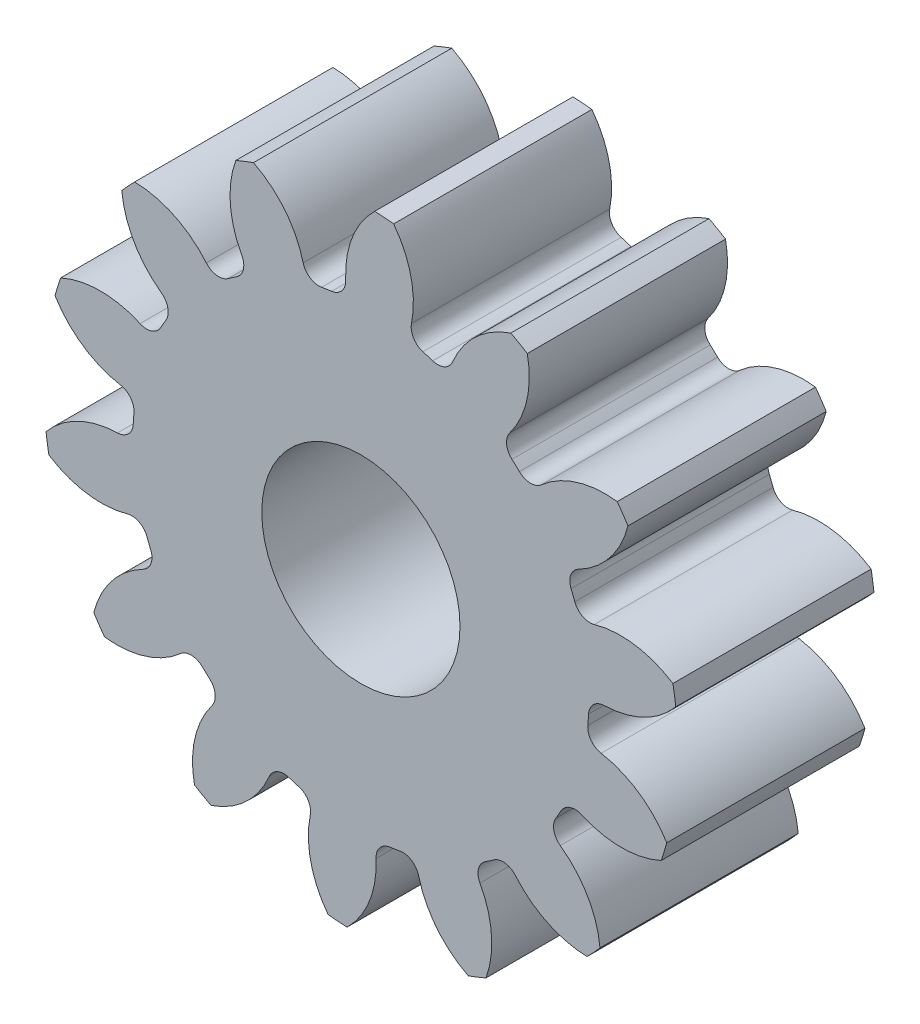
ISO-10303-21;
HEADER;
FILE_DESCRIPTION(('STEP AP214'),'2;1');
FILE_NAME('part.step','',(''),(''),'','','');
FILE_SCHEMA(('AUTOMOTIVE_DESIGN { 1 0 10303 214 1 1 1 1 }'));
ENDSEC;
DATA;
#1=APPLICATION_CONTEXT('core data for automotive mechanical design processes');
#2=APPLICATION_PROTOCOL_DEFINITION('international standard','automotive_design',2000,#1);
#3=PRODUCT_CONTEXT('',#1,'mechanical');
#4=PRODUCT('Part','Part','',(#3));
#5=PRODUCT_RELATED_PRODUCT_CATEGORY('part','',(#4));
#6=PRODUCT_DEFINITION_FORMATION('','',#4);
#7=PRODUCT_DEFINITION_CONTEXT('part definition',#1,'design');
#8=PRODUCT_DEFINITION('design','',#6,#7);
#9=PRODUCT_DEFINITION_SHAPE('','',#8);
#10=(LENGTH_UNIT() NAMED_UNIT(*) SI_UNIT(.MILLI.,.METRE.));
#11=(NAMED_UNIT(*) PLANE_ANGLE_UNIT() SI_UNIT($,.RADIAN.));
#12=(NAMED_UNIT(*) SI_UNIT($,.STERADIAN.) SOLID_ANGLE_UNIT());
#13=UNCERTAINTY_MEASURE_WITH_UNIT(LENGTH_MEASURE(1.E-05),#10,'distance_accuracy_value','');
#14=(GEOMETRIC_REPRESENTATION_CONTEXT(3) GLOBAL_UNCERTAINTY_ASSIGNED_CONTEXT((#13)) GLOBAL_UNIT_ASSIGNED_CONTEXT((#10,
#11,#12)) REPRESENTATION_CONTEXT('',''));
#15=CARTESIAN_POINT('',(0.,0.,0.));
#16=DIRECTION('',(0.,0.,1.));
#17=DIRECTION('',(1.,0.,0.));
#18=AXIS2_PLACEMENT_3D('',#15,#16,#17);
#19=CARTESIAN_POINT('',(0.,0.,101.6));
#20=DIRECTION('',(0.,0.,-1.));
#21=DIRECTION('',(-1.,0.,0.));
#22=AXIS2_PLACEMENT_3D('',#19,#20,#21);
#23=CYLINDRICAL_SURFACE('',#22,162.56);
#24=DIRECTION('',(0.,0.,-1.));
#25=VECTOR('',#24,1.);
#26=CARTESIAN_POINT('',(159.908787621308,29.2392414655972,50.8));
#27=LINE('',#26,#25);
#28=CARTESIAN_POINT('',(159.908787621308,29.2392414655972,101.6));
#29=VERTEX_POINT('',#28);
#30=CARTESIAN_POINT('',(159.908787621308,29.2392414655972,0.));
#31=VERTEX_POINT('',#30);
#32=EDGE_CURVE('E600',#29,#31,#27,.T.);
#33=ORIENTED_EDGE('',*,*,#32,.F.);
#34=CARTESIAN_POINT('',(0.,0.,101.6));
#35=DIRECTION('',(0.,0.,1.));
#36=DIRECTION('',(1.,0.,0.));
#37=AXIS2_PLACEMENT_3D('',#34,#35,#36);
#38=CIRCLE('',#37,162.56);
#39=CARTESIAN_POINT('',(161.374169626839,19.599259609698,101.6));
#40=VERTEX_POINT('',#39);
#41=EDGE_CURVE('E1093',#40,#29,#38,.T.);
#42=ORIENTED_EDGE('',*,*,#41,.F.);
#43=DIRECTION('',(0.,0.,-1.));
#44=VECTOR('',#43,1.);
#45=CARTESIAN_POINT('',(161.374169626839,19.599259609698,50.8));
#46=LINE('',#45,#44);
#47=CARTESIAN_POINT('',(161.374169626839,19.599259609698,0.));
#48=VERTEX_POINT('',#47);
#49=EDGE_CURVE('E1087',#48,#40,#46,.F.);
#50=ORIENTED_EDGE('',*,*,#49,.F.);
#51=CARTESIAN_POINT('',(0.,0.,0.));
#52=DIRECTION('',(0.,0.,1.));
#53=DIRECTION('',(1.,0.,0.));
#54=AXIS2_PLACEMENT_3D('',#51,#52,#53);
#55=CIRCLE('',#54,162.56);
#56=EDGE_CURVE('E1098',#48,#31,#55,.T.);
#57=ORIENTED_EDGE('',*,*,#56,.T.);
#58=EDGE_LOOP('',(#33,#42,#50,#57));
#59=FACE_BOUND('',#58,.T.);
#60=ADVANCED_FACE('F33',(#59),#23,.T.);
#61=DIRECTION('',(0.,0.,-1.));
#62=VECTOR('',#61,1.);
#63=CARTESIAN_POINT('',(136.889302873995,87.6759508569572,50.8));
#64=LINE('',#63,#62);
#65=CARTESIAN_POINT('',(136.889302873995,87.6759508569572,0.));
#66=VERTEX_POINT('',#65);
#67=CARTESIAN_POINT('',(136.889302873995,87.6759508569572,101.6));
#68=VERTEX_POINT('',#67);
#69=EDGE_CURVE('E571',#66,#68,#64,.F.);
#70=ORIENTED_EDGE('',*,*,#69,.F.);
#71=CARTESIAN_POINT('',(131.386407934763,95.7254689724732,0.));
#72=VERTEX_POINT('',#71);
#73=EDGE_CURVE('E1101',#66,#72,#55,.T.);
#74=ORIENTED_EDGE('',*,*,#73,.T.);
#75=DIRECTION('',(0.,0.,-1.));
#76=VECTOR('',#75,1.);
#77=CARTESIAN_POINT('',(131.386407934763,95.7254689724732,50.8));
#78=LINE('',#77,#76);
#79=CARTESIAN_POINT('',(131.386407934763,95.7254689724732,101.6));
#80=VERTEX_POINT('',#79);
#81=EDGE_CURVE('E633',#80,#72,#78,.T.);
#82=ORIENTED_EDGE('',*,*,#81,.F.);
#83=EDGE_CURVE('E1096',#68,#80,#38,.T.);
#84=ORIENTED_EDGE('',*,*,#83,.F.);
#85=EDGE_LOOP('',(#70,#74,#82,#84));
#86=FACE_BOUND('',#85,.T.);
#87=ADVANCED_FACE('F1261',(#86),#23,.T.);
#88=CARTESIAN_POINT('',(0.,0.,101.6));
#89=DIRECTION('',(0.,0.,1.));
#90=DIRECTION('',(1.,0.,0.));
#91=AXIS2_PLACEMENT_3D('',#88,#89,#90);
#92=PLANE('',#91);
#93=CARTESIAN_POINT('',(0.,0.,101.599999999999));
#94=DIRECTION('',(0.,0.,1.));
#95=DIRECTION('',(1.,0.,0.));
#96=AXIS2_PLACEMENT_3D('',#93,#94,#95);
#97=CIRCLE('',#96,50.8);
#98=CARTESIAN_POINT('',(50.8,0.,101.599999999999));
#99=VERTEX_POINT('',#98);
#100=EDGE_CURVE('E588',#99,#99,#97,.T.);
#101=ORIENTED_EDGE('',*,*,#100,.F.);
#102=EDGE_LOOP('',(#101));
#103=FACE_BOUND('',#102,.T.);
#104=ORIENTED_EDGE('',*,*,#41,.T.);
#105=CARTESIAN_POINT('',(133.108989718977,-12.1447350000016,101.6));
#106=DIRECTION('',(0.,0.,-1.));
#107=DIRECTION('',(0.900968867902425,0.433883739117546,0.));
#108=AXIS2_PLACEMENT_3D('',#105,#106,#107);
#109=CIRCLE('',#108,49.3037795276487);
#110=CARTESIAN_POINT('',(119.655544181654,35.2880329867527,101.6));
#111=VERTEX_POINT('',#110);
#112=EDGE_CURVE('E580',#111,#29,#109,.T.);
#113=ORIENTED_EDGE('',*,*,#112,.F.);
#114=CARTESIAN_POINT('',(117.398856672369,43.2444285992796,101.6));
#115=DIRECTION('',(0.,0.,1.));
#116=DIRECTION('',(-0.900968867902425,-0.433883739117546,0.));
#117=AXIS2_PLACEMENT_3D('',#114,#115,#116);
#118=CIRCLE('',#117,8.27023999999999);
#119=CARTESIAN_POINT('',(109.638367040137,40.3858152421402,101.6));
#120=VERTEX_POINT('',#119);
#121=EDGE_CURVE('E578',#120,#111,#118,.T.);
#122=ORIENTED_EDGE('',*,*,#121,.F.);
#123=CARTESIAN_POINT('',(0.,0.,101.6));
#124=DIRECTION('',(0.,0.,-1.));
#125=DIRECTION('',(0.900968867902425,0.433883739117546,0.));
#126=AXIS2_PLACEMENT_3D('',#123,#124,#125);
#127=CIRCLE('',#126,116.84);
#128=CARTESIAN_POINT('',(107.726610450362,45.2389544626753,101.6));
#129=VERTEX_POINT('',#128);
#130=EDGE_CURVE('E563',#129,#120,#127,.T.);
#131=ORIENTED_EDGE('',*,*,#130,.F.);
#132=CARTESIAN_POINT('',(115.351780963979,48.4410856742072,101.6));
#133=DIRECTION('',(0.,0.,1.));
#134=DIRECTION('',(-0.900968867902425,-0.433883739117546,0.));
#135=AXIS2_PLACEMENT_3D('',#132,#133,#134);
#136=CIRCLE('',#135,8.27023999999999);
#137=CARTESIAN_POINT('',(111.575826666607,55.7990092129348,101.6));
#138=VERTEX_POINT('',#137);
#139=EDGE_CURVE('E555',#138,#129,#136,.T.);
#140=ORIENTED_EDGE('',*,*,#139,.F.);
#141=CARTESIAN_POINT('',(89.0651355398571,99.6639321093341,101.6));
#142=DIRECTION('',(0.,0.,-1.));
#143=DIRECTION('',(-0.900968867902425,-0.433883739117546,0.));
#144=AXIS2_PLACEMENT_3D('',#141,#142,#143);
#145=CIRCLE('',#144,49.3037795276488);
#146=EDGE_CURVE('E585',#68,#138,#145,.T.);
#147=ORIENTED_EDGE('',*,*,#146,.F.);
#148=ORIENTED_EDGE('',*,*,#83,.T.);
#149=CARTESIAN_POINT('',(125.196458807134,46.8117980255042,101.6));
#150=DIRECTION('',(0.,0.,-1.));
#151=DIRECTION('',(0.623489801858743,0.781831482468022,0.));
#152=AXIS2_PLACEMENT_3D('',#149,#150,#151);
#153=CIRCLE('',#152,49.3037795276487);
#154=CARTESIAN_POINT('',(92.4950164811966,83.7100140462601,101.6));
#155=VERTEX_POINT('',#154);
#156=EDGE_CURVE('E609',#155,#80,#153,.T.);
#157=ORIENTED_EDGE('',*,*,#156,.F.);
#158=CARTESIAN_POINT('',(87.0096606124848,89.8993387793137,101.6));
#159=DIRECTION('',(0.,0.,1.));
#160=DIRECTION('',(-0.623489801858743,-0.781831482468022,0.));
#161=AXIS2_PLACEMENT_3D('',#158,#159,#160);
#162=CIRCLE('',#161,8.27023999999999);
#163=CARTESIAN_POINT('',(81.2580069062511,83.9566668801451,101.6));
#164=VERTEX_POINT('',#163);
#165=EDGE_CURVE('E607',#164,#155,#162,.T.);
#166=ORIENTED_EDGE('',*,*,#165,.F.);
#167=CARTESIAN_POINT('',(0.,0.,101.6));
#168=DIRECTION('',(0.,0.,-1.));
#169=DIRECTION('',(0.623489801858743,0.781831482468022,0.));
#170=AXIS2_PLACEMENT_3D('',#167,#168,#169);
#171=CIRCLE('',#170,116.84);
#172=CARTESIAN_POINT('',(77.4298755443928,87.4997141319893,101.6));
#173=VERTEX_POINT('',#172);
#174=EDGE_CURVE('E604',#173,#164,#171,.T.);
#175=ORIENTED_EDGE('',*,*,#174,.F.);
#176=CARTESIAN_POINT('',(82.9105641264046,93.6931721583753,101.6));
#177=DIRECTION('',(0.,0.,1.));
#178=DIRECTION('',(-0.623489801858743,-0.781831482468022,0.));
#179=AXIS2_PLACEMENT_3D('',#176,#177,#178);
#180=CIRCLE('',#179,8.27023999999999);
#181=CARTESIAN_POINT('',(76.3160634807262,98.6841070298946,101.6));
#182=VERTEX_POINT('',#181);
#183=EDGE_CURVE('E602',#182,#173,#180,.T.);
#184=ORIENTED_EDGE('',*,*,#183,.F.);
#185=CARTESIAN_POINT('',(37.0023548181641,128.438014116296,101.6));
#186=DIRECTION('',(0.,0.,-1.));
#187=DIRECTION('',(-0.623489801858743,-0.781831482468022,0.));
#188=AXIS2_PLACEMENT_3D('',#185,#186,#187);
#189=CIRCLE('',#188,49.3037795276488);
#190=CARTESIAN_POINT('',(85.291830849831,138.387344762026,101.6));
#191=VERTEX_POINT('',#190);
#192=EDGE_CURVE('E612',#191,#182,#189,.T.);
#193=ORIENTED_EDGE('',*,*,#192,.F.);
#194=CARTESIAN_POINT('',(76.8413388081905,143.252093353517,101.6));
#195=VERTEX_POINT('',#194);
#196=EDGE_CURVE('E1137',#191,#195,#38,.T.);
#197=ORIENTED_EDGE('',*,*,#196,.T.);
#198=CARTESIAN_POINT('',(92.4872337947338,96.4966803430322,101.6));
#199=DIRECTION('',(0.,0.,-1.));
#200=DIRECTION('',(0.222520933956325,0.974927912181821,0.));
#201=AXIS2_PLACEMENT_3D('',#198,#199,#200);
#202=CIRCLE('',#201,49.3037795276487);
#203=CARTESIAN_POINT('',(47.0147163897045,115.552200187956,101.6));
#204=VERTEX_POINT('',#203);
#205=EDGE_CURVE('E644',#204,#195,#202,.T.);
#206=ORIENTED_EDGE('',*,*,#205,.F.);
#207=CARTESIAN_POINT('',(39.3871341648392,118.748582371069,101.6));
#208=DIRECTION('',(0.,0.,1.));
#209=DIRECTION('',(-0.222520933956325,-0.974927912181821,0.));
#210=AXIS2_PLACEMENT_3D('',#207,#208,#209);
#211=CIRCLE('',#210,8.27023999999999);
#212=CARTESIAN_POINT('',(36.7835019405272,110.89887098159,101.6));
#213=VERTEX_POINT('',#212);
#214=EDGE_CURVE('E642',#213,#204,#211,.T.);
#215=ORIENTED_EDGE('',*,*,#214,.F.);
#216=CARTESIAN_POINT('',(0.,0.,101.6));
#217=DIRECTION('',(0.,0.,-1.));
#218=DIRECTION('',(0.222520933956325,0.974927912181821,0.));
#219=AXIS2_PLACEMENT_3D('',#216,#217,#218);
#220=CIRCLE('',#219,116.84);
#221=CARTESIAN_POINT('',(31.7972041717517,112.430082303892,101.6));
#222=VERTEX_POINT('',#221);
#223=EDGE_CURVE('E639',#222,#213,#220,.T.);
#224=ORIENTED_EDGE('',*,*,#223,.F.);
#225=CARTESIAN_POINT('',(34.0478932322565,120.388176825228,101.6));
#226=DIRECTION('',(0.,0.,1.));
#227=DIRECTION('',(-0.222520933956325,-0.974927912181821,0.));
#228=AXIS2_PLACEMENT_3D('',#225,#226,#227);
#229=CIRCLE('',#228,8.27023999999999);
#230=CARTESIAN_POINT('',(25.9409679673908,122.023607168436,101.6));
#231=VERTEX_POINT('',#230);
#232=EDGE_CURVE('E637',#231,#222,#229,.T.);
#233=ORIENTED_EDGE('',*,*,#232,.F.);
#234=CARTESIAN_POINT('',(-22.3891960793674,131.773372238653,101.6));
#235=DIRECTION('',(0.,0.,-1.));
#236=DIRECTION('',(-0.222520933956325,-0.974927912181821,0.));
#237=AXIS2_PLACEMENT_3D('',#234,#235,#236);
#238=CIRCLE('',#237,49.3037795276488);
#239=CARTESIAN_POINT('',(16.8012656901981,161.689427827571,101.6));
#240=VERTEX_POINT('',#239);
#241=EDGE_CURVE('E647',#240,#231,#238,.T.);
#242=ORIENTED_EDGE('',*,*,#241,.F.);
#243=CARTESIAN_POINT('',(7.07690013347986,162.405883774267,101.6));
#244=VERTEX_POINT('',#243);
#245=EDGE_CURVE('E1243',#240,#244,#38,.T.);
#246=ORIENTED_EDGE('',*,*,#245,.T.);
#247=CARTESIAN_POINT('',(41.459777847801,127.069211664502,101.6));
#248=DIRECTION('',(0.,0.,-1.));
#249=DIRECTION('',(-0.222520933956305,0.974927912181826,0.));
#250=AXIS2_PLACEMENT_3D('',#247,#248,#249);
#251=CIRCLE('',#250,49.3037795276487);
#252=CARTESIAN_POINT('',(-7.77742488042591,124.507855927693,101.6));
#253=VERTEX_POINT('',#252);
#254=EDGE_CURVE('E682',#253,#244,#251,.T.);
#255=ORIENTED_EDGE('',*,*,#254,.F.);
#256=CARTESIAN_POINT('',(-16.036497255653,124.078212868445,101.6));
#257=DIRECTION('',(0.,0.,1.));
#258=DIRECTION('',(0.222520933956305,-0.974927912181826,0.));
#259=AXIS2_PLACEMENT_3D('',#256,#257,#258);
#260=CIRCLE('',#259,8.27023999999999);
#261=CARTESIAN_POINT('',(-14.9764267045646,115.876193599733,101.6));
#262=VERTEX_POINT('',#261);
#263=EDGE_CURVE('E680',#262,#253,#260,.T.);
#264=ORIENTED_EDGE('',*,*,#263,.F.);
#265=CARTESIAN_POINT('',(0.,0.,101.6));
#266=DIRECTION('',(0.,0.,-1.));
#267=DIRECTION('',(-0.222520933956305,0.974927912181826,0.));
#268=AXIS2_PLACEMENT_3D('',#265,#266,#267);
#269=CIRCLE('',#268,116.84);
#270=CARTESIAN_POINT('',(-20.1332934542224,115.092293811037,101.6));
#271=VERTEX_POINT('',#270);
#272=EDGE_CURVE('E677',#271,#262,#269,.T.);
#273=ORIENTED_EDGE('',*,*,#272,.F.);
#274=CARTESIAN_POINT('',(-21.5583804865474,123.238826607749,101.6));
#275=DIRECTION('',(0.,0.,1.));
#276=DIRECTION('',(0.222520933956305,-0.974927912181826,0.));
#277=AXIS2_PLACEMENT_3D('',#274,#275,#276);
#278=CIRCLE('',#277,8.27023999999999);
#279=CARTESIAN_POINT('',(-29.57205439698,121.194835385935,101.6));
#280=VERTEX_POINT('',#279);
#281=EDGE_CURVE('E675',#280,#271,#278,.T.);
#282=ORIENTED_EDGE('',*,*,#281,.F.);
#283=CARTESIAN_POINT('',(-77.3462921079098,109.009397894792,101.6));
#284=DIRECTION('',(0.,0.,-1.));
#285=DIRECTION('',(0.222520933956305,-0.974927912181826,0.));
#286=AXIS2_PLACEMENT_3D('',#283,#284,#285);
#287=CIRCLE('',#286,49.3037795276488);
#288=CARTESIAN_POINT('',(-55.0169961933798,152.966936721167,101.6));
#289=VERTEX_POINT('',#288);
#290=EDGE_CURVE('E685',#289,#280,#287,.T.);
#291=ORIENTED_EDGE('',*,*,#290,.F.);
#292=CARTESIAN_POINT('',(-64.0892054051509,149.393197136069,101.6));
#293=VERTEX_POINT('',#292);
#294=EDGE_CURVE('E1239',#289,#293,#38,.T.);
#295=ORIENTED_EDGE('',*,*,#294,.T.);
#296=CARTESIAN_POINT('',(-17.7792955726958,132.474127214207,101.6));
#297=DIRECTION('',(0.,0.,-1.));
#298=DIRECTION('',(-0.623489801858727,0.781831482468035,0.));
#299=AXIS2_PLACEMENT_3D('',#296,#297,#298);
#300=CIRCLE('',#299,49.3037795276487);
#301=CARTESIAN_POINT('',(-61.0291517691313,108.803203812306,101.6));
#302=VERTEX_POINT('',#301);
#303=EDGE_CURVE('E720',#302,#293,#300,.T.);
#304=ORIENTED_EDGE('',*,*,#303,.F.);
#305=CARTESIAN_POINT('',(-68.283903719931,104.832631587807,101.6));
#306=DIRECTION('',(0.,0.,1.));
#307=DIRECTION('',(0.623489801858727,-0.781831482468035,0.));
#308=AXIS2_PLACEMENT_3D('',#305,#306,#307);
#309=CIRCLE('',#308,8.27023999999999);
#310=CARTESIAN_POINT('',(-63.7700903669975,97.9028149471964,101.6));
#311=VERTEX_POINT('',#310);
#312=EDGE_CURVE('E718',#311,#302,#309,.T.);
#313=ORIENTED_EDGE('',*,*,#312,.F.);
#314=CARTESIAN_POINT('',(0.,0.,101.6));
#315=DIRECTION('',(0.,0.,-1.));
#316=DIRECTION('',(-0.623489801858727,0.781831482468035,0.));
#317=AXIS2_PLACEMENT_3D('',#314,#315,#316);
#318=CIRCLE('',#317,116.84);
#319=CARTESIAN_POINT('',(-68.0761453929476,94.9590650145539,101.6));
#320=VERTEX_POINT('',#319);
#321=EDGE_CURVE('E715',#320,#311,#318,.T.);
#322=ORIENTED_EDGE('',*,*,#321,.F.);
#323=CARTESIAN_POINT('',(-72.8947525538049,101.680515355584,101.6));
#324=DIRECTION('',(0.,0.,1.));
#325=DIRECTION('',(0.623489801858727,-0.781831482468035,0.));
#326=AXIS2_PLACEMENT_3D('',#323,#324,#325);
#327=CIRCLE('',#326,8.27023999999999);
#328=CARTESIAN_POINT('',(-79.2279687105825,96.3619400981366,101.6));
#329=VERTEX_POINT('',#328);
#330=EDGE_CURVE('E713',#329,#320,#327,.T.);
#331=ORIENTED_EDGE('',*,*,#330,.F.);
#332=CARTESIAN_POINT('',(-116.984006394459,64.6547753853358,101.6));
#333=DIRECTION('',(0.,0.,-1.));
#334=DIRECTION('',(0.623489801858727,-0.781831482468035,0.));
#335=AXIS2_PLACEMENT_3D('',#332,#333,#334);
#336=CIRCLE('',#335,49.3037795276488);
#337=CARTESIAN_POINT('',(-115.93846724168,113.947467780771,101.6));
#338=VERTEX_POINT('',#337);
#339=EDGE_CURVE('E723',#338,#329,#336,.T.);
#340=ORIENTED_EDGE('',*,*,#339,.F.);
#341=CARTESIAN_POINT('',(-122.561657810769,106.791355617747,101.6));
#342=VERTEX_POINT('',#341);
#343=EDGE_CURVE('E1235',#338,#342,#38,.T.);
#344=ORIENTED_EDGE('',*,*,#343,.T.);
#345=CARTESIAN_POINT('',(-73.4969614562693,111.640917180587,101.6));
#346=DIRECTION('',(0.,0.,-1.));
#347=DIRECTION('',(-0.900968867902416,0.433883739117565,0.));
#348=AXIS2_PLACEMENT_3D('',#345,#346,#347);
#349=CIRCLE('',#348,49.3037795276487);
#350=CARTESIAN_POINT('',(-102.193306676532,71.5487427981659,101.6));
#351=VERTEX_POINT('',#350);
#352=EDGE_CURVE('E758',#351,#342,#349,.T.);
#353=ORIENTED_EDGE('',*,*,#352,.F.);
#354=CARTESIAN_POINT('',(-107.006845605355,64.8236619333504,101.6));
#355=DIRECTION('',(0.,0.,1.));
#356=DIRECTION('',(0.900968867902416,-0.433883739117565,0.));
#357=AXIS2_PLACEMENT_3D('',#354,#355,#356);
#358=CIRCLE('',#357,8.27023999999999);
#359=CARTESIAN_POINT('',(-99.9333055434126,60.538583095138,101.6));
#360=VERTEX_POINT('',#359);
#361=EDGE_CURVE('E756',#360,#351,#358,.T.);
#362=ORIENTED_EDGE('',*,*,#361,.F.);
#363=CARTESIAN_POINT('',(0.,0.,101.6));
#364=DIRECTION('',(0.,0.,-1.));
#365=DIRECTION('',(-0.900968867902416,0.433883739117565,0.));
#366=AXIS2_PLACEMENT_3D('',#363,#364,#365);
#367=CIRCLE('',#366,116.84);
#368=CARTESIAN_POINT('',(-102.535681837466,56.0180287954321,101.6));
#369=VERTEX_POINT('',#368);
#370=EDGE_CURVE('E753',#369,#360,#367,.T.);
#371=ORIENTED_EDGE('',*,*,#370,.F.);
#372=CARTESIAN_POINT('',(-109.79342488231,59.9831310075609,101.6));
#373=DIRECTION('',(0.,0.,1.));
#374=DIRECTION('',(0.900968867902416,-0.433883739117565,0.));
#375=AXIS2_PLACEMENT_3D('',#372,#373,#374);
#376=CIRCLE('',#375,8.27023999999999);
#377=CARTESIAN_POINT('',(-113.191812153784,52.4433807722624,101.6));
#378=VERTEX_POINT('',#377);
#379=EDGE_CURVE('E751',#378,#369,#376,.T.);
#380=ORIENTED_EDGE('',*,*,#379,.F.);
#381=CARTESIAN_POINT('',(-133.451603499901,7.4944816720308,101.6));
#382=DIRECTION('',(0.,0.,-1.));
#383=DIRECTION('',(0.900968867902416,-0.433883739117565,0.));
#384=AXIS2_PLACEMENT_3D('',#381,#382,#383);
#385=CIRCLE('',#384,49.3037795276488);
#386=CARTESIAN_POINT('',(-153.896902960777,52.3593053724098,101.6));
#387=VERTEX_POINT('',#386);
#388=EDGE_CURVE('E761',#387,#378,#385,.T.);
#389=ORIENTED_EDGE('',*,*,#388,.F.);
#390=CARTESIAN_POINT('',(-156.759270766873,43.0381764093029,101.6));
#391=VERTEX_POINT('',#390);
#392=EDGE_CURVE('E1231',#387,#391,#38,.T.);
#393=ORIENTED_EDGE('',*,*,#392,.T.);
#394=CARTESIAN_POINT('',(-114.65765274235,68.6958543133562,101.6));
#395=DIRECTION('',(0.,0.,-1.));
#396=DIRECTION('',(-1.,0.,0.));
#397=AXIS2_PLACEMENT_3D('',#394,#395,#396);
#398=CIRCLE('',#397,49.3037795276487);
#399=CARTESIAN_POINT('',(-123.116823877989,20.1231757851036,101.6));
#400=VERTEX_POINT('',#399);
#401=EDGE_CURVE('E796',#400,#391,#398,.T.);
#402=ORIENTED_EDGE('',*,*,#401,.F.);
#403=CARTESIAN_POINT('',(-124.5357693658,11.975571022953,101.6));
#404=DIRECTION('',(0.,0.,1.));
#405=DIRECTION('',(1.,0.,0.));
#406=AXIS2_PLACEMENT_3D('',#403,#404,#405);
#407=CIRCLE('',#406,8.27023999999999);
#408=CARTESIAN_POINT('',(-116.303503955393,11.1839424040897,101.6));
#409=VERTEX_POINT('',#408);
#410=EDGE_CURVE('E794',#409,#400,#407,.T.);
#411=ORIENTED_EDGE('',*,*,#410,.F.);
#412=CARTESIAN_POINT('',(0.,0.,101.6));
#413=DIRECTION('',(0.,0.,-1.));
#414=DIRECTION('',(-1.,0.,0.));
#415=AXIS2_PLACEMENT_3D('',#412,#413,#414);
#416=CIRCLE('',#415,116.84);
#417=CARTESIAN_POINT('',(-116.686768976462,5.98193495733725,101.6));
#418=VERTEX_POINT('',#417);
#419=EDGE_CURVE('E791',#418,#409,#416,.T.);
#420=ORIENTED_EDGE('',*,*,#419,.F.);
#421=CARTESIAN_POINT('',(-124.946162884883,6.40535191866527,101.6));
#422=DIRECTION('',(0.,0.,1.));
#423=DIRECTION('',(1.,0.,0.));
#424=AXIS2_PLACEMENT_3D('',#421,#422,#423);
#425=CIRCLE('',#424,8.27023999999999);
#426=CARTESIAN_POINT('',(-124.736628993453,-1.86223329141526,101.6));
#427=VERTEX_POINT('',#426);
#428=EDGE_CURVE('E789',#427,#418,#425,.T.);
#429=ORIENTED_EDGE('',*,*,#428,.F.);
#430=CARTESIAN_POINT('',(-123.487473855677,-51.1501860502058,101.6));
#431=DIRECTION('',(0.,0.,-1.));
#432=DIRECTION('',(1.,0.,0.));
#433=AXIS2_PLACEMENT_3D('',#430,#431,#432);
#434=CIRCLE('',#433,49.3037795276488);
#435=CARTESIAN_POINT('',(-161.374169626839,-19.5992596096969,101.6));
#436=VERTEX_POINT('',#435);
#437=EDGE_CURVE('E799',#436,#427,#434,.T.);
#438=ORIENTED_EDGE('',*,*,#437,.F.);
#439=CARTESIAN_POINT('',(-159.908787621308,-29.2392414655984,101.6));
#440=VERTEX_POINT('',#439);
#441=EDGE_CURVE('E1227',#436,#440,#38,.T.);
#442=ORIENTED_EDGE('',*,*,#441,.T.);
#443=CARTESIAN_POINT('',(-133.108989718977,12.1447350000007,101.6));
#444=DIRECTION('',(0.,0.,-1.));
#445=DIRECTION('',(-0.900968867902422,-0.433883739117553,0.));
#446=AXIS2_PLACEMENT_3D('',#443,#444,#445);
#447=CIRCLE('',#446,49.3037795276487);
#448=CARTESIAN_POINT('',(-119.655544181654,-35.2880329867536,101.6));
#449=VERTEX_POINT('',#448);
#450=EDGE_CURVE('E834',#449,#440,#447,.T.);
#451=ORIENTED_EDGE('',*,*,#450,.F.);
#452=CARTESIAN_POINT('',(-117.398856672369,-43.2444285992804,101.6));
#453=DIRECTION('',(0.,0.,1.));
#454=DIRECTION('',(0.900968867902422,0.433883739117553,0.));
#455=AXIS2_PLACEMENT_3D('',#452,#453,#454);
#456=CIRCLE('',#455,8.27023999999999);
#457=CARTESIAN_POINT('',(-109.638367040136,-40.385815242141,101.6));
#458=VERTEX_POINT('',#457);
#459=EDGE_CURVE('E832',#458,#449,#456,.T.);
#460=ORIENTED_EDGE('',*,*,#459,.F.);
#461=CARTESIAN_POINT('',(0.,0.,101.6));
#462=DIRECTION('',(0.,0.,-1.));
#463=DIRECTION('',(-0.900968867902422,-0.433883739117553,0.));
#464=AXIS2_PLACEMENT_3D('',#461,#462,#463);
#465=CIRCLE('',#464,116.84);
#466=CARTESIAN_POINT('',(-107.726610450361,-45.238954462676,101.6));
#467=VERTEX_POINT('',#466);
#468=EDGE_CURVE('E829',#467,#458,#465,.T.);
#469=ORIENTED_EDGE('',*,*,#468,.F.);
#470=CARTESIAN_POINT('',(-115.351780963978,-48.4410856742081,101.6));
#471=DIRECTION('',(0.,0.,1.));
#472=DIRECTION('',(0.900968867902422,0.433883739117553,0.));
#473=AXIS2_PLACEMENT_3D('',#470,#471,#472);
#474=CIRCLE('',#473,8.27023999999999);
#475=CARTESIAN_POINT('',(-111.575826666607,-55.7990092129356,101.6));
#476=VERTEX_POINT('',#475);
#477=EDGE_CURVE('E827',#476,#467,#474,.T.);
#478=ORIENTED_EDGE('',*,*,#477,.F.);
#479=CARTESIAN_POINT('',(-89.0651355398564,-99.6639321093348,101.6));
#480=DIRECTION('',(0.,0.,-1.));
#481=DIRECTION('',(0.900968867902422,0.433883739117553,0.));
#482=AXIS2_PLACEMENT_3D('',#479,#480,#481);
#483=CIRCLE('',#482,49.3037795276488);
#484=CARTESIAN_POINT('',(-136.889302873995,-87.6759508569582,101.6));
#485=VERTEX_POINT('',#484);
#486=EDGE_CURVE('E837',#485,#476,#483,.T.);
#487=ORIENTED_EDGE('',*,*,#486,.F.);
#488=CARTESIAN_POINT('',(-131.386407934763,-95.7254689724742,101.6));
#489=VERTEX_POINT('',#488);
#490=EDGE_CURVE('E1223',#485,#489,#38,.T.);
#491=ORIENTED_EDGE('',*,*,#490,.T.);
#492=CARTESIAN_POINT('',(-125.196458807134,-46.8117980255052,101.6));
#493=DIRECTION('',(0.,0.,-1.));
#494=DIRECTION('',(-0.623489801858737,-0.781831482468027,0.));
#495=AXIS2_PLACEMENT_3D('',#492,#493,#494);
#496=CIRCLE('',#495,49.3037795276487);
#497=CARTESIAN_POINT('',(-92.495016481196,-83.7100140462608,101.6));
#498=VERTEX_POINT('',#497);
#499=EDGE_CURVE('E872',#498,#489,#496,.T.);
#500=ORIENTED_EDGE('',*,*,#499,.F.);
#501=CARTESIAN_POINT('',(-87.0096606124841,-89.8993387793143,101.6));
#502=DIRECTION('',(0.,0.,1.));
#503=DIRECTION('',(0.623489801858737,0.781831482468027,0.));
#504=AXIS2_PLACEMENT_3D('',#501,#502,#503);
#505=CIRCLE('',#504,8.27023999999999);
#506=CARTESIAN_POINT('',(-81.2580069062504,-83.9566668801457,101.6));
#507=VERTEX_POINT('',#506);
#508=EDGE_CURVE('E870',#507,#498,#505,.T.);
#509=ORIENTED_EDGE('',*,*,#508,.F.);
#510=CARTESIAN_POINT('',(0.,0.,101.6));
#511=DIRECTION('',(0.,0.,-1.));
#512=DIRECTION('',(-0.623489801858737,-0.781831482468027,0.));
#513=AXIS2_PLACEMENT_3D('',#510,#511,#512);
#514=CIRCLE('',#513,116.84);
#515=CARTESIAN_POINT('',(-77.4298755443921,-87.4997141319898,101.6));
#516=VERTEX_POINT('',#515);
#517=EDGE_CURVE('E867',#516,#507,#514,.T.);
#518=ORIENTED_EDGE('',*,*,#517,.F.);
#519=CARTESIAN_POINT('',(-82.9105641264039,-93.6931721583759,101.6));
#520=DIRECTION('',(0.,0.,1.));
#521=DIRECTION('',(0.623489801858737,0.781831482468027,0.));
#522=AXIS2_PLACEMENT_3D('',#519,#520,#521);
#523=CIRCLE('',#522,8.27023999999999);
#524=CARTESIAN_POINT('',(-76.3160634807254,-98.6841070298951,101.6));
#525=VERTEX_POINT('',#524);
#526=EDGE_CURVE('E865',#525,#516,#523,.T.);
#527=ORIENTED_EDGE('',*,*,#526,.F.);
#528=CARTESIAN_POINT('',(-37.0023548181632,-128.438014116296,101.6));
#529=DIRECTION('',(0.,0.,-1.));
#530=DIRECTION('',(0.623489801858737,0.781831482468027,0.));
#531=AXIS2_PLACEMENT_3D('',#528,#529,#530);
#532=CIRCLE('',#531,49.3037795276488);
#533=CARTESIAN_POINT('',(-85.29183084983,-138.387344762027,101.6));
#534=VERTEX_POINT('',#533);
#535=EDGE_CURVE('E875',#534,#525,#532,.T.);
#536=ORIENTED_EDGE('',*,*,#535,.F.);
#537=CARTESIAN_POINT('',(-76.8413388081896,-143.252093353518,101.6));
#538=VERTEX_POINT('',#537);
#539=EDGE_CURVE('E1219',#534,#538,#38,.T.);
#540=ORIENTED_EDGE('',*,*,#539,.T.);
#541=CARTESIAN_POINT('',(-92.4872337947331,-96.4966803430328,101.6));
#542=DIRECTION('',(0.,0.,-1.));
#543=DIRECTION('',(-0.222520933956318,-0.974927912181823,0.));
#544=AXIS2_PLACEMENT_3D('',#541,#542,#543);
#545=CIRCLE('',#544,49.3037795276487);
#546=CARTESIAN_POINT('',(-47.0147163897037,-115.552200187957,101.6));
#547=VERTEX_POINT('',#546);
#548=EDGE_CURVE('E910',#547,#538,#545,.T.);
#549=ORIENTED_EDGE('',*,*,#548,.F.);
#550=CARTESIAN_POINT('',(-39.3871341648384,-118.748582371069,101.6));
#551=DIRECTION('',(0.,0.,1.));
#552=DIRECTION('',(0.222520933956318,0.974927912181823,0.));
#553=AXIS2_PLACEMENT_3D('',#550,#551,#552);
#554=CIRCLE('',#553,8.27023999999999);
#555=CARTESIAN_POINT('',(-36.7835019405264,-110.89887098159,101.6));
#556=VERTEX_POINT('',#555);
#557=EDGE_CURVE('E908',#556,#547,#554,.T.);
#558=ORIENTED_EDGE('',*,*,#557,.F.);
#559=CARTESIAN_POINT('',(0.,0.,101.6));
#560=DIRECTION('',(0.,0.,-1.));
#561=DIRECTION('',(-0.222520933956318,-0.974927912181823,0.));
#562=AXIS2_PLACEMENT_3D('',#559,#560,#561);
#563=CIRCLE('',#562,116.84);
#564=CARTESIAN_POINT('',(-31.7972041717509,-112.430082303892,101.6));
#565=VERTEX_POINT('',#564);
#566=EDGE_CURVE('E905',#565,#556,#563,.T.);
#567=ORIENTED_EDGE('',*,*,#566,.F.);
#568=CARTESIAN_POINT('',(-34.0478932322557,-120.388176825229,101.6));
#569=DIRECTION('',(0.,0.,1.));
#570=DIRECTION('',(0.222520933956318,0.974927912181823,0.));
#571=AXIS2_PLACEMENT_3D('',#568,#569,#570);
#572=CIRCLE('',#571,8.27023999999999);
#573=CARTESIAN_POINT('',(-25.94096796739,-122.023607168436,101.6));
#574=VERTEX_POINT('',#573);
#575=EDGE_CURVE('E903',#574,#565,#572,.T.);
#576=ORIENTED_EDGE('',*,*,#575,.F.);
#577=CARTESIAN_POINT('',(22.3891960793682,-131.773372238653,101.6));
#578=DIRECTION('',(0.,0.,-1.));
#579=DIRECTION('',(0.222520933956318,0.974927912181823,0.));
#580=AXIS2_PLACEMENT_3D('',#577,#578,#579);
#581=CIRCLE('',#580,49.3037795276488);
#582=CARTESIAN_POINT('',(-16.8012656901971,-161.689427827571,101.6));
#583=VERTEX_POINT('',#582);
#584=EDGE_CURVE('E913',#583,#574,#581,.T.);
#585=ORIENTED_EDGE('',*,*,#584,.F.);
#586=CARTESIAN_POINT('',(-7.07690013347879,-162.405883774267,101.6));
#587=VERTEX_POINT('',#586);
#588=EDGE_CURVE('E1215',#583,#587,#38,.T.);
#589=ORIENTED_EDGE('',*,*,#588,.T.);
#590=CARTESIAN_POINT('',(-41.4597778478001,-127.069211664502,101.6));
#591=DIRECTION('',(0.,0.,-1.));
#592=DIRECTION('',(0.222520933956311,-0.974927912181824,0.));
#593=AXIS2_PLACEMENT_3D('',#590,#591,#592);
#594=CIRCLE('',#593,49.3037795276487);
#595=CARTESIAN_POINT('',(7.77742488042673,-124.507855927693,101.6));
#596=VERTEX_POINT('',#595);
#597=EDGE_CURVE('E948',#596,#587,#594,.T.);
#598=ORIENTED_EDGE('',*,*,#597,.F.);
#599=CARTESIAN_POINT('',(16.0364972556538,-124.078212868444,101.6));
#600=DIRECTION('',(0.,0.,1.));
#601=DIRECTION('',(-0.222520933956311,0.974927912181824,0.));
#602=AXIS2_PLACEMENT_3D('',#599,#600,#601);
#603=CIRCLE('',#602,8.27023999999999);
#604=CARTESIAN_POINT('',(14.9764267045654,-115.876193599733,101.6));
#605=VERTEX_POINT('',#604);
#606=EDGE_CURVE('E946',#605,#596,#603,.T.);
#607=ORIENTED_EDGE('',*,*,#606,.F.);
#608=CARTESIAN_POINT('',(0.,0.,101.6));
#609=DIRECTION('',(0.,0.,-1.));
#610=DIRECTION('',(0.222520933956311,-0.974927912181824,0.));
#611=AXIS2_PLACEMENT_3D('',#608,#609,#610);
#612=CIRCLE('',#611,116.84);
#613=CARTESIAN_POINT('',(20.1332934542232,-115.092293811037,101.6));
#614=VERTEX_POINT('',#613);
#615=EDGE_CURVE('E943',#614,#605,#612,.T.);
#616=ORIENTED_EDGE('',*,*,#615,.F.);
#617=CARTESIAN_POINT('',(21.5583804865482,-123.238826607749,101.6));
#618=DIRECTION('',(0.,0.,1.));
#619=DIRECTION('',(-0.222520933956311,0.974927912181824,0.));
#620=AXIS2_PLACEMENT_3D('',#617,#618,#619);
#621=CIRCLE('',#620,8.27023999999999);
#622=CARTESIAN_POINT('',(29.5720543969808,-121.194835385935,101.6));
#623=VERTEX_POINT('',#622);
#624=EDGE_CURVE('E941',#623,#614,#621,.T.);
#625=ORIENTED_EDGE('',*,*,#624,.F.);
#626=CARTESIAN_POINT('',(77.3462921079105,-109.009397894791,101.6));
#627=DIRECTION('',(0.,0.,-1.));
#628=DIRECTION('',(-0.222520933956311,0.974927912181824,0.));
#629=AXIS2_PLACEMENT_3D('',#626,#627,#628);
#630=CIRCLE('',#629,49.3037795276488);
#631=CARTESIAN_POINT('',(55.0169961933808,-152.966936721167,101.6));
#632=VERTEX_POINT('',#631);
#633=EDGE_CURVE('E951',#632,#623,#630,.T.);
#634=ORIENTED_EDGE('',*,*,#633,.F.);
#635=CARTESIAN_POINT('',(64.0892054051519,-149.393197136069,101.6));
#636=VERTEX_POINT('',#635);
#637=EDGE_CURVE('E1211',#632,#636,#38,.T.);
#638=ORIENTED_EDGE('',*,*,#637,.T.);
#639=CARTESIAN_POINT('',(17.7792955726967,-132.474127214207,101.6));
#640=DIRECTION('',(0.,0.,-1.));
#641=DIRECTION('',(0.623489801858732,-0.781831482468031,0.));
#642=AXIS2_PLACEMENT_3D('',#639,#640,#641);
#643=CIRCLE('',#642,49.3037795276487);
#644=CARTESIAN_POINT('',(61.0291517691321,-108.803203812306,101.6));
#645=VERTEX_POINT('',#644);
#646=EDGE_CURVE('E986',#645,#636,#643,.T.);
#647=ORIENTED_EDGE('',*,*,#646,.F.);
#648=CARTESIAN_POINT('',(68.2839037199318,-104.832631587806,101.6));
#649=DIRECTION('',(0.,0.,1.));
#650=DIRECTION('',(-0.623489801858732,0.781831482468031,0.));
#651=AXIS2_PLACEMENT_3D('',#648,#649,#650);
#652=CIRCLE('',#651,8.27023999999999);
#653=CARTESIAN_POINT('',(63.7700903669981,-97.9028149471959,101.6));
#654=VERTEX_POINT('',#653);
#655=EDGE_CURVE('E984',#654,#645,#652,.T.);
#656=ORIENTED_EDGE('',*,*,#655,.F.);
#657=CARTESIAN_POINT('',(0.,0.,101.6));
#658=DIRECTION('',(0.,0.,-1.));
#659=DIRECTION('',(0.623489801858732,-0.781831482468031,0.));
#660=AXIS2_PLACEMENT_3D('',#657,#658,#659);
#661=CIRCLE('',#660,116.84);
#662=CARTESIAN_POINT('',(68.0761453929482,-94.9590650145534,101.6));
#663=VERTEX_POINT('',#662);
#664=EDGE_CURVE('E981',#663,#654,#661,.T.);
#665=ORIENTED_EDGE('',*,*,#664,.F.);
#666=CARTESIAN_POINT('',(72.8947525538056,-101.680515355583,101.6));
#667=DIRECTION('',(0.,0.,1.));
#668=DIRECTION('',(-0.623489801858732,0.781831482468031,0.));
#669=AXIS2_PLACEMENT_3D('',#666,#667,#668);
#670=CIRCLE('',#669,8.27023999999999);
#671=CARTESIAN_POINT('',(79.2279687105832,-96.3619400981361,101.6));
#672=VERTEX_POINT('',#671);
#673=EDGE_CURVE('E979',#672,#663,#670,.T.);
#674=ORIENTED_EDGE('',*,*,#673,.F.);
#675=CARTESIAN_POINT('',(116.98400639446,-64.654775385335,101.6));
#676=DIRECTION('',(0.,0.,-1.));
#677=DIRECTION('',(-0.623489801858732,0.781831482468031,0.));
#678=AXIS2_PLACEMENT_3D('',#675,#676,#677);
#679=CIRCLE('',#678,49.3037795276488);
#680=CARTESIAN_POINT('',(115.938467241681,-113.94746778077,101.6));
#681=VERTEX_POINT('',#680);
#682=EDGE_CURVE('E989',#681,#672,#679,.T.);
#683=ORIENTED_EDGE('',*,*,#682,.F.);
#684=CARTESIAN_POINT('',(122.561657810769,-106.791355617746,101.6));
#685=VERTEX_POINT('',#684);
#686=EDGE_CURVE('E1210',#681,#685,#38,.T.);
#687=ORIENTED_EDGE('',*,*,#686,.T.);
#688=CARTESIAN_POINT('',(73.4969614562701,-111.640917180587,101.6));
#689=DIRECTION('',(0.,0.,-1.));
#690=DIRECTION('',(0.900968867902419,-0.433883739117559,0.));
#691=AXIS2_PLACEMENT_3D('',#688,#689,#690);
#692=CIRCLE('',#691,49.3037795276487);
#693=CARTESIAN_POINT('',(102.193306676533,-71.5487427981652,101.6));
#694=VERTEX_POINT('',#693);
#695=EDGE_CURVE('E1024',#694,#685,#692,.T.);
#696=ORIENTED_EDGE('',*,*,#695,.F.);
#697=CARTESIAN_POINT('',(107.006845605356,-64.8236619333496,101.6));
#698=DIRECTION('',(0.,0.,1.));
#699=DIRECTION('',(-0.900968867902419,0.433883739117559,0.));
#700=AXIS2_PLACEMENT_3D('',#697,#698,#699);
#701=CIRCLE('',#700,8.27023999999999);
#702=CARTESIAN_POINT('',(99.933305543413,-60.5385830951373,101.6));
#703=VERTEX_POINT('',#702);
#704=EDGE_CURVE('E1022',#703,#694,#701,.T.);
#705=ORIENTED_EDGE('',*,*,#704,.F.);
#706=CARTESIAN_POINT('',(0.,0.,101.6));
#707=DIRECTION('',(0.,0.,-1.));
#708=DIRECTION('',(0.900968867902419,-0.433883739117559,0.));
#709=AXIS2_PLACEMENT_3D('',#706,#707,#708);
#710=CIRCLE('',#709,116.84);
#711=CARTESIAN_POINT('',(102.535681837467,-56.0180287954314,101.6));
#712=VERTEX_POINT('',#711);
#713=EDGE_CURVE('E1019',#712,#703,#710,.T.);
#714=ORIENTED_EDGE('',*,*,#713,.F.);
#715=CARTESIAN_POINT('',(109.79342488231,-59.9831310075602,101.6));
#716=DIRECTION('',(0.,0.,1.));
#717=DIRECTION('',(-0.900968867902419,0.433883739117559,0.));
#718=AXIS2_PLACEMENT_3D('',#715,#716,#717);
#719=CIRCLE('',#718,8.27023999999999);
#720=CARTESIAN_POINT('',(113.191812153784,-52.4433807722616,101.6));
#721=VERTEX_POINT('',#720);
#722=EDGE_CURVE('E1017',#721,#712,#719,.T.);
#723=ORIENTED_EDGE('',*,*,#722,.F.);
#724=CARTESIAN_POINT('',(133.451603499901,-7.49448167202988,101.6));
#725=DIRECTION('',(0.,0.,-1.));
#726=DIRECTION('',(-0.900968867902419,0.433883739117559,0.));
#727=AXIS2_PLACEMENT_3D('',#724,#725,#726);
#728=CIRCLE('',#727,49.3037795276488);
#729=CARTESIAN_POINT('',(153.896902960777,-52.3593053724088,101.6));
#730=VERTEX_POINT('',#729);
#731=EDGE_CURVE('E1027',#730,#721,#728,.T.);
#732=ORIENTED_EDGE('',*,*,#731,.F.);
#733=CARTESIAN_POINT('',(156.759270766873,-43.0381764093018,101.6));
#734=VERTEX_POINT('',#733);
#735=EDGE_CURVE('E1097',#730,#734,#38,.T.);
#736=ORIENTED_EDGE('',*,*,#735,.T.);
#737=CARTESIAN_POINT('',(114.65765274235,-68.6958543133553,101.6));
#738=DIRECTION('',(0.,0.,-1.));
#739=DIRECTION('',(1.,0.,0.));
#740=AXIS2_PLACEMENT_3D('',#737,#738,#739);
#741=CIRCLE('',#740,49.3037795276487);
#742=CARTESIAN_POINT('',(123.116823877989,-20.1231757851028,101.6));
#743=VERTEX_POINT('',#742);
#744=EDGE_CURVE('E1062',#743,#734,#741,.T.);
#745=ORIENTED_EDGE('',*,*,#744,.F.);
#746=CARTESIAN_POINT('',(124.5357693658,-11.9755710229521,101.6));
#747=DIRECTION('',(0.,0.,1.));
#748=DIRECTION('',(-1.,0.,0.));
#749=AXIS2_PLACEMENT_3D('',#746,#747,#748);
#750=CIRCLE('',#749,8.27023999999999);
#751=CARTESIAN_POINT('',(116.303503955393,-11.1839424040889,101.6));
#752=VERTEX_POINT('',#751);
#753=EDGE_CURVE('E1060',#752,#743,#750,.T.);
#754=ORIENTED_EDGE('',*,*,#753,.F.);
#755=CARTESIAN_POINT('',(0.,0.,101.6));
#756=DIRECTION('',(0.,0.,-1.));
#757=DIRECTION('',(1.,0.,0.));
#758=AXIS2_PLACEMENT_3D('',#755,#756,#757);
#759=CIRCLE('',#758,116.84);
#760=CARTESIAN_POINT('',(116.686768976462,-5.98193495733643,101.6));
#761=VERTEX_POINT('',#760);
#762=EDGE_CURVE('E1057',#761,#752,#759,.T.);
#763=ORIENTED_EDGE('',*,*,#762,.F.);
#764=CARTESIAN_POINT('',(124.946162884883,-6.4053519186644,101.6));
#765=DIRECTION('',(0.,0.,1.));
#766=DIRECTION('',(-1.,0.,0.));
#767=AXIS2_PLACEMENT_3D('',#764,#765,#766);
#768=CIRCLE('',#767,8.27023999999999);
#769=CARTESIAN_POINT('',(124.736628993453,1.86223329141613,101.6));
#770=VERTEX_POINT('',#769);
#771=EDGE_CURVE('E1055',#770,#761,#768,.T.);
#772=ORIENTED_EDGE('',*,*,#771,.F.);
#773=CARTESIAN_POINT('',(123.487473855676,51.1501860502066,101.6));
#774=DIRECTION('',(0.,0.,-1.));
#775=DIRECTION('',(-1.,0.,0.));
#776=AXIS2_PLACEMENT_3D('',#773,#774,#775);
#777=CIRCLE('',#776,49.3037795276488);
#778=EDGE_CURVE('E1065',#40,#770,#777,.T.);
#779=ORIENTED_EDGE('',*,*,#778,.F.);
#780=EDGE_LOOP('',(#104,#113,#122,#131,#140,#147,#148,#157,#166,#175,#184,#193,#197,#206,#215,
#224,#233,#242,#246,#255,#264,#273,#282,#291,#295,#304,#313,#322,#331,#340,#344,#353,#362,#371,
#380,#389,#393,#402,#411,#420,#429,#438,#442,#451,#460,#469,#478,#487,#491,#500,#509,#518,#527,
#536,#540,#549,#558,#567,#576,#585,#589,#598,#607,#616,#625,#634,#638,#647,#656,#665,#674,#683,
#687,#696,#705,#714,#723,#732,#736,#745,#754,#763,#772,#779));
#781=FACE_BOUND('',#780,.T.);
#782=ADVANCED_FACE('F576',(#103,#781),#92,.T.);
#783=CARTESIAN_POINT('',(0.,0.,0.));
#784=DIRECTION('',(0.,0.,1.));
#785=DIRECTION('',(1.,0.,0.));
#786=AXIS2_PLACEMENT_3D('',#783,#784,#785);
#787=PLANE('',#786);
#788=CARTESIAN_POINT('',(0.,0.,0.));
#789=DIRECTION('',(0.,0.,1.));
#790=DIRECTION('',(1.,0.,0.));
#791=AXIS2_PLACEMENT_3D('',#788,#789,#790);
#792=CIRCLE('',#791,50.8);
#793=CARTESIAN_POINT('',(50.8,0.,-1.77635683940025E-12));
#794=VERTEX_POINT('',#793);
#795=EDGE_CURVE('E36',#794,#794,#792,.T.);
#796=ORIENTED_EDGE('',*,*,#795,.T.);
#797=EDGE_LOOP('',(#796));
#798=FACE_BOUND('',#797,.T.);
#799=CARTESIAN_POINT('',(133.108989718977,-12.1447350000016,0.));
#800=DIRECTION('',(0.,0.,-1.));
#801=DIRECTION('',(0.900968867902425,0.433883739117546,0.));
#802=AXIS2_PLACEMENT_3D('',#799,#800,#801);
#803=CIRCLE('',#802,49.3037795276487);
#804=CARTESIAN_POINT('',(119.655544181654,35.2880329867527,0.));
#805=VERTEX_POINT('',#804);
#806=EDGE_CURVE('E564',#805,#31,#803,.T.);
#807=ORIENTED_EDGE('',*,*,#806,.T.);
#808=ORIENTED_EDGE('',*,*,#56,.F.);
#809=CARTESIAN_POINT('',(123.487473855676,51.1501860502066,0.));
#810=DIRECTION('',(0.,0.,1.));
#811=DIRECTION('',(1.,0.,0.));
#812=AXIS2_PLACEMENT_3D('',#809,#810,#811);
#813=CIRCLE('',#812,49.3037795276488);
#814=CARTESIAN_POINT('',(124.736628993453,1.86223329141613,0.));
#815=VERTEX_POINT('',#814);
#816=EDGE_CURVE('E1095',#815,#48,#813,.T.);
#817=ORIENTED_EDGE('',*,*,#816,.F.);
#818=CARTESIAN_POINT('',(124.946162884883,-6.4053519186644,0.));
#819=DIRECTION('',(0.,0.,1.));
#820=DIRECTION('',(-1.,0.,0.));
#821=AXIS2_PLACEMENT_3D('',#818,#819,#820);
#822=CIRCLE('',#821,8.27023999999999);
#823=CARTESIAN_POINT('',(116.686768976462,-5.98193495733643,0.));
#824=VERTEX_POINT('',#823);
#825=EDGE_CURVE('E1054',#815,#824,#822,.T.);
#826=ORIENTED_EDGE('',*,*,#825,.T.);
#827=CARTESIAN_POINT('',(0.,0.,0.));
#828=DIRECTION('',(0.,0.,-1.));
#829=DIRECTION('',(1.,0.,0.));
#830=AXIS2_PLACEMENT_3D('',#827,#828,#829);
#831=CIRCLE('',#830,116.84);
#832=CARTESIAN_POINT('',(116.303503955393,-11.1839424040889,0.));
#833=VERTEX_POINT('',#832);
#834=EDGE_CURVE('E1070',#824,#833,#831,.T.);
#835=ORIENTED_EDGE('',*,*,#834,.T.);
#836=CARTESIAN_POINT('',(124.5357693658,-11.9755710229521,0.));
#837=DIRECTION('',(0.,0.,1.));
#838=DIRECTION('',(-1.,0.,0.));
#839=AXIS2_PLACEMENT_3D('',#836,#837,#838);
#840=CIRCLE('',#839,8.27023999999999);
#841=CARTESIAN_POINT('',(123.116823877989,-20.1231757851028,0.));
#842=VERTEX_POINT('',#841);
#843=EDGE_CURVE('E1073',#833,#842,#840,.T.);
#844=ORIENTED_EDGE('',*,*,#843,.T.);
#845=CARTESIAN_POINT('',(114.65765274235,-68.6958543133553,0.));
#846=DIRECTION('',(0.,0.,-1.));
#847=DIRECTION('',(1.,0.,0.));
#848=AXIS2_PLACEMENT_3D('',#845,#846,#847);
#849=CIRCLE('',#848,49.3037795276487);
#850=CARTESIAN_POINT('',(156.759270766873,-43.0381764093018,0.));
#851=VERTEX_POINT('',#850);
#852=EDGE_CURVE('E1058',#842,#851,#849,.T.);
#853=ORIENTED_EDGE('',*,*,#852,.T.);
#854=CARTESIAN_POINT('',(153.896902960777,-52.3593053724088,0.));
#855=VERTEX_POINT('',#854);
#856=EDGE_CURVE('E1092',#855,#851,#55,.T.);
#857=ORIENTED_EDGE('',*,*,#856,.F.);
#858=CARTESIAN_POINT('',(133.451603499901,-7.49448167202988,0.));
#859=DIRECTION('',(0.,0.,1.));
#860=DIRECTION('',(1.,0.,0.));
#861=AXIS2_PLACEMENT_3D('',#858,#859,#860);
#862=CIRCLE('',#861,49.3037795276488);
#863=CARTESIAN_POINT('',(113.191812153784,-52.4433807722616,0.));
#864=VERTEX_POINT('',#863);
#865=EDGE_CURVE('E1103',#864,#855,#862,.T.);
#866=ORIENTED_EDGE('',*,*,#865,.F.);
#867=CARTESIAN_POINT('',(109.79342488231,-59.9831310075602,0.));
#868=DIRECTION('',(0.,0.,1.));
#869=DIRECTION('',(-0.900968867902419,0.433883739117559,0.));
#870=AXIS2_PLACEMENT_3D('',#867,#868,#869);
#871=CIRCLE('',#870,8.27023999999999);
#872=CARTESIAN_POINT('',(102.535681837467,-56.0180287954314,0.));
#873=VERTEX_POINT('',#872);
#874=EDGE_CURVE('E1016',#864,#873,#871,.T.);
#875=ORIENTED_EDGE('',*,*,#874,.T.);
#876=CARTESIAN_POINT('',(0.,0.,0.));
#877=DIRECTION('',(0.,0.,-1.));
#878=DIRECTION('',(0.900968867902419,-0.433883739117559,0.));
#879=AXIS2_PLACEMENT_3D('',#876,#877,#878);
#880=CIRCLE('',#879,116.84);
#881=CARTESIAN_POINT('',(99.933305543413,-60.5385830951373,0.));
#882=VERTEX_POINT('',#881);
#883=EDGE_CURVE('E1032',#873,#882,#880,.T.);
#884=ORIENTED_EDGE('',*,*,#883,.T.);
#885=CARTESIAN_POINT('',(107.006845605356,-64.8236619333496,0.));
#886=DIRECTION('',(0.,0.,1.));
#887=DIRECTION('',(-0.900968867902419,0.433883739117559,0.));
#888=AXIS2_PLACEMENT_3D('',#885,#886,#887);
#889=CIRCLE('',#888,8.27023999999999);
#890=CARTESIAN_POINT('',(102.193306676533,-71.5487427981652,0.));
#891=VERTEX_POINT('',#890);
#892=EDGE_CURVE('E1035',#882,#891,#889,.T.);
#893=ORIENTED_EDGE('',*,*,#892,.T.);
#894=CARTESIAN_POINT('',(73.4969614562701,-111.640917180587,0.));
#895=DIRECTION('',(0.,0.,-1.));
#896=DIRECTION('',(0.900968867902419,-0.433883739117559,0.));
#897=AXIS2_PLACEMENT_3D('',#894,#895,#896);
#898=CIRCLE('',#897,49.3037795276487);
#899=CARTESIAN_POINT('',(122.561657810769,-106.791355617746,0.));
#900=VERTEX_POINT('',#899);
#901=EDGE_CURVE('E1020',#891,#900,#898,.T.);
#902=ORIENTED_EDGE('',*,*,#901,.T.);
#903=CARTESIAN_POINT('',(115.938467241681,-113.94746778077,0.));
#904=VERTEX_POINT('',#903);
#905=EDGE_CURVE('E1181',#904,#900,#55,.T.);
#906=ORIENTED_EDGE('',*,*,#905,.F.);
#907=CARTESIAN_POINT('',(116.98400639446,-64.654775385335,0.));
#908=DIRECTION('',(0.,0.,1.));
#909=DIRECTION('',(1.,0.,0.));
#910=AXIS2_PLACEMENT_3D('',#907,#908,#909);
#911=CIRCLE('',#910,49.3037795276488);
#912=CARTESIAN_POINT('',(79.2279687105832,-96.3619400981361,0.));
#913=VERTEX_POINT('',#912);
#914=EDGE_CURVE('E1105',#913,#904,#911,.T.);
#915=ORIENTED_EDGE('',*,*,#914,.F.);
#916=CARTESIAN_POINT('',(72.8947525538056,-101.680515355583,0.));
#917=DIRECTION('',(0.,0.,1.));
#918=DIRECTION('',(-0.623489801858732,0.781831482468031,0.));
#919=AXIS2_PLACEMENT_3D('',#916,#917,#918);
#920=CIRCLE('',#919,8.27023999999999);
#921=CARTESIAN_POINT('',(68.0761453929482,-94.9590650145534,0.));
#922=VERTEX_POINT('',#921);
#923=EDGE_CURVE('E978',#913,#922,#920,.T.);
#924=ORIENTED_EDGE('',*,*,#923,.T.);
#925=CARTESIAN_POINT('',(0.,0.,0.));
#926=DIRECTION('',(0.,0.,-1.));
#927=DIRECTION('',(0.623489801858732,-0.781831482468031,0.));
#928=AXIS2_PLACEMENT_3D('',#925,#926,#927);
#929=CIRCLE('',#928,116.84);
#930=CARTESIAN_POINT('',(63.7700903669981,-97.9028149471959,0.));
#931=VERTEX_POINT('',#930);
#932=EDGE_CURVE('E994',#922,#931,#929,.T.);
#933=ORIENTED_EDGE('',*,*,#932,.T.);
#934=CARTESIAN_POINT('',(68.2839037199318,-104.832631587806,0.));
#935=DIRECTION('',(0.,0.,1.));
#936=DIRECTION('',(-0.623489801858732,0.781831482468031,0.));
#937=AXIS2_PLACEMENT_3D('',#934,#935,#936);
#938=CIRCLE('',#937,8.27023999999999);
#939=CARTESIAN_POINT('',(61.0291517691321,-108.803203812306,0.));
#940=VERTEX_POINT('',#939);
#941=EDGE_CURVE('E997',#931,#940,#938,.T.);
#942=ORIENTED_EDGE('',*,*,#941,.T.);
#943=CARTESIAN_POINT('',(17.7792955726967,-132.474127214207,0.));
#944=DIRECTION('',(0.,0.,-1.));
#945=DIRECTION('',(0.623489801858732,-0.781831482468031,0.));
#946=AXIS2_PLACEMENT_3D('',#943,#944,#945);
#947=CIRCLE('',#946,49.3037795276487);
#948=CARTESIAN_POINT('',(64.0892054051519,-149.393197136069,0.));
#949=VERTEX_POINT('',#948);
#950=EDGE_CURVE('E982',#940,#949,#947,.T.);
#951=ORIENTED_EDGE('',*,*,#950,.T.);
#952=CARTESIAN_POINT('',(55.0169961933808,-152.966936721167,0.));
#953=VERTEX_POINT('',#952);
#954=EDGE_CURVE('E1176',#953,#949,#55,.T.);
#955=ORIENTED_EDGE('',*,*,#954,.F.);
#956=CARTESIAN_POINT('',(77.3462921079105,-109.009397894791,0.));
#957=DIRECTION('',(0.,0.,1.));
#958=DIRECTION('',(1.,0.,0.));
#959=AXIS2_PLACEMENT_3D('',#956,#957,#958);
#960=CIRCLE('',#959,49.3037795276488);
#961=CARTESIAN_POINT('',(29.5720543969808,-121.194835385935,0.));
#962=VERTEX_POINT('',#961);
#963=EDGE_CURVE('E1107',#962,#953,#960,.T.);
#964=ORIENTED_EDGE('',*,*,#963,.F.);
#965=CARTESIAN_POINT('',(21.5583804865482,-123.238826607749,0.));
#966=DIRECTION('',(0.,0.,1.));
#967=DIRECTION('',(-0.222520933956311,0.974927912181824,0.));
#968=AXIS2_PLACEMENT_3D('',#965,#966,#967);
#969=CIRCLE('',#968,8.27023999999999);
#970=CARTESIAN_POINT('',(20.1332934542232,-115.092293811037,0.));
#971=VERTEX_POINT('',#970);
#972=EDGE_CURVE('E940',#962,#971,#969,.T.);
#973=ORIENTED_EDGE('',*,*,#972,.T.);
#974=CARTESIAN_POINT('',(0.,0.,0.));
#975=DIRECTION('',(0.,0.,-1.));
#976=DIRECTION('',(0.222520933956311,-0.974927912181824,0.));
#977=AXIS2_PLACEMENT_3D('',#974,#975,#976);
#978=CIRCLE('',#977,116.84);
#979=CARTESIAN_POINT('',(14.9764267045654,-115.876193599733,0.));
#980=VERTEX_POINT('',#979);
#981=EDGE_CURVE('E956',#971,#980,#978,.T.);
#982=ORIENTED_EDGE('',*,*,#981,.T.);
#983=CARTESIAN_POINT('',(16.0364972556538,-124.078212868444,0.));
#984=DIRECTION('',(0.,0.,1.));
#985=DIRECTION('',(-0.222520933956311,0.974927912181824,0.));
#986=AXIS2_PLACEMENT_3D('',#983,#984,#985);
#987=CIRCLE('',#986,8.27023999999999);
#988=CARTESIAN_POINT('',(7.77742488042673,-124.507855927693,0.));
#989=VERTEX_POINT('',#988);
#990=EDGE_CURVE('E959',#980,#989,#987,.T.);
#991=ORIENTED_EDGE('',*,*,#990,.T.);
#992=CARTESIAN_POINT('',(-41.4597778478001,-127.069211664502,0.));
#993=DIRECTION('',(0.,0.,-1.));
#994=DIRECTION('',(0.222520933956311,-0.974927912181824,0.));
#995=AXIS2_PLACEMENT_3D('',#992,#993,#994);
#996=CIRCLE('',#995,49.3037795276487);
#997=CARTESIAN_POINT('',(-7.07690013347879,-162.405883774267,0.));
#998=VERTEX_POINT('',#997);
#999=EDGE_CURVE('E944',#989,#998,#996,.T.);
#1000=ORIENTED_EDGE('',*,*,#999,.T.);
#1001=CARTESIAN_POINT('',(-16.8012656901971,-161.689427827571,0.));
#1002=VERTEX_POINT('',#1001);
#1003=EDGE_CURVE('E1171',#1002,#998,#55,.T.);
#1004=ORIENTED_EDGE('',*,*,#1003,.F.);
#1005=CARTESIAN_POINT('',(22.3891960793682,-131.773372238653,0.));
#1006=DIRECTION('',(0.,0.,1.));
#1007=DIRECTION('',(1.,0.,0.));
#1008=AXIS2_PLACEMENT_3D('',#1005,#1006,#1007);
#1009=CIRCLE('',#1008,49.3037795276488);
#1010=CARTESIAN_POINT('',(-25.94096796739,-122.023607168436,0.));
#1011=VERTEX_POINT('',#1010);
#1012=EDGE_CURVE('E1109',#1011,#1002,#1009,.T.);
#1013=ORIENTED_EDGE('',*,*,#1012,.F.);
#1014=CARTESIAN_POINT('',(-34.0478932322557,-120.388176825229,0.));
#1015=DIRECTION('',(0.,0.,1.));
#1016=DIRECTION('',(0.222520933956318,0.974927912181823,0.));
#1017=AXIS2_PLACEMENT_3D('',#1014,#1015,#1016);
#1018=CIRCLE('',#1017,8.27023999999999);
#1019=CARTESIAN_POINT('',(-31.7972041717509,-112.430082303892,0.));
#1020=VERTEX_POINT('',#1019);
#1021=EDGE_CURVE('E902',#1011,#1020,#1018,.T.);
#1022=ORIENTED_EDGE('',*,*,#1021,.T.);
#1023=CARTESIAN_POINT('',(0.,0.,0.));
#1024=DIRECTION('',(0.,0.,-1.));
#1025=DIRECTION('',(-0.222520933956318,-0.974927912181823,0.));
#1026=AXIS2_PLACEMENT_3D('',#1023,#1024,#1025);
#1027=CIRCLE('',#1026,116.84);
#1028=CARTESIAN_POINT('',(-36.7835019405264,-110.89887098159,0.));
#1029=VERTEX_POINT('',#1028);
#1030=EDGE_CURVE('E918',#1020,#1029,#1027,.T.);
#1031=ORIENTED_EDGE('',*,*,#1030,.T.);
#1032=CARTESIAN_POINT('',(-39.3871341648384,-118.748582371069,0.));
#1033=DIRECTION('',(0.,0.,1.));
#1034=DIRECTION('',(0.222520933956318,0.974927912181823,0.));
#1035=AXIS2_PLACEMENT_3D('',#1032,#1033,#1034);
#1036=CIRCLE('',#1035,8.27023999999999);
#1037=CARTESIAN_POINT('',(-47.0147163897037,-115.552200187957,0.));
#1038=VERTEX_POINT('',#1037);
#1039=EDGE_CURVE('E921',#1029,#1038,#1036,.T.);
#1040=ORIENTED_EDGE('',*,*,#1039,.T.);
#1041=CARTESIAN_POINT('',(-92.4872337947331,-96.4966803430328,0.));
#1042=DIRECTION('',(0.,0.,-1.));
#1043=DIRECTION('',(-0.222520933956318,-0.974927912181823,0.));
#1044=AXIS2_PLACEMENT_3D('',#1041,#1042,#1043);
#1045=CIRCLE('',#1044,49.3037795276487);
#1046=CARTESIAN_POINT('',(-76.8413388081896,-143.252093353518,0.));
#1047=VERTEX_POINT('',#1046);
#1048=EDGE_CURVE('E906',#1038,#1047,#1045,.T.);
#1049=ORIENTED_EDGE('',*,*,#1048,.T.);
#1050=CARTESIAN_POINT('',(-85.29183084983,-138.387344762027,0.));
#1051=VERTEX_POINT('',#1050);
#1052=EDGE_CURVE('E1166',#1051,#1047,#55,.T.);
#1053=ORIENTED_EDGE('',*,*,#1052,.F.);
#1054=CARTESIAN_POINT('',(-37.0023548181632,-128.438014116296,0.));
#1055=DIRECTION('',(0.,0.,1.));
#1056=DIRECTION('',(1.,0.,0.));
#1057=AXIS2_PLACEMENT_3D('',#1054,#1055,#1056);
#1058=CIRCLE('',#1057,49.3037795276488);
#1059=CARTESIAN_POINT('',(-76.3160634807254,-98.6841070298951,0.));
#1060=VERTEX_POINT('',#1059);
#1061=EDGE_CURVE('E1111',#1060,#1051,#1058,.T.);
#1062=ORIENTED_EDGE('',*,*,#1061,.F.);
#1063=CARTESIAN_POINT('',(-82.9105641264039,-93.6931721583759,0.));
#1064=DIRECTION('',(0.,0.,1.));
#1065=DIRECTION('',(0.623489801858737,0.781831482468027,0.));
#1066=AXIS2_PLACEMENT_3D('',#1063,#1064,#1065);
#1067=CIRCLE('',#1066,8.27023999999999);
#1068=CARTESIAN_POINT('',(-77.4298755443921,-87.4997141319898,0.));
#1069=VERTEX_POINT('',#1068);
#1070=EDGE_CURVE('E864',#1060,#1069,#1067,.T.);
#1071=ORIENTED_EDGE('',*,*,#1070,.T.);
#1072=CARTESIAN_POINT('',(0.,0.,0.));
#1073=DIRECTION('',(0.,0.,-1.));
#1074=DIRECTION('',(-0.623489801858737,-0.781831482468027,0.));
#1075=AXIS2_PLACEMENT_3D('',#1072,#1073,#1074);
#1076=CIRCLE('',#1075,116.84);
#1077=CARTESIAN_POINT('',(-81.2580069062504,-83.9566668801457,0.));
#1078=VERTEX_POINT('',#1077);
#1079=EDGE_CURVE('E880',#1069,#1078,#1076,.T.);
#1080=ORIENTED_EDGE('',*,*,#1079,.T.);
#1081=CARTESIAN_POINT('',(-87.0096606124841,-89.8993387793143,0.));
#1082=DIRECTION('',(0.,0.,1.));
#1083=DIRECTION('',(0.623489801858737,0.781831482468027,0.));
#1084=AXIS2_PLACEMENT_3D('',#1081,#1082,#1083);
#1085=CIRCLE('',#1084,8.27023999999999);
#1086=CARTESIAN_POINT('',(-92.495016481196,-83.7100140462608,0.));
#1087=VERTEX_POINT('',#1086);
#1088=EDGE_CURVE('E883',#1078,#1087,#1085,.T.);
#1089=ORIENTED_EDGE('',*,*,#1088,.T.);
#1090=CARTESIAN_POINT('',(-125.196458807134,-46.8117980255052,0.));
#1091=DIRECTION('',(0.,0.,-1.));
#1092=DIRECTION('',(-0.623489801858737,-0.781831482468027,0.));
#1093=AXIS2_PLACEMENT_3D('',#1090,#1091,#1092);
#1094=CIRCLE('',#1093,49.3037795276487);
#1095=CARTESIAN_POINT('',(-131.386407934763,-95.7254689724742,0.));
#1096=VERTEX_POINT('',#1095);
#1097=EDGE_CURVE('E868',#1087,#1096,#1094,.T.);
#1098=ORIENTED_EDGE('',*,*,#1097,.T.);
#1099=CARTESIAN_POINT('',(-136.889302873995,-87.6759508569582,0.));
#1100=VERTEX_POINT('',#1099);
#1101=EDGE_CURVE('E1161',#1100,#1096,#55,.T.);
#1102=ORIENTED_EDGE('',*,*,#1101,.F.);
#1103=CARTESIAN_POINT('',(-89.0651355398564,-99.6639321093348,0.));
#1104=DIRECTION('',(0.,0.,1.));
#1105=DIRECTION('',(1.,0.,0.));
#1106=AXIS2_PLACEMENT_3D('',#1103,#1104,#1105);
#1107=CIRCLE('',#1106,49.3037795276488);
#1108=CARTESIAN_POINT('',(-111.575826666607,-55.7990092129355,0.));
#1109=VERTEX_POINT('',#1108);
#1110=EDGE_CURVE('E1113',#1109,#1100,#1107,.T.);
#1111=ORIENTED_EDGE('',*,*,#1110,.F.);
#1112=CARTESIAN_POINT('',(-115.351780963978,-48.4410856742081,0.));
#1113=DIRECTION('',(0.,0.,1.));
#1114=DIRECTION('',(0.900968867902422,0.433883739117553,0.));
#1115=AXIS2_PLACEMENT_3D('',#1112,#1113,#1114);
#1116=CIRCLE('',#1115,8.27023999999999);
#1117=CARTESIAN_POINT('',(-107.726610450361,-45.238954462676,0.));
#1118=VERTEX_POINT('',#1117);
#1119=EDGE_CURVE('E826',#1109,#1118,#1116,.T.);
#1120=ORIENTED_EDGE('',*,*,#1119,.T.);
#1121=CARTESIAN_POINT('',(0.,0.,0.));
#1122=DIRECTION('',(0.,0.,-1.));
#1123=DIRECTION('',(-0.900968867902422,-0.433883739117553,0.));
#1124=AXIS2_PLACEMENT_3D('',#1121,#1122,#1123);
#1125=CIRCLE('',#1124,116.84);
#1126=CARTESIAN_POINT('',(-109.638367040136,-40.385815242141,0.));
#1127=VERTEX_POINT('',#1126);
#1128=EDGE_CURVE('E842',#1118,#1127,#1125,.T.);
#1129=ORIENTED_EDGE('',*,*,#1128,.T.);
#1130=CARTESIAN_POINT('',(-117.398856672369,-43.2444285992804,0.));
#1131=DIRECTION('',(0.,0.,1.));
#1132=DIRECTION('',(0.900968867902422,0.433883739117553,0.));
#1133=AXIS2_PLACEMENT_3D('',#1130,#1131,#1132);
#1134=CIRCLE('',#1133,8.27023999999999);
#1135=CARTESIAN_POINT('',(-119.655544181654,-35.2880329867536,0.));
#1136=VERTEX_POINT('',#1135);
#1137=EDGE_CURVE('E845',#1127,#1136,#1134,.T.);
#1138=ORIENTED_EDGE('',*,*,#1137,.T.);
#1139=CARTESIAN_POINT('',(-133.108989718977,12.1447350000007,0.));
#1140=DIRECTION('',(0.,0.,-1.));
#1141=DIRECTION('',(-0.900968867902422,-0.433883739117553,0.));
#1142=AXIS2_PLACEMENT_3D('',#1139,#1140,#1141);
#1143=CIRCLE('',#1142,49.3037795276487);
#1144=CARTESIAN_POINT('',(-159.908787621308,-29.2392414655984,0.));
#1145=VERTEX_POINT('',#1144);
#1146=EDGE_CURVE('E830',#1136,#1145,#1143,.T.);
#1147=ORIENTED_EDGE('',*,*,#1146,.T.);
#1148=CARTESIAN_POINT('',(-161.374169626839,-19.5992596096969,0.));
#1149=VERTEX_POINT('',#1148);
#1150=EDGE_CURVE('E1156',#1149,#1145,#55,.T.);
#1151=ORIENTED_EDGE('',*,*,#1150,.F.);
#1152=CARTESIAN_POINT('',(-123.487473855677,-51.1501860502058,0.));
#1153=DIRECTION('',(0.,0.,1.));
#1154=DIRECTION('',(1.,0.,0.));
#1155=AXIS2_PLACEMENT_3D('',#1152,#1153,#1154);
#1156=CIRCLE('',#1155,49.3037795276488);
#1157=CARTESIAN_POINT('',(-124.736628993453,-1.86223329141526,0.));
#1158=VERTEX_POINT('',#1157);
#1159=EDGE_CURVE('E1115',#1158,#1149,#1156,.T.);
#1160=ORIENTED_EDGE('',*,*,#1159,.F.);
#1161=CARTESIAN_POINT('',(-124.946162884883,6.40535191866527,0.));
#1162=DIRECTION('',(0.,0.,1.));
#1163=DIRECTION('',(1.,0.,0.));
#1164=AXIS2_PLACEMENT_3D('',#1161,#1162,#1163);
#1165=CIRCLE('',#1164,8.27023999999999);
#1166=CARTESIAN_POINT('',(-116.686768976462,5.98193495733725,0.));
#1167=VERTEX_POINT('',#1166);
#1168=EDGE_CURVE('E788',#1158,#1167,#1165,.T.);
#1169=ORIENTED_EDGE('',*,*,#1168,.T.);
#1170=CARTESIAN_POINT('',(0.,0.,0.));
#1171=DIRECTION('',(0.,0.,-1.));
#1172=DIRECTION('',(-1.,0.,0.));
#1173=AXIS2_PLACEMENT_3D('',#1170,#1171,#1172);
#1174=CIRCLE('',#1173,116.84);
#1175=CARTESIAN_POINT('',(-116.303503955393,11.1839424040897,0.));
#1176=VERTEX_POINT('',#1175);
#1177=EDGE_CURVE('E804',#1167,#1176,#1174,.T.);
#1178=ORIENTED_EDGE('',*,*,#1177,.T.);
#1179=CARTESIAN_POINT('',(-124.5357693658,11.975571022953,0.));
#1180=DIRECTION('',(0.,0.,1.));
#1181=DIRECTION('',(1.,0.,0.));
#1182=AXIS2_PLACEMENT_3D('',#1179,#1180,#1181);
#1183=CIRCLE('',#1182,8.27023999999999);
#1184=CARTESIAN_POINT('',(-123.116823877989,20.1231757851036,0.));
#1185=VERTEX_POINT('',#1184);
#1186=EDGE_CURVE('E807',#1176,#1185,#1183,.T.);
#1187=ORIENTED_EDGE('',*,*,#1186,.T.);
#1188=CARTESIAN_POINT('',(-114.65765274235,68.6958543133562,0.));
#1189=DIRECTION('',(0.,0.,-1.));
#1190=DIRECTION('',(-1.,0.,0.));
#1191=AXIS2_PLACEMENT_3D('',#1188,#1189,#1190);
#1192=CIRCLE('',#1191,49.3037795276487);
#1193=CARTESIAN_POINT('',(-156.759270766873,43.0381764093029,0.));
#1194=VERTEX_POINT('',#1193);
#1195=EDGE_CURVE('E792',#1185,#1194,#1192,.T.);
#1196=ORIENTED_EDGE('',*,*,#1195,.T.);
#1197=CARTESIAN_POINT('',(-153.896902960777,52.3593053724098,0.));
#1198=VERTEX_POINT('',#1197);
#1199=EDGE_CURVE('E1151',#1198,#1194,#55,.T.);
#1200=ORIENTED_EDGE('',*,*,#1199,.F.);
#1201=CARTESIAN_POINT('',(-133.451603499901,7.4944816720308,0.));
#1202=DIRECTION('',(0.,0.,1.));
#1203=DIRECTION('',(1.,0.,0.));
#1204=AXIS2_PLACEMENT_3D('',#1201,#1202,#1203);
#1205=CIRCLE('',#1204,49.3037795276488);
#1206=CARTESIAN_POINT('',(-113.191812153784,52.4433807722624,0.));
#1207=VERTEX_POINT('',#1206);
#1208=EDGE_CURVE('E1117',#1207,#1198,#1205,.T.);
#1209=ORIENTED_EDGE('',*,*,#1208,.F.);
#1210=CARTESIAN_POINT('',(-109.79342488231,59.9831310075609,0.));
#1211=DIRECTION('',(0.,0.,1.));
#1212=DIRECTION('',(0.900968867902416,-0.433883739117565,0.));
#1213=AXIS2_PLACEMENT_3D('',#1210,#1211,#1212);
#1214=CIRCLE('',#1213,8.27023999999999);
#1215=CARTESIAN_POINT('',(-102.535681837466,56.0180287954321,0.));
#1216=VERTEX_POINT('',#1215);
#1217=EDGE_CURVE('E750',#1207,#1216,#1214,.T.);
#1218=ORIENTED_EDGE('',*,*,#1217,.T.);
#1219=CARTESIAN_POINT('',(0.,0.,0.));
#1220=DIRECTION('',(0.,0.,-1.));
#1221=DIRECTION('',(-0.900968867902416,0.433883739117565,0.));
#1222=AXIS2_PLACEMENT_3D('',#1219,#1220,#1221);
#1223=CIRCLE('',#1222,116.84);
#1224=CARTESIAN_POINT('',(-99.9333055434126,60.538583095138,0.));
#1225=VERTEX_POINT('',#1224);
#1226=EDGE_CURVE('E766',#1216,#1225,#1223,.T.);
#1227=ORIENTED_EDGE('',*,*,#1226,.T.);
#1228=CARTESIAN_POINT('',(-107.006845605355,64.8236619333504,0.));
#1229=DIRECTION('',(0.,0.,1.));
#1230=DIRECTION('',(0.900968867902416,-0.433883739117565,0.));
#1231=AXIS2_PLACEMENT_3D('',#1228,#1229,#1230);
#1232=CIRCLE('',#1231,8.27023999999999);
#1233=CARTESIAN_POINT('',(-102.193306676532,71.5487427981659,0.));
#1234=VERTEX_POINT('',#1233);
#1235=EDGE_CURVE('E769',#1225,#1234,#1232,.T.);
#1236=ORIENTED_EDGE('',*,*,#1235,.T.);
#1237=CARTESIAN_POINT('',(-73.4969614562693,111.640917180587,0.));
#1238=DIRECTION('',(0.,0.,-1.));
#1239=DIRECTION('',(-0.900968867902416,0.433883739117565,0.));
#1240=AXIS2_PLACEMENT_3D('',#1237,#1238,#1239);
#1241=CIRCLE('',#1240,49.3037795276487);
#1242=CARTESIAN_POINT('',(-122.561657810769,106.791355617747,0.));
#1243=VERTEX_POINT('',#1242);
#1244=EDGE_CURVE('E754',#1234,#1243,#1241,.T.);
#1245=ORIENTED_EDGE('',*,*,#1244,.T.);
#1246=CARTESIAN_POINT('',(-115.93846724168,113.947467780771,0.));
#1247=VERTEX_POINT('',#1246);
#1248=EDGE_CURVE('E1146',#1247,#1243,#55,.T.);
#1249=ORIENTED_EDGE('',*,*,#1248,.F.);
#1250=CARTESIAN_POINT('',(-116.984006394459,64.6547753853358,0.));
#1251=DIRECTION('',(0.,0.,1.));
#1252=DIRECTION('',(1.,0.,0.));
#1253=AXIS2_PLACEMENT_3D('',#1250,#1251,#1252);
#1254=CIRCLE('',#1253,49.3037795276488);
#1255=CARTESIAN_POINT('',(-79.2279687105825,96.3619400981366,0.));
#1256=VERTEX_POINT('',#1255);
#1257=EDGE_CURVE('E1119',#1256,#1247,#1254,.T.);
#1258=ORIENTED_EDGE('',*,*,#1257,.F.);
#1259=CARTESIAN_POINT('',(-72.8947525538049,101.680515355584,0.));
#1260=DIRECTION('',(0.,0.,1.));
#1261=DIRECTION('',(0.623489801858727,-0.781831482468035,0.));
#1262=AXIS2_PLACEMENT_3D('',#1259,#1260,#1261);
#1263=CIRCLE('',#1262,8.27023999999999);
#1264=CARTESIAN_POINT('',(-68.0761453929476,94.9590650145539,0.));
#1265=VERTEX_POINT('',#1264);
#1266=EDGE_CURVE('E712',#1256,#1265,#1263,.T.);
#1267=ORIENTED_EDGE('',*,*,#1266,.T.);
#1268=CARTESIAN_POINT('',(0.,0.,0.));
#1269=DIRECTION('',(0.,0.,-1.));
#1270=DIRECTION('',(-0.623489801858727,0.781831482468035,0.));
#1271=AXIS2_PLACEMENT_3D('',#1268,#1269,#1270);
#1272=CIRCLE('',#1271,116.84);
#1273=CARTESIAN_POINT('',(-63.7700903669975,97.9028149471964,0.));
#1274=VERTEX_POINT('',#1273);
#1275=EDGE_CURVE('E728',#1265,#1274,#1272,.T.);
#1276=ORIENTED_EDGE('',*,*,#1275,.T.);
#1277=CARTESIAN_POINT('',(-68.283903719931,104.832631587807,0.));
#1278=DIRECTION('',(0.,0.,1.));
#1279=DIRECTION('',(0.623489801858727,-0.781831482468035,0.));
#1280=AXIS2_PLACEMENT_3D('',#1277,#1278,#1279);
#1281=CIRCLE('',#1280,8.27023999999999);
#1282=CARTESIAN_POINT('',(-61.0291517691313,108.803203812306,0.));
#1283=VERTEX_POINT('',#1282);
#1284=EDGE_CURVE('E731',#1274,#1283,#1281,.T.);
#1285=ORIENTED_EDGE('',*,*,#1284,.T.);
#1286=CARTESIAN_POINT('',(-17.7792955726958,132.474127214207,0.));
#1287=DIRECTION('',(0.,0.,-1.));
#1288=DIRECTION('',(-0.623489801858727,0.781831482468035,0.));
#1289=AXIS2_PLACEMENT_3D('',#1286,#1287,#1288);
#1290=CIRCLE('',#1289,49.3037795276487);
#1291=CARTESIAN_POINT('',(-64.0892054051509,149.393197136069,0.));
#1292=VERTEX_POINT('',#1291);
#1293=EDGE_CURVE('E716',#1283,#1292,#1290,.T.);
#1294=ORIENTED_EDGE('',*,*,#1293,.T.);
#1295=CARTESIAN_POINT('',(-55.0169961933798,152.966936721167,0.));
#1296=VERTEX_POINT('',#1295);
#1297=EDGE_CURVE('E1141',#1296,#1292,#55,.T.);
#1298=ORIENTED_EDGE('',*,*,#1297,.F.);
#1299=CARTESIAN_POINT('',(-77.3462921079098,109.009397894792,0.));
#1300=DIRECTION('',(0.,0.,1.));
#1301=DIRECTION('',(1.,0.,0.));
#1302=AXIS2_PLACEMENT_3D('',#1299,#1300,#1301);
#1303=CIRCLE('',#1302,49.3037795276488);
#1304=CARTESIAN_POINT('',(-29.57205439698,121.194835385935,0.));
#1305=VERTEX_POINT('',#1304);
#1306=EDGE_CURVE('E1121',#1305,#1296,#1303,.T.);
#1307=ORIENTED_EDGE('',*,*,#1306,.F.);
#1308=CARTESIAN_POINT('',(-21.5583804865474,123.238826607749,0.));
#1309=DIRECTION('',(0.,0.,1.));
#1310=DIRECTION('',(0.222520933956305,-0.974927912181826,0.));
#1311=AXIS2_PLACEMENT_3D('',#1308,#1309,#1310);
#1312=CIRCLE('',#1311,8.27023999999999);
#1313=CARTESIAN_POINT('',(-20.1332934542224,115.092293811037,0.));
#1314=VERTEX_POINT('',#1313);
#1315=EDGE_CURVE('E674',#1305,#1314,#1312,.T.);
#1316=ORIENTED_EDGE('',*,*,#1315,.T.);
#1317=CARTESIAN_POINT('',(0.,0.,0.));
#1318=DIRECTION('',(0.,0.,-1.));
#1319=DIRECTION('',(-0.222520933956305,0.974927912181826,0.));
#1320=AXIS2_PLACEMENT_3D('',#1317,#1318,#1319);
#1321=CIRCLE('',#1320,116.84);
#1322=CARTESIAN_POINT('',(-14.9764267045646,115.876193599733,0.));
#1323=VERTEX_POINT('',#1322);
#1324=EDGE_CURVE('E690',#1314,#1323,#1321,.T.);
#1325=ORIENTED_EDGE('',*,*,#1324,.T.);
#1326=CARTESIAN_POINT('',(-16.036497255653,124.078212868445,0.));
#1327=DIRECTION('',(0.,0.,1.));
#1328=DIRECTION('',(0.222520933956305,-0.974927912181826,0.));
#1329=AXIS2_PLACEMENT_3D('',#1326,#1327,#1328);
#1330=CIRCLE('',#1329,8.27023999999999);
#1331=CARTESIAN_POINT('',(-7.77742488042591,124.507855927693,0.));
#1332=VERTEX_POINT('',#1331);
#1333=EDGE_CURVE('E693',#1323,#1332,#1330,.T.);
#1334=ORIENTED_EDGE('',*,*,#1333,.T.);
#1335=CARTESIAN_POINT('',(41.459777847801,127.069211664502,0.));
#1336=DIRECTION('',(0.,0.,-1.));
#1337=DIRECTION('',(-0.222520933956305,0.974927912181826,0.));
#1338=AXIS2_PLACEMENT_3D('',#1335,#1336,#1337);
#1339=CIRCLE('',#1338,49.3037795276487);
#1340=CARTESIAN_POINT('',(7.07690013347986,162.405883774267,0.));
#1341=VERTEX_POINT('',#1340);
#1342=EDGE_CURVE('E678',#1332,#1341,#1339,.T.);
#1343=ORIENTED_EDGE('',*,*,#1342,.T.);
#1344=CARTESIAN_POINT('',(16.8012656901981,161.689427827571,0.));
#1345=VERTEX_POINT('',#1344);
#1346=EDGE_CURVE('E1140',#1345,#1341,#55,.T.);
#1347=ORIENTED_EDGE('',*,*,#1346,.F.);
#1348=CARTESIAN_POINT('',(-22.3891960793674,131.773372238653,0.));
#1349=DIRECTION('',(0.,0.,1.));
#1350=DIRECTION('',(1.,0.,0.));
#1351=AXIS2_PLACEMENT_3D('',#1348,#1349,#1350);
#1352=CIRCLE('',#1351,49.3037795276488);
#1353=CARTESIAN_POINT('',(25.9409679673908,122.023607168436,0.));
#1354=VERTEX_POINT('',#1353);
#1355=EDGE_CURVE('E1123',#1354,#1345,#1352,.T.);
#1356=ORIENTED_EDGE('',*,*,#1355,.F.);
#1357=CARTESIAN_POINT('',(34.0478932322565,120.388176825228,0.));
#1358=DIRECTION('',(0.,0.,1.));
#1359=DIRECTION('',(-0.222520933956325,-0.974927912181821,0.));
#1360=AXIS2_PLACEMENT_3D('',#1357,#1358,#1359);
#1361=CIRCLE('',#1360,8.27023999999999);
#1362=CARTESIAN_POINT('',(31.7972041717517,112.430082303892,0.));
#1363=VERTEX_POINT('',#1362);
#1364=EDGE_CURVE('E636',#1354,#1363,#1361,.T.);
#1365=ORIENTED_EDGE('',*,*,#1364,.T.);
#1366=CARTESIAN_POINT('',(0.,0.,0.));
#1367=DIRECTION('',(0.,0.,-1.));
#1368=DIRECTION('',(0.222520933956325,0.974927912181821,0.));
#1369=AXIS2_PLACEMENT_3D('',#1366,#1367,#1368);
#1370=CIRCLE('',#1369,116.84);
#1371=CARTESIAN_POINT('',(36.7835019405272,110.89887098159,0.));
#1372=VERTEX_POINT('',#1371);
#1373=EDGE_CURVE('E652',#1363,#1372,#1370,.T.);
#1374=ORIENTED_EDGE('',*,*,#1373,.T.);
#1375=CARTESIAN_POINT('',(39.3871341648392,118.748582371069,0.));
#1376=DIRECTION('',(0.,0.,1.));
#1377=DIRECTION('',(-0.222520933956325,-0.974927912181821,0.));
#1378=AXIS2_PLACEMENT_3D('',#1375,#1376,#1377);
#1379=CIRCLE('',#1378,8.27023999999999);
#1380=CARTESIAN_POINT('',(47.0147163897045,115.552200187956,0.));
#1381=VERTEX_POINT('',#1380);
#1382=EDGE_CURVE('E655',#1372,#1381,#1379,.T.);
#1383=ORIENTED_EDGE('',*,*,#1382,.T.);
#1384=CARTESIAN_POINT('',(92.4872337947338,96.4966803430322,0.));
#1385=DIRECTION('',(0.,0.,-1.));
#1386=DIRECTION('',(0.222520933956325,0.974927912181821,0.));
#1387=AXIS2_PLACEMENT_3D('',#1384,#1385,#1386);
#1388=CIRCLE('',#1387,49.3037795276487);
#1389=CARTESIAN_POINT('',(76.8413388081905,143.252093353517,0.));
#1390=VERTEX_POINT('',#1389);
#1391=EDGE_CURVE('E640',#1381,#1390,#1388,.T.);
#1392=ORIENTED_EDGE('',*,*,#1391,.T.);
#1393=CARTESIAN_POINT('',(85.291830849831,138.387344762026,0.));
#1394=VERTEX_POINT('',#1393);
#1395=EDGE_CURVE('E1136',#1394,#1390,#55,.T.);
#1396=ORIENTED_EDGE('',*,*,#1395,.F.);
#1397=CARTESIAN_POINT('',(37.0023548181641,128.438014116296,0.));
#1398=DIRECTION('',(0.,0.,1.));
#1399=DIRECTION('',(1.,0.,0.));
#1400=AXIS2_PLACEMENT_3D('',#1397,#1398,#1399);
#1401=CIRCLE('',#1400,49.3037795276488);
#1402=CARTESIAN_POINT('',(76.3160634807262,98.6841070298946,0.));
#1403=VERTEX_POINT('',#1402);
#1404=EDGE_CURVE('E41',#1403,#1394,#1401,.T.);
#1405=ORIENTED_EDGE('',*,*,#1404,.F.);
#1406=CARTESIAN_POINT('',(82.9105641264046,93.6931721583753,0.));
#1407=DIRECTION('',(0.,0.,1.));
#1408=DIRECTION('',(-0.623489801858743,-0.781831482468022,0.));
#1409=AXIS2_PLACEMENT_3D('',#1406,#1407,#1408);
#1410=CIRCLE('',#1409,8.27023999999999);
#1411=CARTESIAN_POINT('',(77.4298755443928,87.4997141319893,0.));
#1412=VERTEX_POINT('',#1411);
#1413=EDGE_CURVE('E56',#1403,#1412,#1410,.T.);
#1414=ORIENTED_EDGE('',*,*,#1413,.T.);
#1415=CARTESIAN_POINT('',(0.,0.,0.));
#1416=DIRECTION('',(0.,0.,-1.));
#1417=DIRECTION('',(0.623489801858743,0.781831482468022,0.));
#1418=AXIS2_PLACEMENT_3D('',#1415,#1416,#1417);
#1419=CIRCLE('',#1418,116.84);
#1420=CARTESIAN_POINT('',(81.2580069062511,83.9566668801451,0.));
#1421=VERTEX_POINT('',#1420);
#1422=EDGE_CURVE('E616',#1412,#1421,#1419,.T.);
#1423=ORIENTED_EDGE('',*,*,#1422,.T.);
#1424=CARTESIAN_POINT('',(87.0096606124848,89.8993387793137,0.));
#1425=DIRECTION('',(0.,0.,1.));
#1426=DIRECTION('',(-0.623489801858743,-0.781831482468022,0.));
#1427=AXIS2_PLACEMENT_3D('',#1424,#1425,#1426);
#1428=CIRCLE('',#1427,8.27023999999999);
#1429=CARTESIAN_POINT('',(92.4950164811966,83.7100140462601,0.));
#1430=VERTEX_POINT('',#1429);
#1431=EDGE_CURVE('E619',#1421,#1430,#1428,.T.);
#1432=ORIENTED_EDGE('',*,*,#1431,.T.);
#1433=CARTESIAN_POINT('',(125.196458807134,46.8117980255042,0.));
#1434=DIRECTION('',(0.,0.,-1.));
#1435=DIRECTION('',(0.623489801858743,0.781831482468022,0.));
#1436=AXIS2_PLACEMENT_3D('',#1433,#1434,#1435);
#1437=CIRCLE('',#1436,49.3037795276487);
#1438=EDGE_CURVE('E605',#1430,#72,#1437,.T.);
#1439=ORIENTED_EDGE('',*,*,#1438,.T.);
#1440=ORIENTED_EDGE('',*,*,#73,.F.);
#1441=CARTESIAN_POINT('',(89.0651355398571,99.6639321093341,0.));
#1442=DIRECTION('',(0.,0.,1.));
#1443=DIRECTION('',(1.,0.,0.));
#1444=AXIS2_PLACEMENT_3D('',#1441,#1442,#1443);
#1445=CIRCLE('',#1444,49.3037795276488);
#1446=CARTESIAN_POINT('',(111.575826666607,55.7990092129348,0.));
#1447=VERTEX_POINT('',#1446);
#1448=EDGE_CURVE('E11',#1447,#66,#1445,.T.);
#1449=ORIENTED_EDGE('',*,*,#1448,.F.);
#1450=CARTESIAN_POINT('',(115.351780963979,48.4410856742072,0.));
#1451=DIRECTION('',(0.,0.,1.));
#1452=DIRECTION('',(-0.900968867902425,-0.433883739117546,0.));
#1453=AXIS2_PLACEMENT_3D('',#1450,#1451,#1452);
#1454=CIRCLE('',#1453,8.27023999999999);
#1455=CARTESIAN_POINT('',(107.726610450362,45.2389544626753,0.));
#1456=VERTEX_POINT('',#1455);
#1457=EDGE_CURVE('E48',#1447,#1456,#1454,.T.);
#1458=ORIENTED_EDGE('',*,*,#1457,.T.);
#1459=CARTESIAN_POINT('',(0.,0.,0.));
#1460=DIRECTION('',(0.,0.,-1.));
#1461=DIRECTION('',(0.900968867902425,0.433883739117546,0.));
#1462=AXIS2_PLACEMENT_3D('',#1459,#1460,#1461);
#1463=CIRCLE('',#1462,116.84);
#1464=CARTESIAN_POINT('',(109.638367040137,40.3858152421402,0.));
#1465=VERTEX_POINT('',#1464);
#1466=EDGE_CURVE('E570',#1456,#1465,#1463,.T.);
#1467=ORIENTED_EDGE('',*,*,#1466,.T.);
#1468=CARTESIAN_POINT('',(117.398856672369,43.2444285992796,0.));
#1469=DIRECTION('',(0.,0.,1.));
#1470=DIRECTION('',(-0.900968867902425,-0.433883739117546,0.));
#1471=AXIS2_PLACEMENT_3D('',#1468,#1469,#1470);
#1472=CIRCLE('',#1471,8.27023999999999);
#1473=EDGE_CURVE('E590',#1465,#805,#1472,.T.);
#1474=ORIENTED_EDGE('',*,*,#1473,.T.);
#1475=EDGE_LOOP('',(#807,#808,#817,#826,#835,#844,#853,#857,#866,#875,#884,#893,#902,#906,#915,
#924,#933,#942,#951,#955,#964,#973,#982,#991,#1000,#1004,#1013,#1022,#1031,#1040,#1049,#1053,
#1062,#1071,#1080,#1089,#1098,#1102,#1111,#1120,#1129,#1138,#1147,#1151,#1160,#1169,#1178,#1187,
#1196,#1200,#1209,#1218,#1227,#1236,#1245,#1249,#1258,#1267,#1276,#1285,#1294,#1298,#1307,#1316,
#1325,#1334,#1343,#1347,#1356,#1365,#1374,#1383,#1392,#1396,#1405,#1414,#1423,#1432,#1439,#1440,
#1449,#1458,#1467,#1474));
#1476=FACE_BOUND('',#1475,.T.);
#1477=ADVANCED_FACE('F1138',(#798,#1476),#787,.F.);
#1478=DIRECTION('',(0.,0.,-1.));
#1479=VECTOR('',#1478,1.);
#1480=CARTESIAN_POINT('',(85.291830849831,138.387344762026,50.8));
#1481=LINE('',#1480,#1479);
#1482=EDGE_CURVE('E631',#1394,#191,#1481,.F.);
#1483=ORIENTED_EDGE('',*,*,#1482,.F.);
#1484=ORIENTED_EDGE('',*,*,#1395,.T.);
#1485=DIRECTION('',(0.,0.,-1.));
#1486=VECTOR('',#1485,1.);
#1487=CARTESIAN_POINT('',(76.8413388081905,143.252093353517,50.8));
#1488=LINE('',#1487,#1486);
#1489=EDGE_CURVE('E671',#195,#1390,#1488,.T.);
#1490=ORIENTED_EDGE('',*,*,#1489,.F.);
#1491=ORIENTED_EDGE('',*,*,#196,.F.);
#1492=EDGE_LOOP('',(#1483,#1484,#1490,#1491));
#1493=FACE_BOUND('',#1492,.T.);
#1494=ADVANCED_FACE('F1134',(#1493),#23,.T.);
#1495=DIRECTION('',(0.,0.,-1.));
#1496=VECTOR('',#1495,1.);
#1497=CARTESIAN_POINT('',(16.8012656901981,161.689427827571,50.8));
#1498=LINE('',#1497,#1496);
#1499=EDGE_CURVE('E669',#1345,#240,#1498,.F.);
#1500=ORIENTED_EDGE('',*,*,#1499,.F.);
#1501=ORIENTED_EDGE('',*,*,#1346,.T.);
#1502=DIRECTION('',(0.,0.,-1.));
#1503=VECTOR('',#1502,1.);
#1504=CARTESIAN_POINT('',(7.07690013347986,162.405883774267,50.8));
#1505=LINE('',#1504,#1503);
#1506=EDGE_CURVE('E709',#244,#1341,#1505,.T.);
#1507=ORIENTED_EDGE('',*,*,#1506,.F.);
#1508=ORIENTED_EDGE('',*,*,#245,.F.);
#1509=EDGE_LOOP('',(#1500,#1501,#1507,#1508));
#1510=FACE_BOUND('',#1509,.T.);
#1511=ADVANCED_FACE('F1359',(#1510),#23,.T.);
#1512=DIRECTION('',(0.,0.,-1.));
#1513=VECTOR('',#1512,1.);
#1514=CARTESIAN_POINT('',(-55.0169961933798,152.966936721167,50.8));
#1515=LINE('',#1514,#1513);
#1516=EDGE_CURVE('E707',#1296,#289,#1515,.F.);
#1517=ORIENTED_EDGE('',*,*,#1516,.F.);
#1518=ORIENTED_EDGE('',*,*,#1297,.T.);
#1519=DIRECTION('',(0.,0.,-1.));
#1520=VECTOR('',#1519,1.);
#1521=CARTESIAN_POINT('',(-64.0892054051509,149.393197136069,50.8));
#1522=LINE('',#1521,#1520);
#1523=EDGE_CURVE('E747',#293,#1292,#1522,.T.);
#1524=ORIENTED_EDGE('',*,*,#1523,.F.);
#1525=ORIENTED_EDGE('',*,*,#294,.F.);
#1526=EDGE_LOOP('',(#1517,#1518,#1524,#1525));
#1527=FACE_BOUND('',#1526,.T.);
#1528=ADVANCED_FACE('F1447',(#1527),#23,.T.);
#1529=DIRECTION('',(0.,0.,-1.));
#1530=VECTOR('',#1529,1.);
#1531=CARTESIAN_POINT('',(-115.93846724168,113.947467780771,50.8));
#1532=LINE('',#1531,#1530);
#1533=EDGE_CURVE('E745',#1247,#338,#1532,.F.);
#1534=ORIENTED_EDGE('',*,*,#1533,.F.);
#1535=ORIENTED_EDGE('',*,*,#1248,.T.);
#1536=DIRECTION('',(0.,0.,-1.));
#1537=VECTOR('',#1536,1.);
#1538=CARTESIAN_POINT('',(-122.561657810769,106.791355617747,50.8));
#1539=LINE('',#1538,#1537);
#1540=EDGE_CURVE('E785',#342,#1243,#1539,.T.);
#1541=ORIENTED_EDGE('',*,*,#1540,.F.);
#1542=ORIENTED_EDGE('',*,*,#343,.F.);
#1543=EDGE_LOOP('',(#1534,#1535,#1541,#1542));
#1544=FACE_BOUND('',#1543,.T.);
#1545=ADVANCED_FACE('F1454',(#1544),#23,.T.);
#1546=DIRECTION('',(0.,0.,-1.));
#1547=VECTOR('',#1546,1.);
#1548=CARTESIAN_POINT('',(-153.896902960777,52.3593053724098,50.8));
#1549=LINE('',#1548,#1547);
#1550=EDGE_CURVE('E783',#1198,#387,#1549,.F.);
#1551=ORIENTED_EDGE('',*,*,#1550,.F.);
#1552=ORIENTED_EDGE('',*,*,#1199,.T.);
#1553=DIRECTION('',(0.,0.,-1.));
#1554=VECTOR('',#1553,1.);
#1555=CARTESIAN_POINT('',(-156.759270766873,43.0381764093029,50.8));
#1556=LINE('',#1555,#1554);
#1557=EDGE_CURVE('E823',#391,#1194,#1556,.T.);
#1558=ORIENTED_EDGE('',*,*,#1557,.F.);
#1559=ORIENTED_EDGE('',*,*,#392,.F.);
#1560=EDGE_LOOP('',(#1551,#1552,#1558,#1559));
#1561=FACE_BOUND('',#1560,.T.);
#1562=ADVANCED_FACE('F1461',(#1561),#23,.T.);
#1563=DIRECTION('',(0.,0.,-1.));
#1564=VECTOR('',#1563,1.);
#1565=CARTESIAN_POINT('',(-161.374169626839,-19.5992596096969,50.8));
#1566=LINE('',#1565,#1564);
#1567=EDGE_CURVE('E821',#1149,#436,#1566,.F.);
#1568=ORIENTED_EDGE('',*,*,#1567,.F.);
#1569=ORIENTED_EDGE('',*,*,#1150,.T.);
#1570=DIRECTION('',(0.,0.,-1.));
#1571=VECTOR('',#1570,1.);
#1572=CARTESIAN_POINT('',(-159.908787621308,-29.2392414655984,50.8));
#1573=LINE('',#1572,#1571);
#1574=EDGE_CURVE('E861',#440,#1145,#1573,.T.);
#1575=ORIENTED_EDGE('',*,*,#1574,.F.);
#1576=ORIENTED_EDGE('',*,*,#441,.F.);
#1577=EDGE_LOOP('',(#1568,#1569,#1575,#1576));
#1578=FACE_BOUND('',#1577,.T.);
#1579=ADVANCED_FACE('F1468',(#1578),#23,.T.);
#1580=DIRECTION('',(0.,0.,-1.));
#1581=VECTOR('',#1580,1.);
#1582=CARTESIAN_POINT('',(-136.889302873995,-87.6759508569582,50.8));
#1583=LINE('',#1582,#1581);
#1584=EDGE_CURVE('E859',#1100,#485,#1583,.F.);
#1585=ORIENTED_EDGE('',*,*,#1584,.F.);
#1586=ORIENTED_EDGE('',*,*,#1101,.T.);
#1587=DIRECTION('',(0.,0.,-1.));
#1588=VECTOR('',#1587,1.);
#1589=CARTESIAN_POINT('',(-131.386407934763,-95.7254689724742,50.8));
#1590=LINE('',#1589,#1588);
#1591=EDGE_CURVE('E899',#489,#1096,#1590,.T.);
#1592=ORIENTED_EDGE('',*,*,#1591,.F.);
#1593=ORIENTED_EDGE('',*,*,#490,.F.);
#1594=EDGE_LOOP('',(#1585,#1586,#1592,#1593));
#1595=FACE_BOUND('',#1594,.T.);
#1596=ADVANCED_FACE('F1475',(#1595),#23,.T.);
#1597=DIRECTION('',(0.,0.,-1.));
#1598=VECTOR('',#1597,1.);
#1599=CARTESIAN_POINT('',(-85.29183084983,-138.387344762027,50.8));
#1600=LINE('',#1599,#1598);
#1601=EDGE_CURVE('E897',#1051,#534,#1600,.F.);
#1602=ORIENTED_EDGE('',*,*,#1601,.F.);
#1603=ORIENTED_EDGE('',*,*,#1052,.T.);
#1604=DIRECTION('',(0.,0.,-1.));
#1605=VECTOR('',#1604,1.);
#1606=CARTESIAN_POINT('',(-76.8413388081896,-143.252093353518,50.8));
#1607=LINE('',#1606,#1605);
#1608=EDGE_CURVE('E937',#538,#1047,#1607,.T.);
#1609=ORIENTED_EDGE('',*,*,#1608,.F.);
#1610=ORIENTED_EDGE('',*,*,#539,.F.);
#1611=EDGE_LOOP('',(#1602,#1603,#1609,#1610));
#1612=FACE_BOUND('',#1611,.T.);
#1613=ADVANCED_FACE('F1482',(#1612),#23,.T.);
#1614=DIRECTION('',(0.,0.,-1.));
#1615=VECTOR('',#1614,1.);
#1616=CARTESIAN_POINT('',(-16.8012656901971,-161.689427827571,50.8));
#1617=LINE('',#1616,#1615);
#1618=EDGE_CURVE('E935',#1002,#583,#1617,.F.);
#1619=ORIENTED_EDGE('',*,*,#1618,.F.);
#1620=ORIENTED_EDGE('',*,*,#1003,.T.);
#1621=DIRECTION('',(0.,0.,-1.));
#1622=VECTOR('',#1621,1.);
#1623=CARTESIAN_POINT('',(-7.07690013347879,-162.405883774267,50.8));
#1624=LINE('',#1623,#1622);
#1625=EDGE_CURVE('E975',#587,#998,#1624,.T.);
#1626=ORIENTED_EDGE('',*,*,#1625,.F.);
#1627=ORIENTED_EDGE('',*,*,#588,.F.);
#1628=EDGE_LOOP('',(#1619,#1620,#1626,#1627));
#1629=FACE_BOUND('',#1628,.T.);
#1630=ADVANCED_FACE('F1301',(#1629),#23,.T.);
#1631=DIRECTION('',(0.,0.,-1.));
#1632=VECTOR('',#1631,1.);
#1633=CARTESIAN_POINT('',(55.0169961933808,-152.966936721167,50.8));
#1634=LINE('',#1633,#1632);
#1635=EDGE_CURVE('E973',#953,#632,#1634,.F.);
#1636=ORIENTED_EDGE('',*,*,#1635,.F.);
#1637=ORIENTED_EDGE('',*,*,#954,.T.);
#1638=DIRECTION('',(0.,0.,-1.));
#1639=VECTOR('',#1638,1.);
#1640=CARTESIAN_POINT('',(64.0892054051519,-149.393197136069,50.8));
#1641=LINE('',#1640,#1639);
#1642=EDGE_CURVE('E1013',#636,#949,#1641,.T.);
#1643=ORIENTED_EDGE('',*,*,#1642,.F.);
#1644=ORIENTED_EDGE('',*,*,#637,.F.);
#1645=EDGE_LOOP('',(#1636,#1637,#1643,#1644));
#1646=FACE_BOUND('',#1645,.T.);
#1647=ADVANCED_FACE('F1297',(#1646),#23,.T.);
#1648=DIRECTION('',(0.,0.,-1.));
#1649=VECTOR('',#1648,1.);
#1650=CARTESIAN_POINT('',(115.938467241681,-113.94746778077,50.8));
#1651=LINE('',#1650,#1649);
#1652=EDGE_CURVE('E1011',#904,#681,#1651,.F.);
#1653=ORIENTED_EDGE('',*,*,#1652,.F.);
#1654=ORIENTED_EDGE('',*,*,#905,.T.);
#1655=DIRECTION('',(0.,0.,-1.));
#1656=VECTOR('',#1655,1.);
#1657=CARTESIAN_POINT('',(122.561657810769,-106.791355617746,50.8));
#1658=LINE('',#1657,#1656);
#1659=EDGE_CURVE('E1051',#685,#900,#1658,.T.);
#1660=ORIENTED_EDGE('',*,*,#1659,.F.);
#1661=ORIENTED_EDGE('',*,*,#686,.F.);
#1662=EDGE_LOOP('',(#1653,#1654,#1660,#1661));
#1663=FACE_BOUND('',#1662,.T.);
#1664=ADVANCED_FACE('F1290',(#1663),#23,.T.);
#1665=DIRECTION('',(0.,0.,-1.));
#1666=VECTOR('',#1665,1.);
#1667=CARTESIAN_POINT('',(153.896902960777,-52.3593053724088,50.8));
#1668=LINE('',#1667,#1666);
#1669=EDGE_CURVE('E1049',#855,#730,#1668,.F.);
#1670=ORIENTED_EDGE('',*,*,#1669,.F.);
#1671=ORIENTED_EDGE('',*,*,#856,.T.);
#1672=DIRECTION('',(0.,0.,-1.));
#1673=VECTOR('',#1672,1.);
#1674=CARTESIAN_POINT('',(156.759270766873,-43.0381764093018,50.8));
#1675=LINE('',#1674,#1673);
#1676=EDGE_CURVE('E1089',#734,#851,#1675,.T.);
#1677=ORIENTED_EDGE('',*,*,#1676,.F.);
#1678=ORIENTED_EDGE('',*,*,#735,.F.);
#1679=EDGE_LOOP('',(#1670,#1671,#1677,#1678));
#1680=FACE_BOUND('',#1679,.T.);
#1681=ADVANCED_FACE('F1194',(#1680),#23,.T.);
#1682=CARTESIAN_POINT('',(114.65765274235,-68.6958543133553,101.6));
#1683=DIRECTION('',(0.,0.,-1.));
#1684=DIRECTION('',(-1.,0.,0.));
#1685=AXIS2_PLACEMENT_3D('',#1682,#1683,#1684);
#1686=CYLINDRICAL_SURFACE('',#1685,49.3037795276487);
#1687=ORIENTED_EDGE('',*,*,#1676,.T.);
#1688=ORIENTED_EDGE('',*,*,#852,.F.);
#1689=DIRECTION('',(0.,0.,-1.));
#1690=VECTOR('',#1689,1.);
#1691=CARTESIAN_POINT('',(123.116823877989,-20.1231757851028,101.6));
#1692=LINE('',#1691,#1690);
#1693=EDGE_CURVE('E1080',#743,#842,#1692,.T.);
#1694=ORIENTED_EDGE('',*,*,#1693,.F.);
#1695=ORIENTED_EDGE('',*,*,#744,.T.);
#1696=EDGE_LOOP('',(#1687,#1688,#1694,#1695));
#1697=FACE_BOUND('',#1696,.T.);
#1698=ADVANCED_FACE('F1199',(#1697),#1686,.T.);
#1699=CARTESIAN_POINT('',(123.487473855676,51.1501860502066,101.6));
#1700=DIRECTION('',(0.,0.,-1.));
#1701=DIRECTION('',(-1.,0.,0.));
#1702=AXIS2_PLACEMENT_3D('',#1699,#1700,#1701);
#1703=CYLINDRICAL_SURFACE('',#1702,49.3037795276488);
#1704=ORIENTED_EDGE('',*,*,#49,.T.);
#1705=ORIENTED_EDGE('',*,*,#778,.T.);
#1706=DIRECTION('',(0.,0.,-1.));
#1707=VECTOR('',#1706,1.);
#1708=CARTESIAN_POINT('',(124.736628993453,1.86223329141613,101.6));
#1709=LINE('',#1708,#1707);
#1710=EDGE_CURVE('E1067',#770,#815,#1709,.T.);
#1711=ORIENTED_EDGE('',*,*,#1710,.T.);
#1712=ORIENTED_EDGE('',*,*,#816,.T.);
#1713=EDGE_LOOP('',(#1704,#1705,#1711,#1712));
#1714=FACE_BOUND('',#1713,.T.);
#1715=ADVANCED_FACE('F1295',(#1714),#1703,.T.);
#1716=CARTESIAN_POINT('',(124.946162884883,-6.4053519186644,101.6));
#1717=DIRECTION('',(0.,0.,-1.));
#1718=DIRECTION('',(-1.,0.,0.));
#1719=AXIS2_PLACEMENT_3D('',#1716,#1717,#1718);
#1720=CYLINDRICAL_SURFACE('',#1719,8.27023999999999);
#1721=ORIENTED_EDGE('',*,*,#825,.F.);
#1722=ORIENTED_EDGE('',*,*,#1710,.F.);
#1723=ORIENTED_EDGE('',*,*,#771,.T.);
#1724=DIRECTION('',(0.,0.,-1.));
#1725=VECTOR('',#1724,1.);
#1726=CARTESIAN_POINT('',(116.686768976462,-5.98193495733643,101.6));
#1727=LINE('',#1726,#1725);
#1728=EDGE_CURVE('E1084',#761,#824,#1727,.T.);
#1729=ORIENTED_EDGE('',*,*,#1728,.T.);
#1730=EDGE_LOOP('',(#1721,#1722,#1723,#1729));
#1731=FACE_BOUND('',#1730,.T.);
#1732=ADVANCED_FACE('F1340',(#1731),#1720,.F.);
#1733=CARTESIAN_POINT('',(0.,0.,101.6));
#1734=DIRECTION('',(0.,0.,-1.));
#1735=DIRECTION('',(-1.,0.,0.));
#1736=AXIS2_PLACEMENT_3D('',#1733,#1734,#1735);
#1737=CYLINDRICAL_SURFACE('',#1736,116.84);
#1738=ORIENTED_EDGE('',*,*,#834,.F.);
#1739=ORIENTED_EDGE('',*,*,#1728,.F.);
#1740=ORIENTED_EDGE('',*,*,#762,.T.);
#1741=DIRECTION('',(0.,0.,-1.));
#1742=VECTOR('',#1741,1.);
#1743=CARTESIAN_POINT('',(116.303503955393,-11.1839424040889,101.6));
#1744=LINE('',#1743,#1742);
#1745=EDGE_CURVE('E1082',#752,#833,#1744,.T.);
#1746=ORIENTED_EDGE('',*,*,#1745,.T.);
#1747=EDGE_LOOP('',(#1738,#1739,#1740,#1746));
#1748=FACE_BOUND('',#1747,.T.);
#1749=ADVANCED_FACE('F1345',(#1748),#1737,.T.);
#1750=CARTESIAN_POINT('',(124.5357693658,-11.9755710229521,101.6));
#1751=DIRECTION('',(0.,0.,-1.));
#1752=DIRECTION('',(-1.,0.,0.));
#1753=AXIS2_PLACEMENT_3D('',#1750,#1751,#1752);
#1754=CYLINDRICAL_SURFACE('',#1753,8.27023999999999);
#1755=ORIENTED_EDGE('',*,*,#843,.F.);
#1756=ORIENTED_EDGE('',*,*,#1745,.F.);
#1757=ORIENTED_EDGE('',*,*,#753,.T.);
#1758=ORIENTED_EDGE('',*,*,#1693,.T.);
#1759=EDGE_LOOP('',(#1755,#1756,#1757,#1758));
#1760=FACE_BOUND('',#1759,.T.);
#1761=ADVANCED_FACE('F1205',(#1760),#1754,.F.);
#1762=CARTESIAN_POINT('',(73.4969614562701,-111.640917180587,101.6));
#1763=DIRECTION('',(0.,0.,-1.));
#1764=DIRECTION('',(-1.,0.,0.));
#1765=AXIS2_PLACEMENT_3D('',#1762,#1763,#1764);
#1766=CYLINDRICAL_SURFACE('',#1765,49.3037795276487);
#1767=ORIENTED_EDGE('',*,*,#1659,.T.);
#1768=ORIENTED_EDGE('',*,*,#901,.F.);
#1769=DIRECTION('',(0.,0.,-1.));
#1770=VECTOR('',#1769,1.);
#1771=CARTESIAN_POINT('',(102.193306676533,-71.5487427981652,101.6));
#1772=LINE('',#1771,#1770);
#1773=EDGE_CURVE('E1042',#694,#891,#1772,.T.);
#1774=ORIENTED_EDGE('',*,*,#1773,.F.);
#1775=ORIENTED_EDGE('',*,*,#695,.T.);
#1776=EDGE_LOOP('',(#1767,#1768,#1774,#1775));
#1777=FACE_BOUND('',#1776,.T.);
#1778=ADVANCED_FACE('F1308',(#1777),#1766,.T.);
#1779=CARTESIAN_POINT('',(133.451603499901,-7.49448167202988,101.6));
#1780=DIRECTION('',(0.,0.,-1.));
#1781=DIRECTION('',(-1.,0.,0.));
#1782=AXIS2_PLACEMENT_3D('',#1779,#1780,#1781);
#1783=CYLINDRICAL_SURFACE('',#1782,49.3037795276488);
#1784=ORIENTED_EDGE('',*,*,#1669,.T.);
#1785=ORIENTED_EDGE('',*,*,#731,.T.);
#1786=DIRECTION('',(0.,0.,-1.));
#1787=VECTOR('',#1786,1.);
#1788=CARTESIAN_POINT('',(113.191812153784,-52.4433807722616,101.6));
#1789=LINE('',#1788,#1787);
#1790=EDGE_CURVE('E1029',#721,#864,#1789,.T.);
#1791=ORIENTED_EDGE('',*,*,#1790,.T.);
#1792=ORIENTED_EDGE('',*,*,#865,.T.);
#1793=EDGE_LOOP('',(#1784,#1785,#1791,#1792));
#1794=FACE_BOUND('',#1793,.T.);
#1795=ADVANCED_FACE('F1321',(#1794),#1783,.T.);
#1796=CARTESIAN_POINT('',(109.79342488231,-59.9831310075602,101.6));
#1797=DIRECTION('',(0.,0.,-1.));
#1798=DIRECTION('',(-1.,0.,0.));
#1799=AXIS2_PLACEMENT_3D('',#1796,#1797,#1798);
#1800=CYLINDRICAL_SURFACE('',#1799,8.27023999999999);
#1801=ORIENTED_EDGE('',*,*,#874,.F.);
#1802=ORIENTED_EDGE('',*,*,#1790,.F.);
#1803=ORIENTED_EDGE('',*,*,#722,.T.);
#1804=DIRECTION('',(0.,0.,-1.));
#1805=VECTOR('',#1804,1.);
#1806=CARTESIAN_POINT('',(102.535681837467,-56.0180287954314,101.6));
#1807=LINE('',#1806,#1805);
#1808=EDGE_CURVE('E1046',#712,#873,#1807,.T.);
#1809=ORIENTED_EDGE('',*,*,#1808,.T.);
#1810=EDGE_LOOP('',(#1801,#1802,#1803,#1809));
#1811=FACE_BOUND('',#1810,.T.);
#1812=ADVANCED_FACE('F1318',(#1811),#1800,.F.);
#1813=CARTESIAN_POINT('',(0.,0.,101.6));
#1814=DIRECTION('',(0.,0.,-1.));
#1815=DIRECTION('',(-1.,0.,0.));
#1816=AXIS2_PLACEMENT_3D('',#1813,#1814,#1815);
#1817=CYLINDRICAL_SURFACE('',#1816,116.84);
#1818=ORIENTED_EDGE('',*,*,#883,.F.);
#1819=ORIENTED_EDGE('',*,*,#1808,.F.);
#1820=ORIENTED_EDGE('',*,*,#713,.T.);
#1821=DIRECTION('',(0.,0.,-1.));
#1822=VECTOR('',#1821,1.);
#1823=CARTESIAN_POINT('',(99.933305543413,-60.5385830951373,101.6));
#1824=LINE('',#1823,#1822);
#1825=EDGE_CURVE('E1044',#703,#882,#1824,.T.);
#1826=ORIENTED_EDGE('',*,*,#1825,.T.);
#1827=EDGE_LOOP('',(#1818,#1819,#1820,#1826));
#1828=FACE_BOUND('',#1827,.T.);
#1829=ADVANCED_FACE('F1315',(#1828),#1817,.T.);
#1830=CARTESIAN_POINT('',(107.006845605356,-64.8236619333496,101.6));
#1831=DIRECTION('',(0.,0.,-1.));
#1832=DIRECTION('',(-1.,0.,0.));
#1833=AXIS2_PLACEMENT_3D('',#1830,#1831,#1832);
#1834=CYLINDRICAL_SURFACE('',#1833,8.27023999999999);
#1835=ORIENTED_EDGE('',*,*,#892,.F.);
#1836=ORIENTED_EDGE('',*,*,#1825,.F.);
#1837=ORIENTED_EDGE('',*,*,#704,.T.);
#1838=ORIENTED_EDGE('',*,*,#1773,.T.);
#1839=EDGE_LOOP('',(#1835,#1836,#1837,#1838));
#1840=FACE_BOUND('',#1839,.T.);
#1841=ADVANCED_FACE('F1313',(#1840),#1834,.F.);
#1842=CARTESIAN_POINT('',(17.7792955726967,-132.474127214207,101.6));
#1843=DIRECTION('',(0.,0.,-1.));
#1844=DIRECTION('',(-1.,0.,0.));
#1845=AXIS2_PLACEMENT_3D('',#1842,#1843,#1844);
#1846=CYLINDRICAL_SURFACE('',#1845,49.3037795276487);
#1847=ORIENTED_EDGE('',*,*,#1642,.T.);
#1848=ORIENTED_EDGE('',*,*,#950,.F.);
#1849=DIRECTION('',(0.,0.,-1.));
#1850=VECTOR('',#1849,1.);
#1851=CARTESIAN_POINT('',(61.0291517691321,-108.803203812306,101.6));
#1852=LINE('',#1851,#1850);
#1853=EDGE_CURVE('E1004',#645,#940,#1852,.T.);
#1854=ORIENTED_EDGE('',*,*,#1853,.F.);
#1855=ORIENTED_EDGE('',*,*,#646,.T.);
#1856=EDGE_LOOP('',(#1847,#1848,#1854,#1855));
#1857=FACE_BOUND('',#1856,.T.);
#1858=ADVANCED_FACE('F1336',(#1857),#1846,.T.);
#1859=CARTESIAN_POINT('',(116.98400639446,-64.654775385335,101.6));
#1860=DIRECTION('',(0.,0.,-1.));
#1861=DIRECTION('',(-1.,0.,0.));
#1862=AXIS2_PLACEMENT_3D('',#1859,#1860,#1861);
#1863=CYLINDRICAL_SURFACE('',#1862,49.3037795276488);
#1864=ORIENTED_EDGE('',*,*,#1652,.T.);
#1865=ORIENTED_EDGE('',*,*,#682,.T.);
#1866=DIRECTION('',(0.,0.,-1.));
#1867=VECTOR('',#1866,1.);
#1868=CARTESIAN_POINT('',(79.2279687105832,-96.3619400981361,101.6));
#1869=LINE('',#1868,#1867);
#1870=EDGE_CURVE('E991',#672,#913,#1869,.T.);
#1871=ORIENTED_EDGE('',*,*,#1870,.T.);
#1872=ORIENTED_EDGE('',*,*,#914,.T.);
#1873=EDGE_LOOP('',(#1864,#1865,#1871,#1872));
#1874=FACE_BOUND('',#1873,.T.);
#1875=ADVANCED_FACE('F1572',(#1874),#1863,.T.);
#1876=CARTESIAN_POINT('',(72.8947525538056,-101.680515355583,101.6));
#1877=DIRECTION('',(0.,0.,-1.));
#1878=DIRECTION('',(-1.,0.,0.));
#1879=AXIS2_PLACEMENT_3D('',#1876,#1877,#1878);
#1880=CYLINDRICAL_SURFACE('',#1879,8.27023999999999);
#1881=ORIENTED_EDGE('',*,*,#923,.F.);
#1882=ORIENTED_EDGE('',*,*,#1870,.F.);
#1883=ORIENTED_EDGE('',*,*,#673,.T.);
#1884=DIRECTION('',(0.,0.,-1.));
#1885=VECTOR('',#1884,1.);
#1886=CARTESIAN_POINT('',(68.0761453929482,-94.9590650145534,101.6));
#1887=LINE('',#1886,#1885);
#1888=EDGE_CURVE('E1008',#663,#922,#1887,.T.);
#1889=ORIENTED_EDGE('',*,*,#1888,.T.);
#1890=EDGE_LOOP('',(#1881,#1882,#1883,#1889));
#1891=FACE_BOUND('',#1890,.T.);
#1892=ADVANCED_FACE('F1331',(#1891),#1880,.F.);
#1893=CARTESIAN_POINT('',(0.,0.,101.6));
#1894=DIRECTION('',(0.,0.,-1.));
#1895=DIRECTION('',(-1.,0.,0.));
#1896=AXIS2_PLACEMENT_3D('',#1893,#1894,#1895);
#1897=CYLINDRICAL_SURFACE('',#1896,116.84);
#1898=ORIENTED_EDGE('',*,*,#932,.F.);
#1899=ORIENTED_EDGE('',*,*,#1888,.F.);
#1900=ORIENTED_EDGE('',*,*,#664,.T.);
#1901=DIRECTION('',(0.,0.,-1.));
#1902=VECTOR('',#1901,1.);
#1903=CARTESIAN_POINT('',(63.7700903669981,-97.9028149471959,101.6));
#1904=LINE('',#1903,#1902);
#1905=EDGE_CURVE('E1006',#654,#931,#1904,.T.);
#1906=ORIENTED_EDGE('',*,*,#1905,.T.);
#1907=EDGE_LOOP('',(#1898,#1899,#1900,#1906));
#1908=FACE_BOUND('',#1907,.T.);
#1909=ADVANCED_FACE('F1590',(#1908),#1897,.T.);
#1910=CARTESIAN_POINT('',(68.2839037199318,-104.832631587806,101.6));
#1911=DIRECTION('',(0.,0.,-1.));
#1912=DIRECTION('',(-1.,0.,0.));
#1913=AXIS2_PLACEMENT_3D('',#1910,#1911,#1912);
#1914=CYLINDRICAL_SURFACE('',#1913,8.27023999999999);
#1915=ORIENTED_EDGE('',*,*,#941,.F.);
#1916=ORIENTED_EDGE('',*,*,#1905,.F.);
#1917=ORIENTED_EDGE('',*,*,#655,.T.);
#1918=ORIENTED_EDGE('',*,*,#1853,.T.);
#1919=EDGE_LOOP('',(#1915,#1916,#1917,#1918));
#1920=FACE_BOUND('',#1919,.T.);
#1921=ADVANCED_FACE('F1599',(#1920),#1914,.F.);
#1922=CARTESIAN_POINT('',(-41.4597778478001,-127.069211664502,101.6));
#1923=DIRECTION('',(0.,0.,-1.));
#1924=DIRECTION('',(-1.,0.,0.));
#1925=AXIS2_PLACEMENT_3D('',#1922,#1923,#1924);
#1926=CYLINDRICAL_SURFACE('',#1925,49.3037795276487);
#1927=ORIENTED_EDGE('',*,*,#1625,.T.);
#1928=ORIENTED_EDGE('',*,*,#999,.F.);
#1929=DIRECTION('',(0.,0.,-1.));
#1930=VECTOR('',#1929,1.);
#1931=CARTESIAN_POINT('',(7.77742488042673,-124.507855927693,101.6));
#1932=LINE('',#1931,#1930);
#1933=EDGE_CURVE('E966',#596,#989,#1932,.T.);
#1934=ORIENTED_EDGE('',*,*,#1933,.F.);
#1935=ORIENTED_EDGE('',*,*,#597,.T.);
#1936=EDGE_LOOP('',(#1927,#1928,#1934,#1935));
#1937=FACE_BOUND('',#1936,.T.);
#1938=ADVANCED_FACE('F1608',(#1937),#1926,.T.);
#1939=CARTESIAN_POINT('',(77.3462921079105,-109.009397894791,101.6));
#1940=DIRECTION('',(0.,0.,-1.));
#1941=DIRECTION('',(-1.,0.,0.));
#1942=AXIS2_PLACEMENT_3D('',#1939,#1940,#1941);
#1943=CYLINDRICAL_SURFACE('',#1942,49.3037795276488);
#1944=ORIENTED_EDGE('',*,*,#1635,.T.);
#1945=ORIENTED_EDGE('',*,*,#633,.T.);
#1946=DIRECTION('',(0.,0.,-1.));
#1947=VECTOR('',#1946,1.);
#1948=CARTESIAN_POINT('',(29.5720543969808,-121.194835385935,101.6));
#1949=LINE('',#1948,#1947);
#1950=EDGE_CURVE('E953',#623,#962,#1949,.T.);
#1951=ORIENTED_EDGE('',*,*,#1950,.T.);
#1952=ORIENTED_EDGE('',*,*,#963,.T.);
#1953=EDGE_LOOP('',(#1944,#1945,#1951,#1952));
#1954=FACE_BOUND('',#1953,.T.);
#1955=ADVANCED_FACE('F1618',(#1954),#1943,.T.);
#1956=CARTESIAN_POINT('',(21.5583804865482,-123.238826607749,101.6));
#1957=DIRECTION('',(0.,0.,-1.));
#1958=DIRECTION('',(-1.,0.,0.));
#1959=AXIS2_PLACEMENT_3D('',#1956,#1957,#1958);
#1960=CYLINDRICAL_SURFACE('',#1959,8.27023999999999);
#1961=ORIENTED_EDGE('',*,*,#972,.F.);
#1962=ORIENTED_EDGE('',*,*,#1950,.F.);
#1963=ORIENTED_EDGE('',*,*,#624,.T.);
#1964=DIRECTION('',(0.,0.,-1.));
#1965=VECTOR('',#1964,1.);
#1966=CARTESIAN_POINT('',(20.1332934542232,-115.092293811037,101.6));
#1967=LINE('',#1966,#1965);
#1968=EDGE_CURVE('E970',#614,#971,#1967,.T.);
#1969=ORIENTED_EDGE('',*,*,#1968,.T.);
#1970=EDGE_LOOP('',(#1961,#1962,#1963,#1969));
#1971=FACE_BOUND('',#1970,.T.);
#1972=ADVANCED_FACE('F1628',(#1971),#1960,.F.);
#1973=CARTESIAN_POINT('',(0.,0.,101.6));
#1974=DIRECTION('',(0.,0.,-1.));
#1975=DIRECTION('',(-1.,0.,0.));
#1976=AXIS2_PLACEMENT_3D('',#1973,#1974,#1975);
#1977=CYLINDRICAL_SURFACE('',#1976,116.84);
#1978=ORIENTED_EDGE('',*,*,#981,.F.);
#1979=ORIENTED_EDGE('',*,*,#1968,.F.);
#1980=ORIENTED_EDGE('',*,*,#615,.T.);
#1981=DIRECTION('',(0.,0.,-1.));
#1982=VECTOR('',#1981,1.);
#1983=CARTESIAN_POINT('',(14.9764267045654,-115.876193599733,101.6));
#1984=LINE('',#1983,#1982);
#1985=EDGE_CURVE('E968',#605,#980,#1984,.T.);
#1986=ORIENTED_EDGE('',*,*,#1985,.T.);
#1987=EDGE_LOOP('',(#1978,#1979,#1980,#1986));
#1988=FACE_BOUND('',#1987,.T.);
#1989=ADVANCED_FACE('F1638',(#1988),#1977,.T.);
#1990=CARTESIAN_POINT('',(16.0364972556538,-124.078212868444,101.6));
#1991=DIRECTION('',(0.,0.,-1.));
#1992=DIRECTION('',(-1.,0.,0.));
#1993=AXIS2_PLACEMENT_3D('',#1990,#1991,#1992);
#1994=CYLINDRICAL_SURFACE('',#1993,8.27023999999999);
#1995=ORIENTED_EDGE('',*,*,#990,.F.);
#1996=ORIENTED_EDGE('',*,*,#1985,.F.);
#1997=ORIENTED_EDGE('',*,*,#606,.T.);
#1998=ORIENTED_EDGE('',*,*,#1933,.T.);
#1999=EDGE_LOOP('',(#1995,#1996,#1997,#1998));
#2000=FACE_BOUND('',#1999,.T.);
#2001=ADVANCED_FACE('F1648',(#2000),#1994,.F.);
#2002=CARTESIAN_POINT('',(-92.4872337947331,-96.4966803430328,101.6));
#2003=DIRECTION('',(0.,0.,-1.));
#2004=DIRECTION('',(-1.,0.,0.));
#2005=AXIS2_PLACEMENT_3D('',#2002,#2003,#2004);
#2006=CYLINDRICAL_SURFACE('',#2005,49.3037795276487);
#2007=ORIENTED_EDGE('',*,*,#1608,.T.);
#2008=ORIENTED_EDGE('',*,*,#1048,.F.);
#2009=DIRECTION('',(0.,0.,-1.));
#2010=VECTOR('',#2009,1.);
#2011=CARTESIAN_POINT('',(-47.0147163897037,-115.552200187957,101.6));
#2012=LINE('',#2011,#2010);
#2013=EDGE_CURVE('E928',#547,#1038,#2012,.T.);
#2014=ORIENTED_EDGE('',*,*,#2013,.F.);
#2015=ORIENTED_EDGE('',*,*,#548,.T.);
#2016=EDGE_LOOP('',(#2007,#2008,#2014,#2015));
#2017=FACE_BOUND('',#2016,.T.);
#2018=ADVANCED_FACE('F1658',(#2017),#2006,.T.);
#2019=CARTESIAN_POINT('',(22.3891960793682,-131.773372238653,101.6));
#2020=DIRECTION('',(0.,0.,-1.));
#2021=DIRECTION('',(-1.,0.,0.));
#2022=AXIS2_PLACEMENT_3D('',#2019,#2020,#2021);
#2023=CYLINDRICAL_SURFACE('',#2022,49.3037795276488);
#2024=ORIENTED_EDGE('',*,*,#1618,.T.);
#2025=ORIENTED_EDGE('',*,*,#584,.T.);
#2026=DIRECTION('',(0.,0.,-1.));
#2027=VECTOR('',#2026,1.);
#2028=CARTESIAN_POINT('',(-25.94096796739,-122.023607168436,101.6));
#2029=LINE('',#2028,#2027);
#2030=EDGE_CURVE('E915',#574,#1011,#2029,.T.);
#2031=ORIENTED_EDGE('',*,*,#2030,.T.);
#2032=ORIENTED_EDGE('',*,*,#1012,.T.);
#2033=EDGE_LOOP('',(#2024,#2025,#2031,#2032));
#2034=FACE_BOUND('',#2033,.T.);
#2035=ADVANCED_FACE('F1668',(#2034),#2023,.T.);
#2036=CARTESIAN_POINT('',(-34.0478932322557,-120.388176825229,101.6));
#2037=DIRECTION('',(0.,0.,-1.));
#2038=DIRECTION('',(-1.,0.,0.));
#2039=AXIS2_PLACEMENT_3D('',#2036,#2037,#2038);
#2040=CYLINDRICAL_SURFACE('',#2039,8.27023999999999);
#2041=ORIENTED_EDGE('',*,*,#1021,.F.);
#2042=ORIENTED_EDGE('',*,*,#2030,.F.);
#2043=ORIENTED_EDGE('',*,*,#575,.T.);
#2044=DIRECTION('',(0.,0.,-1.));
#2045=VECTOR('',#2044,1.);
#2046=CARTESIAN_POINT('',(-31.7972041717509,-112.430082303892,101.6));
#2047=LINE('',#2046,#2045);
#2048=EDGE_CURVE('E932',#565,#1020,#2047,.T.);
#2049=ORIENTED_EDGE('',*,*,#2048,.T.);
#2050=EDGE_LOOP('',(#2041,#2042,#2043,#2049));
#2051=FACE_BOUND('',#2050,.T.);
#2052=ADVANCED_FACE('F1678',(#2051),#2040,.F.);
#2053=CARTESIAN_POINT('',(0.,0.,101.6));
#2054=DIRECTION('',(0.,0.,-1.));
#2055=DIRECTION('',(-1.,0.,0.));
#2056=AXIS2_PLACEMENT_3D('',#2053,#2054,#2055);
#2057=CYLINDRICAL_SURFACE('',#2056,116.84);
#2058=ORIENTED_EDGE('',*,*,#1030,.F.);
#2059=ORIENTED_EDGE('',*,*,#2048,.F.);
#2060=ORIENTED_EDGE('',*,*,#566,.T.);
#2061=DIRECTION('',(0.,0.,-1.));
#2062=VECTOR('',#2061,1.);
#2063=CARTESIAN_POINT('',(-36.7835019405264,-110.89887098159,101.6));
#2064=LINE('',#2063,#2062);
#2065=EDGE_CURVE('E930',#556,#1029,#2064,.T.);
#2066=ORIENTED_EDGE('',*,*,#2065,.T.);
#2067=EDGE_LOOP('',(#2058,#2059,#2060,#2066));
#2068=FACE_BOUND('',#2067,.T.);
#2069=ADVANCED_FACE('F1688',(#2068),#2057,.T.);
#2070=CARTESIAN_POINT('',(-39.3871341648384,-118.748582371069,101.6));
#2071=DIRECTION('',(0.,0.,-1.));
#2072=DIRECTION('',(-1.,0.,0.));
#2073=AXIS2_PLACEMENT_3D('',#2070,#2071,#2072);
#2074=CYLINDRICAL_SURFACE('',#2073,8.27023999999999);
#2075=ORIENTED_EDGE('',*,*,#1039,.F.);
#2076=ORIENTED_EDGE('',*,*,#2065,.F.);
#2077=ORIENTED_EDGE('',*,*,#557,.T.);
#2078=ORIENTED_EDGE('',*,*,#2013,.T.);
#2079=EDGE_LOOP('',(#2075,#2076,#2077,#2078));
#2080=FACE_BOUND('',#2079,.T.);
#2081=ADVANCED_FACE('F1698',(#2080),#2074,.F.);
#2082=CARTESIAN_POINT('',(-125.196458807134,-46.8117980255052,101.6));
#2083=DIRECTION('',(0.,0.,-1.));
#2084=DIRECTION('',(-1.,0.,0.));
#2085=AXIS2_PLACEMENT_3D('',#2082,#2083,#2084);
#2086=CYLINDRICAL_SURFACE('',#2085,49.3037795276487);
#2087=ORIENTED_EDGE('',*,*,#1591,.T.);
#2088=ORIENTED_EDGE('',*,*,#1097,.F.);
#2089=DIRECTION('',(0.,0.,-1.));
#2090=VECTOR('',#2089,1.);
#2091=CARTESIAN_POINT('',(-92.495016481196,-83.7100140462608,101.6));
#2092=LINE('',#2091,#2090);
#2093=EDGE_CURVE('E890',#498,#1087,#2092,.T.);
#2094=ORIENTED_EDGE('',*,*,#2093,.F.);
#2095=ORIENTED_EDGE('',*,*,#499,.T.);
#2096=EDGE_LOOP('',(#2087,#2088,#2094,#2095));
#2097=FACE_BOUND('',#2096,.T.);
#2098=ADVANCED_FACE('F1708',(#2097),#2086,.T.);
#2099=CARTESIAN_POINT('',(-37.0023548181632,-128.438014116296,101.6));
#2100=DIRECTION('',(0.,0.,-1.));
#2101=DIRECTION('',(-1.,0.,0.));
#2102=AXIS2_PLACEMENT_3D('',#2099,#2100,#2101);
#2103=CYLINDRICAL_SURFACE('',#2102,49.3037795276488);
#2104=ORIENTED_EDGE('',*,*,#1601,.T.);
#2105=ORIENTED_EDGE('',*,*,#535,.T.);
#2106=DIRECTION('',(0.,0.,-1.));
#2107=VECTOR('',#2106,1.);
#2108=CARTESIAN_POINT('',(-76.3160634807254,-98.6841070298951,101.6));
#2109=LINE('',#2108,#2107);
#2110=EDGE_CURVE('E877',#525,#1060,#2109,.T.);
#2111=ORIENTED_EDGE('',*,*,#2110,.T.);
#2112=ORIENTED_EDGE('',*,*,#1061,.T.);
#2113=EDGE_LOOP('',(#2104,#2105,#2111,#2112));
#2114=FACE_BOUND('',#2113,.T.);
#2115=ADVANCED_FACE('F1718',(#2114),#2103,.T.);
#2116=CARTESIAN_POINT('',(-82.9105641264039,-93.6931721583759,101.6));
#2117=DIRECTION('',(0.,0.,-1.));
#2118=DIRECTION('',(-1.,0.,0.));
#2119=AXIS2_PLACEMENT_3D('',#2116,#2117,#2118);
#2120=CYLINDRICAL_SURFACE('',#2119,8.27023999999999);
#2121=ORIENTED_EDGE('',*,*,#1070,.F.);
#2122=ORIENTED_EDGE('',*,*,#2110,.F.);
#2123=ORIENTED_EDGE('',*,*,#526,.T.);
#2124=DIRECTION('',(0.,0.,-1.));
#2125=VECTOR('',#2124,1.);
#2126=CARTESIAN_POINT('',(-77.4298755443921,-87.4997141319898,101.6));
#2127=LINE('',#2126,#2125);
#2128=EDGE_CURVE('E894',#516,#1069,#2127,.T.);
#2129=ORIENTED_EDGE('',*,*,#2128,.T.);
#2130=EDGE_LOOP('',(#2121,#2122,#2123,#2129));
#2131=FACE_BOUND('',#2130,.T.);
#2132=ADVANCED_FACE('F1728',(#2131),#2120,.F.);
#2133=CARTESIAN_POINT('',(0.,0.,101.6));
#2134=DIRECTION('',(0.,0.,-1.));
#2135=DIRECTION('',(-1.,0.,0.));
#2136=AXIS2_PLACEMENT_3D('',#2133,#2134,#2135);
#2137=CYLINDRICAL_SURFACE('',#2136,116.84);
#2138=ORIENTED_EDGE('',*,*,#1079,.F.);
#2139=ORIENTED_EDGE('',*,*,#2128,.F.);
#2140=ORIENTED_EDGE('',*,*,#517,.T.);
#2141=DIRECTION('',(0.,0.,-1.));
#2142=VECTOR('',#2141,1.);
#2143=CARTESIAN_POINT('',(-81.2580069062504,-83.9566668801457,101.6));
#2144=LINE('',#2143,#2142);
#2145=EDGE_CURVE('E892',#507,#1078,#2144,.T.);
#2146=ORIENTED_EDGE('',*,*,#2145,.T.);
#2147=EDGE_LOOP('',(#2138,#2139,#2140,#2146));
#2148=FACE_BOUND('',#2147,.T.);
#2149=ADVANCED_FACE('F1738',(#2148),#2137,.T.);
#2150=CARTESIAN_POINT('',(-87.0096606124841,-89.8993387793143,101.6));
#2151=DIRECTION('',(0.,0.,-1.));
#2152=DIRECTION('',(-1.,0.,0.));
#2153=AXIS2_PLACEMENT_3D('',#2150,#2151,#2152);
#2154=CYLINDRICAL_SURFACE('',#2153,8.27023999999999);
#2155=ORIENTED_EDGE('',*,*,#1088,.F.);
#2156=ORIENTED_EDGE('',*,*,#2145,.F.);
#2157=ORIENTED_EDGE('',*,*,#508,.T.);
#2158=ORIENTED_EDGE('',*,*,#2093,.T.);
#2159=EDGE_LOOP('',(#2155,#2156,#2157,#2158));
#2160=FACE_BOUND('',#2159,.T.);
#2161=ADVANCED_FACE('F1748',(#2160),#2154,.F.);
#2162=CARTESIAN_POINT('',(-133.108989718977,12.1447350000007,101.6));
#2163=DIRECTION('',(0.,0.,-1.));
#2164=DIRECTION('',(-1.,0.,0.));
#2165=AXIS2_PLACEMENT_3D('',#2162,#2163,#2164);
#2166=CYLINDRICAL_SURFACE('',#2165,49.3037795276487);
#2167=ORIENTED_EDGE('',*,*,#1574,.T.);
#2168=ORIENTED_EDGE('',*,*,#1146,.F.);
#2169=DIRECTION('',(0.,0.,-1.));
#2170=VECTOR('',#2169,1.);
#2171=CARTESIAN_POINT('',(-119.655544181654,-35.2880329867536,101.6));
#2172=LINE('',#2171,#2170);
#2173=EDGE_CURVE('E852',#449,#1136,#2172,.T.);
#2174=ORIENTED_EDGE('',*,*,#2173,.F.);
#2175=ORIENTED_EDGE('',*,*,#450,.T.);
#2176=EDGE_LOOP('',(#2167,#2168,#2174,#2175));
#2177=FACE_BOUND('',#2176,.T.);
#2178=ADVANCED_FACE('F1758',(#2177),#2166,.T.);
#2179=CARTESIAN_POINT('',(-89.0651355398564,-99.6639321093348,101.6));
#2180=DIRECTION('',(0.,0.,-1.));
#2181=DIRECTION('',(-1.,0.,0.));
#2182=AXIS2_PLACEMENT_3D('',#2179,#2180,#2181);
#2183=CYLINDRICAL_SURFACE('',#2182,49.3037795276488);
#2184=ORIENTED_EDGE('',*,*,#1584,.T.);
#2185=ORIENTED_EDGE('',*,*,#486,.T.);
#2186=DIRECTION('',(0.,0.,-1.));
#2187=VECTOR('',#2186,1.);
#2188=CARTESIAN_POINT('',(-111.575826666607,-55.7990092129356,101.6));
#2189=LINE('',#2188,#2187);
#2190=EDGE_CURVE('E839',#476,#1109,#2189,.T.);
#2191=ORIENTED_EDGE('',*,*,#2190,.T.);
#2192=ORIENTED_EDGE('',*,*,#1110,.T.);
#2193=EDGE_LOOP('',(#2184,#2185,#2191,#2192));
#2194=FACE_BOUND('',#2193,.T.);
#2195=ADVANCED_FACE('F1768',(#2194),#2183,.T.);
#2196=CARTESIAN_POINT('',(-115.351780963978,-48.4410856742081,101.6));
#2197=DIRECTION('',(0.,0.,-1.));
#2198=DIRECTION('',(-1.,0.,0.));
#2199=AXIS2_PLACEMENT_3D('',#2196,#2197,#2198);
#2200=CYLINDRICAL_SURFACE('',#2199,8.27023999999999);
#2201=ORIENTED_EDGE('',*,*,#1119,.F.);
#2202=ORIENTED_EDGE('',*,*,#2190,.F.);
#2203=ORIENTED_EDGE('',*,*,#477,.T.);
#2204=DIRECTION('',(0.,0.,-1.));
#2205=VECTOR('',#2204,1.);
#2206=CARTESIAN_POINT('',(-107.726610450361,-45.238954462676,101.6));
#2207=LINE('',#2206,#2205);
#2208=EDGE_CURVE('E856',#467,#1118,#2207,.T.);
#2209=ORIENTED_EDGE('',*,*,#2208,.T.);
#2210=EDGE_LOOP('',(#2201,#2202,#2203,#2209));
#2211=FACE_BOUND('',#2210,.T.);
#2212=ADVANCED_FACE('F1778',(#2211),#2200,.F.);
#2213=CARTESIAN_POINT('',(0.,0.,101.6));
#2214=DIRECTION('',(0.,0.,-1.));
#2215=DIRECTION('',(-1.,0.,0.));
#2216=AXIS2_PLACEMENT_3D('',#2213,#2214,#2215);
#2217=CYLINDRICAL_SURFACE('',#2216,116.84);
#2218=ORIENTED_EDGE('',*,*,#1128,.F.);
#2219=ORIENTED_EDGE('',*,*,#2208,.F.);
#2220=ORIENTED_EDGE('',*,*,#468,.T.);
#2221=DIRECTION('',(0.,0.,-1.));
#2222=VECTOR('',#2221,1.);
#2223=CARTESIAN_POINT('',(-109.638367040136,-40.385815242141,101.6));
#2224=LINE('',#2223,#2222);
#2225=EDGE_CURVE('E854',#458,#1127,#2224,.T.);
#2226=ORIENTED_EDGE('',*,*,#2225,.T.);
#2227=EDGE_LOOP('',(#2218,#2219,#2220,#2226));
#2228=FACE_BOUND('',#2227,.T.);
#2229=ADVANCED_FACE('F1788',(#2228),#2217,.T.);
#2230=CARTESIAN_POINT('',(-117.398856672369,-43.2444285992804,101.6));
#2231=DIRECTION('',(0.,0.,-1.));
#2232=DIRECTION('',(-1.,0.,0.));
#2233=AXIS2_PLACEMENT_3D('',#2230,#2231,#2232);
#2234=CYLINDRICAL_SURFACE('',#2233,8.27023999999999);
#2235=ORIENTED_EDGE('',*,*,#1137,.F.);
#2236=ORIENTED_EDGE('',*,*,#2225,.F.);
#2237=ORIENTED_EDGE('',*,*,#459,.T.);
#2238=ORIENTED_EDGE('',*,*,#2173,.T.);
#2239=EDGE_LOOP('',(#2235,#2236,#2237,#2238));
#2240=FACE_BOUND('',#2239,.T.);
#2241=ADVANCED_FACE('F1798',(#2240),#2234,.F.);
#2242=CARTESIAN_POINT('',(-114.65765274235,68.6958543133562,101.6));
#2243=DIRECTION('',(0.,0.,-1.));
#2244=DIRECTION('',(-1.,0.,0.));
#2245=AXIS2_PLACEMENT_3D('',#2242,#2243,#2244);
#2246=CYLINDRICAL_SURFACE('',#2245,49.3037795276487);
#2247=ORIENTED_EDGE('',*,*,#1557,.T.);
#2248=ORIENTED_EDGE('',*,*,#1195,.F.);
#2249=DIRECTION('',(0.,0.,-1.));
#2250=VECTOR('',#2249,1.);
#2251=CARTESIAN_POINT('',(-123.116823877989,20.1231757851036,101.6));
#2252=LINE('',#2251,#2250);
#2253=EDGE_CURVE('E814',#400,#1185,#2252,.T.);
#2254=ORIENTED_EDGE('',*,*,#2253,.F.);
#2255=ORIENTED_EDGE('',*,*,#401,.T.);
#2256=EDGE_LOOP('',(#2247,#2248,#2254,#2255));
#2257=FACE_BOUND('',#2256,.T.);
#2258=ADVANCED_FACE('F1808',(#2257),#2246,.T.);
#2259=CARTESIAN_POINT('',(-123.487473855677,-51.1501860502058,101.6));
#2260=DIRECTION('',(0.,0.,-1.));
#2261=DIRECTION('',(-1.,0.,0.));
#2262=AXIS2_PLACEMENT_3D('',#2259,#2260,#2261);
#2263=CYLINDRICAL_SURFACE('',#2262,49.3037795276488);
#2264=ORIENTED_EDGE('',*,*,#1567,.T.);
#2265=ORIENTED_EDGE('',*,*,#437,.T.);
#2266=DIRECTION('',(0.,0.,-1.));
#2267=VECTOR('',#2266,1.);
#2268=CARTESIAN_POINT('',(-124.736628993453,-1.86223329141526,101.6));
#2269=LINE('',#2268,#2267);
#2270=EDGE_CURVE('E801',#427,#1158,#2269,.T.);
#2271=ORIENTED_EDGE('',*,*,#2270,.T.);
#2272=ORIENTED_EDGE('',*,*,#1159,.T.);
#2273=EDGE_LOOP('',(#2264,#2265,#2271,#2272));
#2274=FACE_BOUND('',#2273,.T.);
#2275=ADVANCED_FACE('F1818',(#2274),#2263,.T.);
#2276=CARTESIAN_POINT('',(-124.946162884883,6.40535191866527,101.6));
#2277=DIRECTION('',(0.,0.,-1.));
#2278=DIRECTION('',(-1.,0.,0.));
#2279=AXIS2_PLACEMENT_3D('',#2276,#2277,#2278);
#2280=CYLINDRICAL_SURFACE('',#2279,8.27023999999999);
#2281=ORIENTED_EDGE('',*,*,#1168,.F.);
#2282=ORIENTED_EDGE('',*,*,#2270,.F.);
#2283=ORIENTED_EDGE('',*,*,#428,.T.);
#2284=DIRECTION('',(0.,0.,-1.));
#2285=VECTOR('',#2284,1.);
#2286=CARTESIAN_POINT('',(-116.686768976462,5.98193495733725,101.6));
#2287=LINE('',#2286,#2285);
#2288=EDGE_CURVE('E818',#418,#1167,#2287,.T.);
#2289=ORIENTED_EDGE('',*,*,#2288,.T.);
#2290=EDGE_LOOP('',(#2281,#2282,#2283,#2289));
#2291=FACE_BOUND('',#2290,.T.);
#2292=ADVANCED_FACE('F1828',(#2291),#2280,.F.);
#2293=CARTESIAN_POINT('',(0.,0.,101.6));
#2294=DIRECTION('',(0.,0.,-1.));
#2295=DIRECTION('',(-1.,0.,0.));
#2296=AXIS2_PLACEMENT_3D('',#2293,#2294,#2295);
#2297=CYLINDRICAL_SURFACE('',#2296,116.84);
#2298=ORIENTED_EDGE('',*,*,#1177,.F.);
#2299=ORIENTED_EDGE('',*,*,#2288,.F.);
#2300=ORIENTED_EDGE('',*,*,#419,.T.);
#2301=DIRECTION('',(0.,0.,-1.));
#2302=VECTOR('',#2301,1.);
#2303=CARTESIAN_POINT('',(-116.303503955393,11.1839424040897,101.6));
#2304=LINE('',#2303,#2302);
#2305=EDGE_CURVE('E816',#409,#1176,#2304,.T.);
#2306=ORIENTED_EDGE('',*,*,#2305,.T.);
#2307=EDGE_LOOP('',(#2298,#2299,#2300,#2306));
#2308=FACE_BOUND('',#2307,.T.);
#2309=ADVANCED_FACE('F1838',(#2308),#2297,.T.);
#2310=CARTESIAN_POINT('',(-124.5357693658,11.975571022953,101.6));
#2311=DIRECTION('',(0.,0.,-1.));
#2312=DIRECTION('',(-1.,0.,0.));
#2313=AXIS2_PLACEMENT_3D('',#2310,#2311,#2312);
#2314=CYLINDRICAL_SURFACE('',#2313,8.27023999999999);
#2315=ORIENTED_EDGE('',*,*,#1186,.F.);
#2316=ORIENTED_EDGE('',*,*,#2305,.F.);
#2317=ORIENTED_EDGE('',*,*,#410,.T.);
#2318=ORIENTED_EDGE('',*,*,#2253,.T.);
#2319=EDGE_LOOP('',(#2315,#2316,#2317,#2318));
#2320=FACE_BOUND('',#2319,.T.);
#2321=ADVANCED_FACE('F1848',(#2320),#2314,.F.);
#2322=CARTESIAN_POINT('',(-73.4969614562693,111.640917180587,101.6));
#2323=DIRECTION('',(0.,0.,-1.));
#2324=DIRECTION('',(-1.,0.,0.));
#2325=AXIS2_PLACEMENT_3D('',#2322,#2323,#2324);
#2326=CYLINDRICAL_SURFACE('',#2325,49.3037795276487);
#2327=ORIENTED_EDGE('',*,*,#1540,.T.);
#2328=ORIENTED_EDGE('',*,*,#1244,.F.);
#2329=DIRECTION('',(0.,0.,-1.));
#2330=VECTOR('',#2329,1.);
#2331=CARTESIAN_POINT('',(-102.193306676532,71.5487427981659,101.6));
#2332=LINE('',#2331,#2330);
#2333=EDGE_CURVE('E776',#351,#1234,#2332,.T.);
#2334=ORIENTED_EDGE('',*,*,#2333,.F.);
#2335=ORIENTED_EDGE('',*,*,#352,.T.);
#2336=EDGE_LOOP('',(#2327,#2328,#2334,#2335));
#2337=FACE_BOUND('',#2336,.T.);
#2338=ADVANCED_FACE('F1858',(#2337),#2326,.T.);
#2339=CARTESIAN_POINT('',(-133.451603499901,7.4944816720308,101.6));
#2340=DIRECTION('',(0.,0.,-1.));
#2341=DIRECTION('',(-1.,0.,0.));
#2342=AXIS2_PLACEMENT_3D('',#2339,#2340,#2341);
#2343=CYLINDRICAL_SURFACE('',#2342,49.3037795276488);
#2344=ORIENTED_EDGE('',*,*,#1550,.T.);
#2345=ORIENTED_EDGE('',*,*,#388,.T.);
#2346=DIRECTION('',(0.,0.,-1.));
#2347=VECTOR('',#2346,1.);
#2348=CARTESIAN_POINT('',(-113.191812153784,52.4433807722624,101.6));
#2349=LINE('',#2348,#2347);
#2350=EDGE_CURVE('E763',#378,#1207,#2349,.T.);
#2351=ORIENTED_EDGE('',*,*,#2350,.T.);
#2352=ORIENTED_EDGE('',*,*,#1208,.T.);
#2353=EDGE_LOOP('',(#2344,#2345,#2351,#2352));
#2354=FACE_BOUND('',#2353,.T.);
#2355=ADVANCED_FACE('F1868',(#2354),#2343,.T.);
#2356=CARTESIAN_POINT('',(-109.79342488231,59.9831310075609,101.6));
#2357=DIRECTION('',(0.,0.,-1.));
#2358=DIRECTION('',(-1.,0.,0.));
#2359=AXIS2_PLACEMENT_3D('',#2356,#2357,#2358);
#2360=CYLINDRICAL_SURFACE('',#2359,8.27023999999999);
#2361=ORIENTED_EDGE('',*,*,#1217,.F.);
#2362=ORIENTED_EDGE('',*,*,#2350,.F.);
#2363=ORIENTED_EDGE('',*,*,#379,.T.);
#2364=DIRECTION('',(0.,0.,-1.));
#2365=VECTOR('',#2364,1.);
#2366=CARTESIAN_POINT('',(-102.535681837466,56.0180287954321,101.6));
#2367=LINE('',#2366,#2365);
#2368=EDGE_CURVE('E780',#369,#1216,#2367,.T.);
#2369=ORIENTED_EDGE('',*,*,#2368,.T.);
#2370=EDGE_LOOP('',(#2361,#2362,#2363,#2369));
#2371=FACE_BOUND('',#2370,.T.);
#2372=ADVANCED_FACE('F1878',(#2371),#2360,.F.);
#2373=CARTESIAN_POINT('',(0.,0.,101.6));
#2374=DIRECTION('',(0.,0.,-1.));
#2375=DIRECTION('',(-1.,0.,0.));
#2376=AXIS2_PLACEMENT_3D('',#2373,#2374,#2375);
#2377=CYLINDRICAL_SURFACE('',#2376,116.84);
#2378=ORIENTED_EDGE('',*,*,#1226,.F.);
#2379=ORIENTED_EDGE('',*,*,#2368,.F.);
#2380=ORIENTED_EDGE('',*,*,#370,.T.);
#2381=DIRECTION('',(0.,0.,-1.));
#2382=VECTOR('',#2381,1.);
#2383=CARTESIAN_POINT('',(-99.9333055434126,60.538583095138,101.6));
#2384=LINE('',#2383,#2382);
#2385=EDGE_CURVE('E778',#360,#1225,#2384,.T.);
#2386=ORIENTED_EDGE('',*,*,#2385,.T.);
#2387=EDGE_LOOP('',(#2378,#2379,#2380,#2386));
#2388=FACE_BOUND('',#2387,.T.);
#2389=ADVANCED_FACE('F1888',(#2388),#2377,.T.);
#2390=CARTESIAN_POINT('',(-107.006845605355,64.8236619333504,101.6));
#2391=DIRECTION('',(0.,0.,-1.));
#2392=DIRECTION('',(-1.,0.,0.));
#2393=AXIS2_PLACEMENT_3D('',#2390,#2391,#2392);
#2394=CYLINDRICAL_SURFACE('',#2393,8.27023999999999);
#2395=ORIENTED_EDGE('',*,*,#1235,.F.);
#2396=ORIENTED_EDGE('',*,*,#2385,.F.);
#2397=ORIENTED_EDGE('',*,*,#361,.T.);
#2398=ORIENTED_EDGE('',*,*,#2333,.T.);
#2399=EDGE_LOOP('',(#2395,#2396,#2397,#2398));
#2400=FACE_BOUND('',#2399,.T.);
#2401=ADVANCED_FACE('F1898',(#2400),#2394,.F.);
#2402=CARTESIAN_POINT('',(-17.7792955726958,132.474127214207,101.6));
#2403=DIRECTION('',(0.,0.,-1.));
#2404=DIRECTION('',(-1.,0.,0.));
#2405=AXIS2_PLACEMENT_3D('',#2402,#2403,#2404);
#2406=CYLINDRICAL_SURFACE('',#2405,49.3037795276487);
#2407=ORIENTED_EDGE('',*,*,#1523,.T.);
#2408=ORIENTED_EDGE('',*,*,#1293,.F.);
#2409=DIRECTION('',(0.,0.,-1.));
#2410=VECTOR('',#2409,1.);
#2411=CARTESIAN_POINT('',(-61.0291517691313,108.803203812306,101.6));
#2412=LINE('',#2411,#2410);
#2413=EDGE_CURVE('E738',#302,#1283,#2412,.T.);
#2414=ORIENTED_EDGE('',*,*,#2413,.F.);
#2415=ORIENTED_EDGE('',*,*,#303,.T.);
#2416=EDGE_LOOP('',(#2407,#2408,#2414,#2415));
#2417=FACE_BOUND('',#2416,.T.);
#2418=ADVANCED_FACE('F1908',(#2417),#2406,.T.);
#2419=CARTESIAN_POINT('',(-116.984006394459,64.6547753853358,101.6));
#2420=DIRECTION('',(0.,0.,-1.));
#2421=DIRECTION('',(-1.,0.,0.));
#2422=AXIS2_PLACEMENT_3D('',#2419,#2420,#2421);
#2423=CYLINDRICAL_SURFACE('',#2422,49.3037795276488);
#2424=ORIENTED_EDGE('',*,*,#1533,.T.);
#2425=ORIENTED_EDGE('',*,*,#339,.T.);
#2426=DIRECTION('',(0.,0.,-1.));
#2427=VECTOR('',#2426,1.);
#2428=CARTESIAN_POINT('',(-79.2279687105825,96.3619400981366,101.6));
#2429=LINE('',#2428,#2427);
#2430=EDGE_CURVE('E725',#329,#1256,#2429,.T.);
#2431=ORIENTED_EDGE('',*,*,#2430,.T.);
#2432=ORIENTED_EDGE('',*,*,#1257,.T.);
#2433=EDGE_LOOP('',(#2424,#2425,#2431,#2432));
#2434=FACE_BOUND('',#2433,.T.);
#2435=ADVANCED_FACE('F1918',(#2434),#2423,.T.);
#2436=CARTESIAN_POINT('',(-72.8947525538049,101.680515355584,101.6));
#2437=DIRECTION('',(0.,0.,-1.));
#2438=DIRECTION('',(-1.,0.,0.));
#2439=AXIS2_PLACEMENT_3D('',#2436,#2437,#2438);
#2440=CYLINDRICAL_SURFACE('',#2439,8.27023999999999);
#2441=ORIENTED_EDGE('',*,*,#1266,.F.);
#2442=ORIENTED_EDGE('',*,*,#2430,.F.);
#2443=ORIENTED_EDGE('',*,*,#330,.T.);
#2444=DIRECTION('',(0.,0.,-1.));
#2445=VECTOR('',#2444,1.);
#2446=CARTESIAN_POINT('',(-68.0761453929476,94.9590650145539,101.6));
#2447=LINE('',#2446,#2445);
#2448=EDGE_CURVE('E742',#320,#1265,#2447,.T.);
#2449=ORIENTED_EDGE('',*,*,#2448,.T.);
#2450=EDGE_LOOP('',(#2441,#2442,#2443,#2449));
#2451=FACE_BOUND('',#2450,.T.);
#2452=ADVANCED_FACE('F1928',(#2451),#2440,.F.);
#2453=CARTESIAN_POINT('',(0.,0.,101.6));
#2454=DIRECTION('',(0.,0.,-1.));
#2455=DIRECTION('',(-1.,0.,0.));
#2456=AXIS2_PLACEMENT_3D('',#2453,#2454,#2455);
#2457=CYLINDRICAL_SURFACE('',#2456,116.84);
#2458=ORIENTED_EDGE('',*,*,#1275,.F.);
#2459=ORIENTED_EDGE('',*,*,#2448,.F.);
#2460=ORIENTED_EDGE('',*,*,#321,.T.);
#2461=DIRECTION('',(0.,0.,-1.));
#2462=VECTOR('',#2461,1.);
#2463=CARTESIAN_POINT('',(-63.7700903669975,97.9028149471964,101.6));
#2464=LINE('',#2463,#2462);
#2465=EDGE_CURVE('E740',#311,#1274,#2464,.T.);
#2466=ORIENTED_EDGE('',*,*,#2465,.T.);
#2467=EDGE_LOOP('',(#2458,#2459,#2460,#2466));
#2468=FACE_BOUND('',#2467,.T.);
#2469=ADVANCED_FACE('F1938',(#2468),#2457,.T.);
#2470=CARTESIAN_POINT('',(-68.283903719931,104.832631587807,101.6));
#2471=DIRECTION('',(0.,0.,-1.));
#2472=DIRECTION('',(-1.,0.,0.));
#2473=AXIS2_PLACEMENT_3D('',#2470,#2471,#2472);
#2474=CYLINDRICAL_SURFACE('',#2473,8.27023999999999);
#2475=ORIENTED_EDGE('',*,*,#1284,.F.);
#2476=ORIENTED_EDGE('',*,*,#2465,.F.);
#2477=ORIENTED_EDGE('',*,*,#312,.T.);
#2478=ORIENTED_EDGE('',*,*,#2413,.T.);
#2479=EDGE_LOOP('',(#2475,#2476,#2477,#2478));
#2480=FACE_BOUND('',#2479,.T.);
#2481=ADVANCED_FACE('F1948',(#2480),#2474,.F.);
#2482=CARTESIAN_POINT('',(41.459777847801,127.069211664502,101.6));
#2483=DIRECTION('',(0.,0.,-1.));
#2484=DIRECTION('',(-1.,0.,0.));
#2485=AXIS2_PLACEMENT_3D('',#2482,#2483,#2484);
#2486=CYLINDRICAL_SURFACE('',#2485,49.3037795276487);
#2487=ORIENTED_EDGE('',*,*,#1506,.T.);
#2488=ORIENTED_EDGE('',*,*,#1342,.F.);
#2489=DIRECTION('',(0.,0.,-1.));
#2490=VECTOR('',#2489,1.);
#2491=CARTESIAN_POINT('',(-7.77742488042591,124.507855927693,101.6));
#2492=LINE('',#2491,#2490);
#2493=EDGE_CURVE('E700',#253,#1332,#2492,.T.);
#2494=ORIENTED_EDGE('',*,*,#2493,.F.);
#2495=ORIENTED_EDGE('',*,*,#254,.T.);
#2496=EDGE_LOOP('',(#2487,#2488,#2494,#2495));
#2497=FACE_BOUND('',#2496,.T.);
#2498=ADVANCED_FACE('F1958',(#2497),#2486,.T.);
#2499=CARTESIAN_POINT('',(-77.3462921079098,109.009397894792,101.6));
#2500=DIRECTION('',(0.,0.,-1.));
#2501=DIRECTION('',(-1.,0.,0.));
#2502=AXIS2_PLACEMENT_3D('',#2499,#2500,#2501);
#2503=CYLINDRICAL_SURFACE('',#2502,49.3037795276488);
#2504=ORIENTED_EDGE('',*,*,#1516,.T.);
#2505=ORIENTED_EDGE('',*,*,#290,.T.);
#2506=DIRECTION('',(0.,0.,-1.));
#2507=VECTOR('',#2506,1.);
#2508=CARTESIAN_POINT('',(-29.57205439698,121.194835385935,101.6));
#2509=LINE('',#2508,#2507);
#2510=EDGE_CURVE('E687',#280,#1305,#2509,.T.);
#2511=ORIENTED_EDGE('',*,*,#2510,.T.);
#2512=ORIENTED_EDGE('',*,*,#1306,.T.);
#2513=EDGE_LOOP('',(#2504,#2505,#2511,#2512));
#2514=FACE_BOUND('',#2513,.T.);
#2515=ADVANCED_FACE('F1968',(#2514),#2503,.T.);
#2516=CARTESIAN_POINT('',(-21.5583804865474,123.238826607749,101.6));
#2517=DIRECTION('',(0.,0.,-1.));
#2518=DIRECTION('',(-1.,0.,0.));
#2519=AXIS2_PLACEMENT_3D('',#2516,#2517,#2518);
#2520=CYLINDRICAL_SURFACE('',#2519,8.27023999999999);
#2521=ORIENTED_EDGE('',*,*,#1315,.F.);
#2522=ORIENTED_EDGE('',*,*,#2510,.F.);
#2523=ORIENTED_EDGE('',*,*,#281,.T.);
#2524=DIRECTION('',(0.,0.,-1.));
#2525=VECTOR('',#2524,1.);
#2526=CARTESIAN_POINT('',(-20.1332934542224,115.092293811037,101.6));
#2527=LINE('',#2526,#2525);
#2528=EDGE_CURVE('E704',#271,#1314,#2527,.T.);
#2529=ORIENTED_EDGE('',*,*,#2528,.T.);
#2530=EDGE_LOOP('',(#2521,#2522,#2523,#2529));
#2531=FACE_BOUND('',#2530,.T.);
#2532=ADVANCED_FACE('F1978',(#2531),#2520,.F.);
#2533=CARTESIAN_POINT('',(0.,0.,101.6));
#2534=DIRECTION('',(0.,0.,-1.));
#2535=DIRECTION('',(-1.,0.,0.));
#2536=AXIS2_PLACEMENT_3D('',#2533,#2534,#2535);
#2537=CYLINDRICAL_SURFACE('',#2536,116.84);
#2538=ORIENTED_EDGE('',*,*,#1324,.F.);
#2539=ORIENTED_EDGE('',*,*,#2528,.F.);
#2540=ORIENTED_EDGE('',*,*,#272,.T.);
#2541=DIRECTION('',(0.,0.,-1.));
#2542=VECTOR('',#2541,1.);
#2543=CARTESIAN_POINT('',(-14.9764267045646,115.876193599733,101.6));
#2544=LINE('',#2543,#2542);
#2545=EDGE_CURVE('E702',#262,#1323,#2544,.T.);
#2546=ORIENTED_EDGE('',*,*,#2545,.T.);
#2547=EDGE_LOOP('',(#2538,#2539,#2540,#2546));
#2548=FACE_BOUND('',#2547,.T.);
#2549=ADVANCED_FACE('F1988',(#2548),#2537,.T.);
#2550=CARTESIAN_POINT('',(-16.036497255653,124.078212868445,101.6));
#2551=DIRECTION('',(0.,0.,-1.));
#2552=DIRECTION('',(-1.,0.,0.));
#2553=AXIS2_PLACEMENT_3D('',#2550,#2551,#2552);
#2554=CYLINDRICAL_SURFACE('',#2553,8.27023999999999);
#2555=ORIENTED_EDGE('',*,*,#1333,.F.);
#2556=ORIENTED_EDGE('',*,*,#2545,.F.);
#2557=ORIENTED_EDGE('',*,*,#263,.T.);
#2558=ORIENTED_EDGE('',*,*,#2493,.T.);
#2559=EDGE_LOOP('',(#2555,#2556,#2557,#2558));
#2560=FACE_BOUND('',#2559,.T.);
#2561=ADVANCED_FACE('F1998',(#2560),#2554,.F.);
#2562=CARTESIAN_POINT('',(92.4872337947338,96.4966803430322,101.6));
#2563=DIRECTION('',(0.,0.,-1.));
#2564=DIRECTION('',(-1.,0.,0.));
#2565=AXIS2_PLACEMENT_3D('',#2562,#2563,#2564);
#2566=CYLINDRICAL_SURFACE('',#2565,49.3037795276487);
#2567=ORIENTED_EDGE('',*,*,#1489,.T.);
#2568=ORIENTED_EDGE('',*,*,#1391,.F.);
#2569=DIRECTION('',(0.,0.,-1.));
#2570=VECTOR('',#2569,1.);
#2571=CARTESIAN_POINT('',(47.0147163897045,115.552200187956,101.6));
#2572=LINE('',#2571,#2570);
#2573=EDGE_CURVE('E662',#204,#1381,#2572,.T.);
#2574=ORIENTED_EDGE('',*,*,#2573,.F.);
#2575=ORIENTED_EDGE('',*,*,#205,.T.);
#2576=EDGE_LOOP('',(#2567,#2568,#2574,#2575));
#2577=FACE_BOUND('',#2576,.T.);
#2578=ADVANCED_FACE('F2008',(#2577),#2566,.T.);
#2579=CARTESIAN_POINT('',(-22.3891960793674,131.773372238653,101.6));
#2580=DIRECTION('',(0.,0.,-1.));
#2581=DIRECTION('',(-1.,0.,0.));
#2582=AXIS2_PLACEMENT_3D('',#2579,#2580,#2581);
#2583=CYLINDRICAL_SURFACE('',#2582,49.3037795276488);
#2584=ORIENTED_EDGE('',*,*,#1499,.T.);
#2585=ORIENTED_EDGE('',*,*,#241,.T.);
#2586=DIRECTION('',(0.,0.,-1.));
#2587=VECTOR('',#2586,1.);
#2588=CARTESIAN_POINT('',(25.9409679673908,122.023607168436,101.6));
#2589=LINE('',#2588,#2587);
#2590=EDGE_CURVE('E649',#231,#1354,#2589,.T.);
#2591=ORIENTED_EDGE('',*,*,#2590,.T.);
#2592=ORIENTED_EDGE('',*,*,#1355,.T.);
#2593=EDGE_LOOP('',(#2584,#2585,#2591,#2592));
#2594=FACE_BOUND('',#2593,.T.);
#2595=ADVANCED_FACE('F2018',(#2594),#2583,.T.);
#2596=CARTESIAN_POINT('',(34.0478932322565,120.388176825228,101.6));
#2597=DIRECTION('',(0.,0.,-1.));
#2598=DIRECTION('',(-1.,0.,0.));
#2599=AXIS2_PLACEMENT_3D('',#2596,#2597,#2598);
#2600=CYLINDRICAL_SURFACE('',#2599,8.27023999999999);
#2601=ORIENTED_EDGE('',*,*,#1364,.F.);
#2602=ORIENTED_EDGE('',*,*,#2590,.F.);
#2603=ORIENTED_EDGE('',*,*,#232,.T.);
#2604=DIRECTION('',(0.,0.,-1.));
#2605=VECTOR('',#2604,1.);
#2606=CARTESIAN_POINT('',(31.7972041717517,112.430082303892,101.6));
#2607=LINE('',#2606,#2605);
#2608=EDGE_CURVE('E666',#222,#1363,#2607,.T.);
#2609=ORIENTED_EDGE('',*,*,#2608,.T.);
#2610=EDGE_LOOP('',(#2601,#2602,#2603,#2609));
#2611=FACE_BOUND('',#2610,.T.);
#2612=ADVANCED_FACE('F2028',(#2611),#2600,.F.);
#2613=CARTESIAN_POINT('',(0.,0.,101.6));
#2614=DIRECTION('',(0.,0.,-1.));
#2615=DIRECTION('',(-1.,0.,0.));
#2616=AXIS2_PLACEMENT_3D('',#2613,#2614,#2615);
#2617=CYLINDRICAL_SURFACE('',#2616,116.84);
#2618=ORIENTED_EDGE('',*,*,#1373,.F.);
#2619=ORIENTED_EDGE('',*,*,#2608,.F.);
#2620=ORIENTED_EDGE('',*,*,#223,.T.);
#2621=DIRECTION('',(0.,0.,-1.));
#2622=VECTOR('',#2621,1.);
#2623=CARTESIAN_POINT('',(36.7835019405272,110.89887098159,101.6));
#2624=LINE('',#2623,#2622);
#2625=EDGE_CURVE('E664',#213,#1372,#2624,.T.);
#2626=ORIENTED_EDGE('',*,*,#2625,.T.);
#2627=EDGE_LOOP('',(#2618,#2619,#2620,#2626));
#2628=FACE_BOUND('',#2627,.T.);
#2629=ADVANCED_FACE('F2037',(#2628),#2617,.T.);
#2630=CARTESIAN_POINT('',(39.3871341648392,118.748582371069,101.6));
#2631=DIRECTION('',(0.,0.,-1.));
#2632=DIRECTION('',(-1.,0.,0.));
#2633=AXIS2_PLACEMENT_3D('',#2630,#2631,#2632);
#2634=CYLINDRICAL_SURFACE('',#2633,8.27023999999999);
#2635=ORIENTED_EDGE('',*,*,#1382,.F.);
#2636=ORIENTED_EDGE('',*,*,#2625,.F.);
#2637=ORIENTED_EDGE('',*,*,#214,.T.);
#2638=ORIENTED_EDGE('',*,*,#2573,.T.);
#2639=EDGE_LOOP('',(#2635,#2636,#2637,#2638));
#2640=FACE_BOUND('',#2639,.T.);
#2641=ADVANCED_FACE('F1390',(#2640),#2634,.F.);
#2642=CARTESIAN_POINT('',(125.196458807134,46.8117980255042,101.6));
#2643=DIRECTION('',(0.,0.,-1.));
#2644=DIRECTION('',(-1.,0.,0.));
#2645=AXIS2_PLACEMENT_3D('',#2642,#2643,#2644);
#2646=CYLINDRICAL_SURFACE('',#2645,49.3037795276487);
#2647=ORIENTED_EDGE('',*,*,#81,.T.);
#2648=ORIENTED_EDGE('',*,*,#1438,.F.);
#2649=DIRECTION('',(0.,0.,-1.));
#2650=VECTOR('',#2649,1.);
#2651=CARTESIAN_POINT('',(92.4950164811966,83.7100140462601,101.6));
#2652=LINE('',#2651,#2650);
#2653=EDGE_CURVE('E625',#155,#1430,#2652,.T.);
#2654=ORIENTED_EDGE('',*,*,#2653,.F.);
#2655=ORIENTED_EDGE('',*,*,#156,.T.);
#2656=EDGE_LOOP('',(#2647,#2648,#2654,#2655));
#2657=FACE_BOUND('',#2656,.T.);
#2658=ADVANCED_FACE('F1259',(#2657),#2646,.T.);
#2659=CARTESIAN_POINT('',(37.0023548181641,128.438014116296,101.6));
#2660=DIRECTION('',(0.,0.,-1.));
#2661=DIRECTION('',(-1.,0.,0.));
#2662=AXIS2_PLACEMENT_3D('',#2659,#2660,#2661);
#2663=CYLINDRICAL_SURFACE('',#2662,49.3037795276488);
#2664=ORIENTED_EDGE('',*,*,#1482,.T.);
#2665=ORIENTED_EDGE('',*,*,#192,.T.);
#2666=DIRECTION('',(0.,0.,-1.));
#2667=VECTOR('',#2666,1.);
#2668=CARTESIAN_POINT('',(76.3160634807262,98.6841070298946,101.6));
#2669=LINE('',#2668,#2667);
#2670=EDGE_CURVE('E614',#182,#1403,#2669,.T.);
#2671=ORIENTED_EDGE('',*,*,#2670,.T.);
#2672=ORIENTED_EDGE('',*,*,#1404,.T.);
#2673=EDGE_LOOP('',(#2664,#2665,#2671,#2672));
#2674=FACE_BOUND('',#2673,.T.);
#2675=ADVANCED_FACE('F1128',(#2674),#2663,.T.);
#2676=CARTESIAN_POINT('',(82.9105641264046,93.6931721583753,101.6));
#2677=DIRECTION('',(0.,0.,-1.));
#2678=DIRECTION('',(-1.,0.,0.));
#2679=AXIS2_PLACEMENT_3D('',#2676,#2677,#2678);
#2680=CYLINDRICAL_SURFACE('',#2679,8.27023999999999);
#2681=ORIENTED_EDGE('',*,*,#1413,.F.);
#2682=ORIENTED_EDGE('',*,*,#2670,.F.);
#2683=ORIENTED_EDGE('',*,*,#183,.T.);
#2684=DIRECTION('',(0.,0.,-1.));
#2685=VECTOR('',#2684,1.);
#2686=CARTESIAN_POINT('',(77.4298755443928,87.4997141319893,101.6));
#2687=LINE('',#2686,#2685);
#2688=EDGE_CURVE('E629',#173,#1412,#2687,.T.);
#2689=ORIENTED_EDGE('',*,*,#2688,.T.);
#2690=EDGE_LOOP('',(#2681,#2682,#2683,#2689));
#2691=FACE_BOUND('',#2690,.T.);
#2692=ADVANCED_FACE('F1273',(#2691),#2680,.F.);
#2693=CARTESIAN_POINT('',(0.,0.,101.6));
#2694=DIRECTION('',(0.,0.,-1.));
#2695=DIRECTION('',(-1.,0.,0.));
#2696=AXIS2_PLACEMENT_3D('',#2693,#2694,#2695);
#2697=CYLINDRICAL_SURFACE('',#2696,116.84);
#2698=ORIENTED_EDGE('',*,*,#1422,.F.);
#2699=ORIENTED_EDGE('',*,*,#2688,.F.);
#2700=ORIENTED_EDGE('',*,*,#174,.T.);
#2701=DIRECTION('',(0.,0.,-1.));
#2702=VECTOR('',#2701,1.);
#2703=CARTESIAN_POINT('',(81.2580069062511,83.9566668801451,101.6));
#2704=LINE('',#2703,#2702);
#2705=EDGE_CURVE('E627',#164,#1421,#2704,.T.);
#2706=ORIENTED_EDGE('',*,*,#2705,.T.);
#2707=EDGE_LOOP('',(#2698,#2699,#2700,#2706));
#2708=FACE_BOUND('',#2707,.T.);
#2709=ADVANCED_FACE('F1272',(#2708),#2697,.T.);
#2710=CARTESIAN_POINT('',(87.0096606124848,89.8993387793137,101.6));
#2711=DIRECTION('',(0.,0.,-1.));
#2712=DIRECTION('',(-1.,0.,0.));
#2713=AXIS2_PLACEMENT_3D('',#2710,#2711,#2712);
#2714=CYLINDRICAL_SURFACE('',#2713,8.27023999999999);
#2715=ORIENTED_EDGE('',*,*,#1431,.F.);
#2716=ORIENTED_EDGE('',*,*,#2705,.F.);
#2717=ORIENTED_EDGE('',*,*,#165,.T.);
#2718=ORIENTED_EDGE('',*,*,#2653,.T.);
#2719=EDGE_LOOP('',(#2715,#2716,#2717,#2718));
#2720=FACE_BOUND('',#2719,.T.);
#2721=ADVANCED_FACE('F1267',(#2720),#2714,.F.);
#2722=CARTESIAN_POINT('',(133.108989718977,-12.1447350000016,101.6));
#2723=DIRECTION('',(0.,0.,-1.));
#2724=DIRECTION('',(-1.,0.,0.));
#2725=AXIS2_PLACEMENT_3D('',#2722,#2723,#2724);
#2726=CYLINDRICAL_SURFACE('',#2725,49.3037795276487);
#2727=ORIENTED_EDGE('',*,*,#32,.T.);
#2728=ORIENTED_EDGE('',*,*,#806,.F.);
#2729=DIRECTION('',(0.,0.,-1.));
#2730=VECTOR('',#2729,1.);
#2731=CARTESIAN_POINT('',(119.655544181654,35.2880329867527,101.6));
#2732=LINE('',#2731,#2730);
#2733=EDGE_CURVE('E596',#111,#805,#2732,.T.);
#2734=ORIENTED_EDGE('',*,*,#2733,.F.);
#2735=ORIENTED_EDGE('',*,*,#112,.T.);
#2736=EDGE_LOOP('',(#2727,#2728,#2734,#2735));
#2737=FACE_BOUND('',#2736,.T.);
#2738=ADVANCED_FACE('F1379',(#2737),#2726,.T.);
#2739=CARTESIAN_POINT('',(89.0651355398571,99.6639321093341,101.6));
#2740=DIRECTION('',(0.,0.,-1.));
#2741=DIRECTION('',(-1.,0.,0.));
#2742=AXIS2_PLACEMENT_3D('',#2739,#2740,#2741);
#2743=CYLINDRICAL_SURFACE('',#2742,49.3037795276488);
#2744=ORIENTED_EDGE('',*,*,#69,.T.);
#2745=ORIENTED_EDGE('',*,*,#146,.T.);
#2746=DIRECTION('',(0.,0.,-1.));
#2747=VECTOR('',#2746,1.);
#2748=CARTESIAN_POINT('',(111.575826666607,55.7990092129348,101.6));
#2749=LINE('',#2748,#2747);
#2750=EDGE_CURVE('E559',#138,#1447,#2749,.T.);
#2751=ORIENTED_EDGE('',*,*,#2750,.T.);
#2752=ORIENTED_EDGE('',*,*,#1448,.T.);
#2753=EDGE_LOOP('',(#2744,#2745,#2751,#2752));
#2754=FACE_BOUND('',#2753,.T.);
#2755=ADVANCED_FACE('F1376',(#2754),#2743,.T.);
#2756=CARTESIAN_POINT('',(115.351780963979,48.4410856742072,101.6));
#2757=DIRECTION('',(0.,0.,-1.));
#2758=DIRECTION('',(-1.,0.,0.));
#2759=AXIS2_PLACEMENT_3D('',#2756,#2757,#2758);
#2760=CYLINDRICAL_SURFACE('',#2759,8.27023999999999);
#2761=ORIENTED_EDGE('',*,*,#1457,.F.);
#2762=ORIENTED_EDGE('',*,*,#2750,.F.);
#2763=ORIENTED_EDGE('',*,*,#139,.T.);
#2764=DIRECTION('',(0.,0.,-1.));
#2765=VECTOR('',#2764,1.);
#2766=CARTESIAN_POINT('',(107.726610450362,45.2389544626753,101.6));
#2767=LINE('',#2766,#2765);
#2768=EDGE_CURVE('E558',#129,#1456,#2767,.T.);
#2769=ORIENTED_EDGE('',*,*,#2768,.T.);
#2770=EDGE_LOOP('',(#2761,#2762,#2763,#2769));
#2771=FACE_BOUND('',#2770,.T.);
#2772=ADVANCED_FACE('F557',(#2771),#2760,.F.);
#2773=CARTESIAN_POINT('',(0.,0.,101.6));
#2774=DIRECTION('',(0.,0.,-1.));
#2775=DIRECTION('',(-1.,0.,0.));
#2776=AXIS2_PLACEMENT_3D('',#2773,#2774,#2775);
#2777=CYLINDRICAL_SURFACE('',#2776,116.84);
#2778=ORIENTED_EDGE('',*,*,#1466,.F.);
#2779=ORIENTED_EDGE('',*,*,#2768,.F.);
#2780=ORIENTED_EDGE('',*,*,#130,.T.);
#2781=DIRECTION('',(0.,0.,-1.));
#2782=VECTOR('',#2781,1.);
#2783=CARTESIAN_POINT('',(109.638367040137,40.3858152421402,101.6));
#2784=LINE('',#2783,#2782);
#2785=EDGE_CURVE('E572',#120,#1465,#2784,.T.);
#2786=ORIENTED_EDGE('',*,*,#2785,.T.);
#2787=EDGE_LOOP('',(#2778,#2779,#2780,#2786));
#2788=FACE_BOUND('',#2787,.T.);
#2789=ADVANCED_FACE('F567',(#2788),#2777,.T.);
#2790=CARTESIAN_POINT('',(117.398856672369,43.2444285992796,101.6));
#2791=DIRECTION('',(0.,0.,-1.));
#2792=DIRECTION('',(-1.,0.,0.));
#2793=AXIS2_PLACEMENT_3D('',#2790,#2791,#2792);
#2794=CYLINDRICAL_SURFACE('',#2793,8.27023999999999);
#2795=ORIENTED_EDGE('',*,*,#1473,.F.);
#2796=ORIENTED_EDGE('',*,*,#2785,.F.);
#2797=ORIENTED_EDGE('',*,*,#121,.T.);
#2798=ORIENTED_EDGE('',*,*,#2733,.T.);
#2799=EDGE_LOOP('',(#2795,#2796,#2797,#2798));
#2800=FACE_BOUND('',#2799,.T.);
#2801=ADVANCED_FACE('F1368',(#2800),#2794,.F.);
#2802=CARTESIAN_POINT('',(0.,0.,-12700.));
#2803=DIRECTION('',(0.,0.,1.));
#2804=DIRECTION('',(1.,0.,0.));
#2805=AXIS2_PLACEMENT_3D('',#2802,#2803,#2804);
#2806=CYLINDRICAL_SURFACE('',#2805,50.8);
#2807=CARTESIAN_POINT('',(50.8,0.,101.599999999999));
#2808=CARTESIAN_POINT('',(50.8,0.,100.541666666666));
#2809=CARTESIAN_POINT('',(50.8,0.,99.4833333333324));
#2810=CARTESIAN_POINT('',(50.8,0.,97.3666666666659));
#2811=CARTESIAN_POINT('',(50.8,0.,96.308333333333));
#2812=CARTESIAN_POINT('',(50.8,0.,94.1916666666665));
#2813=CARTESIAN_POINT('',(50.8,0.,93.133333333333));
#2814=CARTESIAN_POINT('',(50.8,0.,91.0166666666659));
#2815=CARTESIAN_POINT('',(50.8,0.,89.9583333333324));
#2816=CARTESIAN_POINT('',(50.8,0.,87.8416666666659));
#2817=CARTESIAN_POINT('',(50.8,0.,86.783333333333));
#2818=CARTESIAN_POINT('',(50.8,0.,84.6666666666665));
#2819=CARTESIAN_POINT('',(50.8,0.,83.608333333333));
#2820=CARTESIAN_POINT('',(50.8,0.,81.4916666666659));
#2821=CARTESIAN_POINT('',(50.8,0.,80.4333333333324));
#2822=CARTESIAN_POINT('',(50.8,0.,78.3166666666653));
#2823=CARTESIAN_POINT('',(50.8,0.,77.2583333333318));
#2824=CARTESIAN_POINT('',(50.8,0.,75.1416666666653));
#2825=CARTESIAN_POINT('',(50.8,0.,74.0833333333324));
#2826=CARTESIAN_POINT('',(50.8,0.,71.9666666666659));
#2827=CARTESIAN_POINT('',(50.8,0.,70.9083333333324));
#2828=CARTESIAN_POINT('',(50.8,0.,68.7916666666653));
#2829=CARTESIAN_POINT('',(50.8,0.,67.7333333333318));
#2830=CARTESIAN_POINT('',(50.8,0.,65.6166666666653));
#2831=CARTESIAN_POINT('',(50.8,0.,64.5583333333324));
#2832=CARTESIAN_POINT('',(50.8,0.,62.4416666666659));
#2833=CARTESIAN_POINT('',(50.8,0.,61.3833333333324));
#2834=CARTESIAN_POINT('',(50.8,0.,59.2666666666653));
#2835=CARTESIAN_POINT('',(50.8,0.,58.2083333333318));
#2836=CARTESIAN_POINT('',(50.8,0.,56.0916666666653));
#2837=CARTESIAN_POINT('',(50.8,0.,55.0333333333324));
#2838=CARTESIAN_POINT('',(50.8,0.,52.9166666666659));
#2839=CARTESIAN_POINT('',(50.8,0.,51.8583333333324));
#2840=CARTESIAN_POINT('',(50.8,0.,49.7416666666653));
#2841=CARTESIAN_POINT('',(50.8,0.,48.6833333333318));
#2842=CARTESIAN_POINT('',(50.8,0.,46.5666666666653));
#2843=CARTESIAN_POINT('',(50.8,0.,45.5083333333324));
#2844=CARTESIAN_POINT('',(50.8,0.,43.3916666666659));
#2845=CARTESIAN_POINT('',(50.8,0.,42.3333333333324));
#2846=CARTESIAN_POINT('',(50.8,0.,40.2166666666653));
#2847=CARTESIAN_POINT('',(50.8,0.,39.1583333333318));
#2848=CARTESIAN_POINT('',(50.8,0.,37.0416666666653));
#2849=CARTESIAN_POINT('',(50.8,0.,35.9833333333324));
#2850=CARTESIAN_POINT('',(50.8,0.,33.8666666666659));
#2851=CARTESIAN_POINT('',(50.8,0.,32.8083333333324));
#2852=CARTESIAN_POINT('',(50.8,0.,30.6916666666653));
#2853=CARTESIAN_POINT('',(50.8,0.,29.6333333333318));
#2854=CARTESIAN_POINT('',(50.8,0.,27.5166666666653));
#2855=CARTESIAN_POINT('',(50.8,0.,26.4583333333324));
#2856=CARTESIAN_POINT('',(50.8,0.,24.3416666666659));
#2857=CARTESIAN_POINT('',(50.8,0.,23.2833333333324));
#2858=CARTESIAN_POINT('',(50.8,0.,21.1666666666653));
#2859=CARTESIAN_POINT('',(50.8,0.,20.1083333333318));
#2860=CARTESIAN_POINT('',(50.8,0.,17.9916666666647));
#2861=CARTESIAN_POINT('',(50.8,0.,16.9333333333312));
#2862=CARTESIAN_POINT('',(50.8,0.,14.8166666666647));
#2863=CARTESIAN_POINT('',(50.8,0.,13.7583333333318));
#2864=CARTESIAN_POINT('',(50.8,0.,11.6416666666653));
#2865=CARTESIAN_POINT('',(50.8,0.,10.5833333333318));
#2866=CARTESIAN_POINT('',(50.8,0.,8.4666666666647));
#2867=CARTESIAN_POINT('',(50.8,0.,7.40833333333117));
#2868=CARTESIAN_POINT('',(50.8,0.,5.2916666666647));
#2869=CARTESIAN_POINT('',(50.8,0.,4.23333333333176));
#2870=CARTESIAN_POINT('',(50.8,0.,2.11666666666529));
#2871=CARTESIAN_POINT('',(50.8,0.,1.05833333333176));
#2872=CARTESIAN_POINT('',(50.8,0.,-1.77635683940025E-12));
#2873=B_SPLINE_CURVE_WITH_KNOTS('',3,(#2807,#2808,#2809,#2810,#2811,#2812,#2813,#2814,#2815,
#2816,#2817,#2818,#2819,#2820,#2821,#2822,#2823,#2824,#2825,#2826,#2827,#2828,#2829,#2830,#2831,
#2832,#2833,#2834,#2835,#2836,#2837,#2838,#2839,#2840,#2841,#2842,#2843,#2844,#2845,#2846,#2847,
#2848,#2849,#2850,#2851,#2852,#2853,#2854,#2855,#2856,#2857,#2858,#2859,#2860,#2861,#2862,#2863,
#2864,#2865,#2866,#2867,#2868,#2869,#2870,#2871,#2872),.UNSPECIFIED.,.F.,.F.,(4,2,2,2,2,2,2,2,2,
2,2,2,2,2,2,2,2,2,2,2,2,2,2,2,2,2,2,2,2,2,2,2,4),(0.,3.17500000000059,6.34999999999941,
9.52500000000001,12.7000000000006,15.8749999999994,19.05,22.2250000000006,25.4000000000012,
28.575,31.7500000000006,34.9250000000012,38.1,41.2750000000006,44.4500000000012,47.625,
50.8000000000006,53.9750000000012,57.15,60.3250000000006,63.5000000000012,66.675,
69.8500000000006,73.0250000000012,76.2,79.3750000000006,82.5500000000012,85.7250000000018,
88.9000000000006,92.0750000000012,95.2500000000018,98.4250000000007,101.600000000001),.UNSPECIFIED.);
#2874=EDGE_CURVE('BSEAM1366',#99,#794,#2873,.T.);
#2875=ORIENTED_EDGE('',*,*,#100,.T.);
#2876=ORIENTED_EDGE('',*,*,#795,.F.);
#2877=ORIENTED_EDGE('',*,*,#2874,.T.);
#2878=ORIENTED_EDGE('',*,*,#2874,.F.);
#2879=EDGE_LOOP('',(#2875,#2877,#2876,#2878));
#2880=FACE_BOUND('',#2879,.T.);
#2881=ADVANCED_FACE('F1366',(#2880),#2806,.F.);
#2882=CLOSED_SHELL('',(#60,#87,#782,#1477,#1494,#1511,#1528,#1545,#1562,#1579,#1596,#1613,#1630,
#1647,#1664,#1681,#1698,#1715,#1732,#1749,#1761,#1778,#1795,#1812,#1829,#1841,#1858,#1875,#1892,
#1909,#1921,#1938,#1955,#1972,#1989,#2001,#2018,#2035,#2052,#2069,#2081,#2098,#2115,#2132,#2149,
#2161,#2178,#2195,#2212,#2229,#2241,#2258,#2275,#2292,#2309,#2321,#2338,#2355,#2372,#2389,#2401,
#2418,#2435,#2452,#2469,#2481,#2498,#2515,#2532,#2549,#2561,#2578,#2595,#2612,#2629,#2641,#2658,
#2675,#2692,#2709,#2721,#2738,#2755,#2772,#2789,#2801,#2881));
#2883=MANIFOLD_SOLID_BREP('B2',#2882);
#2884=ADVANCED_BREP_SHAPE_REPRESENTATION('',(#18,#2883),#14);
#2885=SHAPE_DEFINITION_REPRESENTATION(#9,#2884);
ENDSEC;
END-ISO-10303-21;
